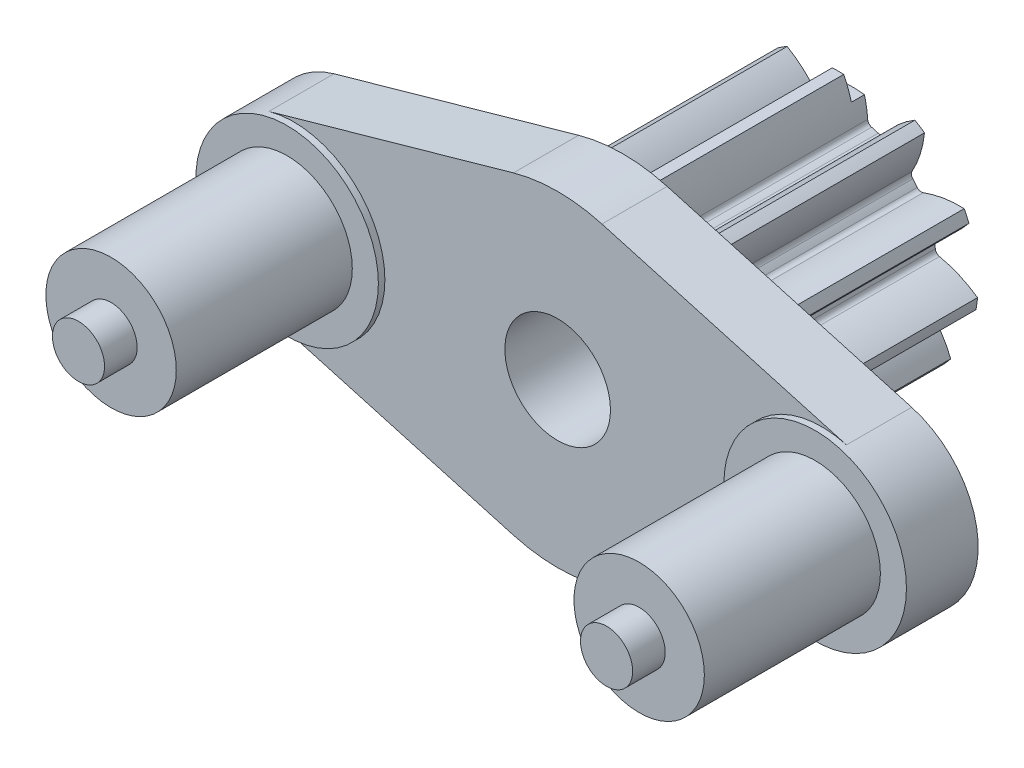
ISO-10303-21;
HEADER;
FILE_DESCRIPTION(('STEP AP214'),'2;1');
FILE_NAME('part.step','',(''),(''),'','','');
FILE_SCHEMA(('AUTOMOTIVE_DESIGN { 1 0 10303 214 1 1 1 1 }'));
ENDSEC;
DATA;
#1=APPLICATION_CONTEXT('core data for automotive mechanical design processes');
#2=APPLICATION_PROTOCOL_DEFINITION('international standard','automotive_design',2000,#1);
#3=PRODUCT_CONTEXT('',#1,'mechanical');
#4=PRODUCT('Part','Part','',(#3));
#5=PRODUCT_RELATED_PRODUCT_CATEGORY('part','',(#4));
#6=PRODUCT_DEFINITION_FORMATION('','',#4);
#7=PRODUCT_DEFINITION_CONTEXT('part definition',#1,'design');
#8=PRODUCT_DEFINITION('design','',#6,#7);
#9=PRODUCT_DEFINITION_SHAPE('','',#8);
#10=(LENGTH_UNIT() NAMED_UNIT(*) SI_UNIT(.MILLI.,.METRE.));
#11=(NAMED_UNIT(*) PLANE_ANGLE_UNIT() SI_UNIT($,.RADIAN.));
#12=(NAMED_UNIT(*) SI_UNIT($,.STERADIAN.) SOLID_ANGLE_UNIT());
#13=UNCERTAINTY_MEASURE_WITH_UNIT(LENGTH_MEASURE(1.E-05),#10,'distance_accuracy_value','');
#14=(GEOMETRIC_REPRESENTATION_CONTEXT(3) GLOBAL_UNCERTAINTY_ASSIGNED_CONTEXT((#13)) GLOBAL_UNIT_ASSIGNED_CONTEXT((#10,
#11,#12)) REPRESENTATION_CONTEXT('',''));
#15=CARTESIAN_POINT('',(0.,0.,0.));
#16=DIRECTION('',(0.,0.,1.));
#17=DIRECTION('',(1.,0.,0.));
#18=AXIS2_PLACEMENT_3D('',#15,#16,#17);
#19=CARTESIAN_POINT('',(0.,0.,17.5));
#20=DIRECTION('',(0.,0.,-1.));
#21=DIRECTION('',(-1.,0.,0.));
#22=AXIS2_PLACEMENT_3D('',#19,#20,#21);
#23=CYLINDRICAL_SURFACE('',#22,9.75);
#24=CARTESIAN_POINT('',(0.,0.,1.));
#25=DIRECTION('',(0.,0.,-1.));
#26=DIRECTION('',(-1.,0.,0.));
#27=AXIS2_PLACEMENT_3D('',#24,#25,#26);
#28=CIRCLE('',#27,9.75);
#29=CARTESIAN_POINT('',(-0.437118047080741,9.74019649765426,1.));
#30=VERTEX_POINT('',#29);
#31=CARTESIAN_POINT('',(0.43835439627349,9.74014093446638,0.999999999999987));
#32=VERTEX_POINT('',#31);
#33=EDGE_CURVE('E49',#30,#32,#28,.T.);
#34=ORIENTED_EDGE('',*,*,#33,.F.);
#35=DIRECTION('',(0.,0.,-1.));
#36=VECTOR('',#35,1.);
#37=CARTESIAN_POINT('',(-0.437118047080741,9.74019649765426,17.5));
#38=LINE('',#37,#36);
#39=CARTESIAN_POINT('',(-0.437118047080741,9.74019649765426,17.5));
#40=VERTEX_POINT('',#39);
#41=EDGE_CURVE('E978',#40,#30,#38,.T.);
#42=ORIENTED_EDGE('',*,*,#41,.F.);
#43=CARTESIAN_POINT('',(0.,0.,17.5));
#44=DIRECTION('',(0.,0.,1.));
#45=DIRECTION('',(1.,0.,0.));
#46=AXIS2_PLACEMENT_3D('',#43,#44,#45);
#47=CIRCLE('',#46,9.75);
#48=CARTESIAN_POINT('',(0.438354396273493,9.74014093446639,17.5));
#49=VERTEX_POINT('',#48);
#50=EDGE_CURVE('E985',#49,#40,#47,.T.);
#51=ORIENTED_EDGE('',*,*,#50,.F.);
#52=DIRECTION('',(0.,0.,-1.));
#53=VECTOR('',#52,1.);
#54=CARTESIAN_POINT('',(0.43835439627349,9.74014093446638,17.5));
#55=LINE('',#54,#53);
#56=EDGE_CURVE('E529',#49,#32,#55,.T.);
#57=ORIENTED_EDGE('',*,*,#56,.T.);
#58=EDGE_LOOP('',(#34,#42,#51,#57));
#59=FACE_BOUND('',#58,.T.);
#60=ADVANCED_FACE('F34',(#59),#23,.T.);
#61=CARTESIAN_POINT('',(-20.25,0.,36.5));
#62=DIRECTION('',(0.,0.,1.));
#63=DIRECTION('',(1.,0.,0.));
#64=AXIS2_PLACEMENT_3D('',#61,#62,#63);
#65=PLANE('',#64);
#66=CARTESIAN_POINT('',(-20.25,0.,36.5));
#67=DIRECTION('',(0.,0.,1.));
#68=DIRECTION('',(1.,0.,0.));
#69=AXIS2_PLACEMENT_3D('',#66,#67,#68);
#70=CIRCLE('',#69,5.);
#71=CARTESIAN_POINT('',(-15.25,0.,36.5));
#72=VERTEX_POINT('',#71);
#73=EDGE_CURVE('E1224',#72,#72,#70,.T.);
#74=ORIENTED_EDGE('',*,*,#73,.T.);
#75=EDGE_LOOP('',(#74));
#76=FACE_BOUND('',#75,.T.);
#77=CARTESIAN_POINT('',(-20.25,0.,36.5));
#78=DIRECTION('',(0.,0.,1.));
#79=DIRECTION('',(1.,0.,0.));
#80=AXIS2_PLACEMENT_3D('',#77,#78,#79);
#81=CIRCLE('',#80,2.);
#82=CARTESIAN_POINT('',(-18.25,0.,36.5));
#83=VERTEX_POINT('',#82);
#84=EDGE_CURVE('E1209',#83,#83,#81,.T.);
#85=ORIENTED_EDGE('',*,*,#84,.F.);
#86=EDGE_LOOP('',(#85));
#87=FACE_BOUND('',#86,.T.);
#88=ADVANCED_FACE('F1254',(#76,#87),#65,.T.);
#89=CARTESIAN_POINT('',(20.25,0.,36.5));
#90=DIRECTION('',(0.,0.,1.));
#91=DIRECTION('',(1.,0.,0.));
#92=AXIS2_PLACEMENT_3D('',#89,#90,#91);
#93=PLANE('',#92);
#94=CARTESIAN_POINT('',(20.25,0.,36.5));
#95=DIRECTION('',(0.,0.,1.));
#96=DIRECTION('',(1.,0.,0.));
#97=AXIS2_PLACEMENT_3D('',#94,#95,#96);
#98=CIRCLE('',#97,5.);
#99=CARTESIAN_POINT('',(25.25,0.,36.5));
#100=VERTEX_POINT('',#99);
#101=EDGE_CURVE('E1230',#100,#100,#98,.T.);
#102=ORIENTED_EDGE('',*,*,#101,.T.);
#103=EDGE_LOOP('',(#102));
#104=FACE_BOUND('',#103,.T.);
#105=CARTESIAN_POINT('',(20.25,0.,36.5));
#106=DIRECTION('',(0.,0.,1.));
#107=DIRECTION('',(1.,0.,0.));
#108=AXIS2_PLACEMENT_3D('',#105,#106,#107);
#109=CIRCLE('',#108,2.);
#110=CARTESIAN_POINT('',(22.25,0.,36.5));
#111=VERTEX_POINT('',#110);
#112=EDGE_CURVE('E1215',#111,#111,#109,.T.);
#113=ORIENTED_EDGE('',*,*,#112,.F.);
#114=EDGE_LOOP('',(#113));
#115=FACE_BOUND('',#114,.T.);
#116=ADVANCED_FACE('F1258',(#104,#115),#93,.T.);
#117=CARTESIAN_POINT('',(-20.25,0.,23.));
#118=DIRECTION('',(0.,0.,1.));
#119=DIRECTION('',(1.,0.,0.));
#120=AXIS2_PLACEMENT_3D('',#117,#118,#119);
#121=PLANE('',#120);
#122=CARTESIAN_POINT('',(-20.25,0.,23.));
#123=DIRECTION('',(0.,0.,1.));
#124=DIRECTION('',(1.,0.,0.));
#125=AXIS2_PLACEMENT_3D('',#122,#123,#124);
#126=CIRCLE('',#125,7.);
#127=CARTESIAN_POINT('',(-13.25,0.,23.));
#128=VERTEX_POINT('',#127);
#129=EDGE_CURVE('E1001',#128,#128,#126,.T.);
#130=ORIENTED_EDGE('',*,*,#129,.T.);
#131=EDGE_LOOP('',(#130));
#132=FACE_BOUND('',#131,.T.);
#133=CARTESIAN_POINT('',(-20.25,0.,23.));
#134=DIRECTION('',(0.,0.,1.));
#135=DIRECTION('',(1.,0.,0.));
#136=AXIS2_PLACEMENT_3D('',#133,#134,#135);
#137=CIRCLE('',#136,5.);
#138=CARTESIAN_POINT('',(-15.25,0.,23.));
#139=VERTEX_POINT('',#138);
#140=EDGE_CURVE('E1221',#139,#139,#137,.T.);
#141=ORIENTED_EDGE('',*,*,#140,.F.);
#142=EDGE_LOOP('',(#141));
#143=FACE_BOUND('',#142,.T.);
#144=ADVANCED_FACE('F1235',(#132,#143),#121,.T.);
#145=CARTESIAN_POINT('',(20.25,0.,23.));
#146=DIRECTION('',(0.,0.,1.));
#147=DIRECTION('',(1.,0.,0.));
#148=AXIS2_PLACEMENT_3D('',#145,#146,#147);
#149=PLANE('',#148);
#150=CARTESIAN_POINT('',(20.25,0.,23.));
#151=DIRECTION('',(0.,0.,1.));
#152=DIRECTION('',(1.,0.,0.));
#153=AXIS2_PLACEMENT_3D('',#150,#151,#152);
#154=CIRCLE('',#153,7.);
#155=CARTESIAN_POINT('',(27.25,0.,23.));
#156=VERTEX_POINT('',#155);
#157=EDGE_CURVE('E1000',#156,#156,#154,.T.);
#158=ORIENTED_EDGE('',*,*,#157,.T.);
#159=EDGE_LOOP('',(#158));
#160=FACE_BOUND('',#159,.T.);
#161=CARTESIAN_POINT('',(20.25,0.,23.));
#162=DIRECTION('',(0.,0.,1.));
#163=DIRECTION('',(1.,0.,0.));
#164=AXIS2_PLACEMENT_3D('',#161,#162,#163);
#165=CIRCLE('',#164,5.);
#166=CARTESIAN_POINT('',(25.25,0.,23.));
#167=VERTEX_POINT('',#166);
#168=EDGE_CURVE('E1227',#167,#167,#165,.T.);
#169=ORIENTED_EDGE('',*,*,#168,.F.);
#170=EDGE_LOOP('',(#169));
#171=FACE_BOUND('',#170,.T.);
#172=ADVANCED_FACE('F1333',(#160,#171),#149,.T.);
#173=CARTESIAN_POINT('',(0.,0.,22.5));
#174=DIRECTION('',(0.,0.,1.));
#175=DIRECTION('',(1.,0.,0.));
#176=AXIS2_PLACEMENT_3D('',#173,#174,#175);
#177=PLANE('',#176);
#178=CARTESIAN_POINT('',(0.,0.,22.5));
#179=DIRECTION('',(0.,0.,1.));
#180=DIRECTION('',(1.,0.,0.));
#181=AXIS2_PLACEMENT_3D('',#178,#179,#180);
#182=CIRCLE('',#181,4.05);
#183=CARTESIAN_POINT('',(4.05,0.,22.5));
#184=VERTEX_POINT('',#183);
#185=EDGE_CURVE('E1183',#184,#184,#182,.T.);
#186=ORIENTED_EDGE('',*,*,#185,.F.);
#187=EDGE_LOOP('',(#186));
#188=FACE_BOUND('',#187,.T.);
#189=DIRECTION('',(-0.962408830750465,-0.271604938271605,0.));
#190=VECTOR('',#189,1.);
#191=CARTESIAN_POINT('',(-22.1512345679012,6.73686181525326,22.5));
#192=LINE('',#191,#190);
#193=CARTESIAN_POINT('',(-3.39506172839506,12.0301103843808,22.5));
#194=VERTEX_POINT('',#193);
#195=CARTESIAN_POINT('',(-22.1512345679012,6.73686181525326,22.5));
#196=VERTEX_POINT('',#195);
#197=EDGE_CURVE('E1026',#194,#196,#192,.T.);
#198=ORIENTED_EDGE('',*,*,#197,.T.);
#199=CARTESIAN_POINT('',(-20.25,0.,22.5));
#200=DIRECTION('',(0.,0.,1.));
#201=DIRECTION('',(1.,0.,0.));
#202=AXIS2_PLACEMENT_3D('',#199,#200,#201);
#203=CIRCLE('',#202,7.);
#204=CARTESIAN_POINT('',(-22.1512345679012,-6.73686181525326,22.5));
#205=VERTEX_POINT('',#204);
#206=EDGE_CURVE('E989',#196,#205,#203,.F.);
#207=ORIENTED_EDGE('',*,*,#206,.T.);
#208=DIRECTION('',(0.962408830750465,-0.271604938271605,0.));
#209=VECTOR('',#208,1.);
#210=CARTESIAN_POINT('',(-22.1512345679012,-6.73686181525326,22.5));
#211=LINE('',#210,#209);
#212=CARTESIAN_POINT('',(-3.39506172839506,-12.0301103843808,22.5));
#213=VERTEX_POINT('',#212);
#214=EDGE_CURVE('E1029',#205,#213,#211,.T.);
#215=ORIENTED_EDGE('',*,*,#214,.T.);
#216=CARTESIAN_POINT('',(0.,0.,22.5));
#217=DIRECTION('',(0.,0.,1.));
#218=DIRECTION('',(1.,0.,0.));
#219=AXIS2_PLACEMENT_3D('',#216,#217,#218);
#220=CIRCLE('',#219,12.5);
#221=CARTESIAN_POINT('',(3.39506172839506,-12.0301103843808,22.5));
#222=VERTEX_POINT('',#221);
#223=EDGE_CURVE('E1020',#213,#222,#220,.T.);
#224=ORIENTED_EDGE('',*,*,#223,.T.);
#225=DIRECTION('',(0.962408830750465,0.271604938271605,0.));
#226=VECTOR('',#225,1.);
#227=CARTESIAN_POINT('',(22.1512345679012,-6.73686181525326,22.5));
#228=LINE('',#227,#226);
#229=CARTESIAN_POINT('',(22.1512345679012,-6.73686181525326,22.5));
#230=VERTEX_POINT('',#229);
#231=EDGE_CURVE('E1023',#222,#230,#228,.T.);
#232=ORIENTED_EDGE('',*,*,#231,.T.);
#233=CARTESIAN_POINT('',(20.25,0.,22.5));
#234=DIRECTION('',(0.,0.,1.));
#235=DIRECTION('',(1.,0.,0.));
#236=AXIS2_PLACEMENT_3D('',#233,#234,#235);
#237=CIRCLE('',#236,7.);
#238=CARTESIAN_POINT('',(22.1512345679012,6.73686181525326,22.5));
#239=VERTEX_POINT('',#238);
#240=EDGE_CURVE('E996',#239,#230,#237,.T.);
#241=ORIENTED_EDGE('',*,*,#240,.F.);
#242=DIRECTION('',(-0.962408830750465,0.271604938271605,0.));
#243=VECTOR('',#242,1.);
#244=CARTESIAN_POINT('',(22.1512345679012,6.73686181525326,22.5));
#245=LINE('',#244,#243);
#246=CARTESIAN_POINT('',(3.39506172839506,12.0301103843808,22.5));
#247=VERTEX_POINT('',#246);
#248=EDGE_CURVE('E993',#239,#247,#245,.T.);
#249=ORIENTED_EDGE('',*,*,#248,.T.);
#250=CARTESIAN_POINT('',(0.,0.,22.5));
#251=DIRECTION('',(0.,0.,1.));
#252=DIRECTION('',(1.,0.,0.));
#253=AXIS2_PLACEMENT_3D('',#250,#251,#252);
#254=CIRCLE('',#253,12.5);
#255=EDGE_CURVE('E1024',#247,#194,#254,.T.);
#256=ORIENTED_EDGE('',*,*,#255,.T.);
#257=EDGE_LOOP('',(#198,#207,#215,#224,#232,#241,#249,#256));
#258=FACE_BOUND('',#257,.T.);
#259=ADVANCED_FACE('F1262',(#188,#258),#177,.T.);
#260=DIRECTION('',(0.,0.,-1.));
#261=VECTOR('',#260,1.);
#262=CARTESIAN_POINT('',(4.8982206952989,8.43029857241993,17.5));
#263=LINE('',#262,#261);
#264=CARTESIAN_POINT('',(4.8982206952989,8.43029857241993,17.5));
#265=VERTEX_POINT('',#264);
#266=CARTESIAN_POINT('',(4.8982206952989,8.43029857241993,0.));
#267=VERTEX_POINT('',#266);
#268=EDGE_CURVE('E530',#265,#267,#263,.T.);
#269=ORIENTED_EDGE('',*,*,#268,.F.);
#270=CARTESIAN_POINT('',(5.6346849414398,7.95693569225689,17.5));
#271=VERTEX_POINT('',#270);
#272=EDGE_CURVE('E1088',#271,#265,#47,.T.);
#273=ORIENTED_EDGE('',*,*,#272,.F.);
#274=DIRECTION('',(0.,0.,-1.));
#275=VECTOR('',#274,1.);
#276=CARTESIAN_POINT('',(5.6346849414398,7.95693569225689,17.5));
#277=LINE('',#276,#275);
#278=CARTESIAN_POINT('',(5.6346849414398,7.95693569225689,0.));
#279=VERTEX_POINT('',#278);
#280=EDGE_CURVE('E582',#271,#279,#277,.T.);
#281=ORIENTED_EDGE('',*,*,#280,.T.);
#282=CARTESIAN_POINT('',(0.,0.,0.));
#283=DIRECTION('',(0.,0.,1.));
#284=DIRECTION('',(1.,0.,0.));
#285=AXIS2_PLACEMENT_3D('',#282,#283,#284);
#286=CIRCLE('',#285,9.75);
#287=EDGE_CURVE('E981',#279,#267,#286,.T.);
#288=ORIENTED_EDGE('',*,*,#287,.T.);
#289=EDGE_LOOP('',(#269,#273,#281,#288));
#290=FACE_BOUND('',#289,.T.);
#291=ADVANCED_FACE('F1087',(#290),#23,.T.);
#292=CARTESIAN_POINT('',(0.,0.,0.));
#293=DIRECTION('',(0.,0.,1.));
#294=DIRECTION('',(1.,0.,0.));
#295=AXIS2_PLACEMENT_3D('',#292,#293,#294);
#296=PLANE('',#295);
#297=CARTESIAN_POINT('',(0.,0.,0.));
#298=DIRECTION('',(0.,0.,1.));
#299=DIRECTION('',(1.,0.,0.));
#300=AXIS2_PLACEMENT_3D('',#297,#298,#299);
#301=CIRCLE('',#300,4.05);
#302=CARTESIAN_POINT('',(4.05,0.,0.));
#303=VERTEX_POINT('',#302);
#304=EDGE_CURVE('E1186',#303,#303,#301,.T.);
#305=ORIENTED_EDGE('',*,*,#304,.T.);
#306=EDGE_LOOP('',(#305));
#307=FACE_BOUND('',#306,.T.);
#308=CARTESIAN_POINT('',(6.70747784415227,6.14092580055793,0.));
#309=DIRECTION('',(0.,0.,-1.));
#310=DIRECTION('',(1.,0.,0.));
#311=AXIS2_PLACEMENT_3D('',#308,#309,#310);
#312=CIRCLE('',#311,7.99999999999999);
#313=CARTESIAN_POINT('',(-1.27517638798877,6.66745349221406,0.));
#314=VERTEX_POINT('',#313);
#315=CARTESIAN_POINT('',(-1.02674790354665,8.18585907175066,0.));
#316=VERTEX_POINT('',#315);
#317=EDGE_CURVE('E522',#314,#316,#312,.T.);
#318=ORIENTED_EDGE('',*,*,#317,.T.);
#319=CARTESIAN_POINT('',(0.,0.,0.));
#320=DIRECTION('',(0.,0.,1.));
#321=DIRECTION('',(-1.,0.,0.));
#322=AXIS2_PLACEMENT_3D('',#319,#320,#321);
#323=CIRCLE('',#322,8.25);
#324=CARTESIAN_POINT('',(1.02778695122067,8.18572867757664,0.));
#325=VERTEX_POINT('',#324);
#326=EDGE_CURVE('E509',#325,#316,#323,.T.);
#327=ORIENTED_EDGE('',*,*,#326,.F.);
#328=CARTESIAN_POINT('',(-6.70669830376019,6.14177715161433,0.));
#329=DIRECTION('',(0.,0.,-1.));
#330=DIRECTION('',(-0.841253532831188,0.540640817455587,0.));
#331=AXIS2_PLACEMENT_3D('',#328,#329,#330);
#332=CIRCLE('',#331,8.);
#333=CARTESIAN_POINT('',(1.27602269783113,6.66729157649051,0.));
#334=VERTEX_POINT('',#333);
#335=EDGE_CURVE('E519',#325,#334,#332,.T.);
#336=ORIENTED_EDGE('',*,*,#335,.T.);
#337=CARTESIAN_POINT('',(1.67515874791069,6.69356729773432,0.));
#338=DIRECTION('',(0.,0.,1.));
#339=DIRECTION('',(0.841253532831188,-0.540640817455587,0.));
#340=AXIS2_PLACEMENT_3D('',#337,#338,#339);
#341=CIRCLE('',#340,0.399999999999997);
#342=CARTESIAN_POINT('',(1.5780480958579,6.30553441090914,0.));
#343=VERTEX_POINT('',#342);
#344=EDGE_CURVE('E533',#334,#343,#341,.T.);
#345=ORIENTED_EDGE('',*,*,#344,.T.);
#346=CARTESIAN_POINT('',(0.,0.,0.));
#347=DIRECTION('',(0.,0.,-1.));
#348=DIRECTION('',(0.841253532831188,-0.540640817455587,0.));
#349=AXIS2_PLACEMENT_3D('',#346,#347,#348);
#350=CIRCLE('',#349,6.5);
#351=CARTESIAN_POINT('',(2.08227234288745,6.15744605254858,0.));
#352=VERTEX_POINT('',#351);
#353=EDGE_CURVE('E1051',#343,#352,#350,.T.);
#354=ORIENTED_EDGE('',*,*,#353,.T.);
#355=CARTESIAN_POINT('',(2.21041217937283,6.53636580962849,0.));
#356=DIRECTION('',(0.,0.,1.));
#357=DIRECTION('',(-0.841253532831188,0.540640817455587,0.));
#358=AXIS2_PLACEMENT_3D('',#355,#356,#357);
#359=CIRCLE('',#358,0.399999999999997);
#360=CARTESIAN_POINT('',(2.53195086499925,6.29843121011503,0.));
#361=VERTEX_POINT('',#360);
#362=EDGE_CURVE('E1054',#352,#361,#359,.T.);
#363=ORIENTED_EDGE('',*,*,#362,.T.);
#364=CARTESIAN_POINT('',(8.96272457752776,1.53973921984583,0.));
#365=DIRECTION('',(0.,0.,-1.));
#366=DIRECTION('',(0.841253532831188,-0.540640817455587,0.));
#367=AXIS2_PLACEMENT_3D('',#364,#365,#366);
#368=CIRCLE('',#367,7.99999999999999);
#369=EDGE_CURVE('E57',#361,#267,#368,.T.);
#370=ORIENTED_EDGE('',*,*,#369,.T.);
#371=ORIENTED_EDGE('',*,*,#287,.F.);
#372=CARTESIAN_POINT('',(-2.32153822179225,8.79270658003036,0.));
#373=DIRECTION('',(0.,0.,-1.));
#374=DIRECTION('',(-0.415415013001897,0.909631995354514,0.));
#375=AXIS2_PLACEMENT_3D('',#372,#373,#374);
#376=CIRCLE('',#375,8.);
#377=CARTESIAN_POINT('',(4.67806857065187,4.91901263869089,0.));
#378=VERTEX_POINT('',#377);
#379=EDGE_CURVE('E545',#279,#378,#376,.T.);
#380=ORIENTED_EDGE('',*,*,#379,.T.);
#381=CARTESIAN_POINT('',(5.02804891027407,4.72532794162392,0.));
#382=DIRECTION('',(0.,0.,1.));
#383=DIRECTION('',(0.415415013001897,-0.909631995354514,0.));
#384=AXIS2_PLACEMENT_3D('',#381,#382,#383);
#385=CIRCLE('',#384,0.399999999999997);
#386=CARTESIAN_POINT('',(4.7365678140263,4.45139588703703,0.));
#387=VERTEX_POINT('',#386);
#388=EDGE_CURVE('E549',#378,#387,#385,.T.);
#389=ORIENTED_EDGE('',*,*,#388,.T.);
#390=CARTESIAN_POINT('',(0.,0.,0.));
#391=DIRECTION('',(0.,0.,-1.));
#392=DIRECTION('',(0.415415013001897,-0.909631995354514,0.));
#393=AXIS2_PLACEMENT_3D('',#390,#391,#392);
#394=CIRCLE('',#393,6.5);
#395=CARTESIAN_POINT('',(5.08068563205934,4.05421182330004,0.));
#396=VERTEX_POINT('',#395);
#397=EDGE_CURVE('E552',#387,#396,#394,.T.);
#398=ORIENTED_EDGE('',*,*,#397,.T.);
#399=CARTESIAN_POINT('',(5.39334320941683,4.30370178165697,0.));
#400=DIRECTION('',(0.,0.,1.));
#401=DIRECTION('',(-0.415415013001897,0.909631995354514,0.));
#402=AXIS2_PLACEMENT_3D('',#399,#400,#401);
#403=CIRCLE('',#402,0.399999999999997);
#404=CARTESIAN_POINT('',(5.53520160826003,3.92970152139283,0.));
#405=VERTEX_POINT('',#404);
#406=EDGE_CURVE('E555',#396,#405,#403,.T.);
#407=ORIENTED_EDGE('',*,*,#406,.T.);
#408=CARTESIAN_POINT('',(8.37236958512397,-3.55030368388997,0.));
#409=DIRECTION('',(0.,0.,-1.));
#410=DIRECTION('',(0.415415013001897,-0.909631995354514,0.));
#411=AXIS2_PLACEMENT_3D('',#408,#409,#410);
#412=CIRCLE('',#411,7.99999999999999);
#413=CARTESIAN_POINT('',(8.67840897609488,4.44384041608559,0.));
#414=VERTEX_POINT('',#413);
#415=EDGE_CURVE('E542',#405,#414,#412,.T.);
#416=ORIENTED_EDGE('',*,*,#415,.T.);
#417=CARTESIAN_POINT('',(9.04204283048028,3.64745958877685,0.));
#418=VERTEX_POINT('',#417);
#419=EDGE_CURVE('E1091',#418,#414,#286,.T.);
#420=ORIENTED_EDGE('',*,*,#419,.F.);
#421=CARTESIAN_POINT('',(2.80069384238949,8.65201379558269,0.));
#422=DIRECTION('',(0.,0.,-1.));
#423=DIRECTION('',(0.142314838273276,0.989821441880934,0.));
#424=AXIS2_PLACEMENT_3D('',#421,#422,#423);
#425=CIRCLE('',#424,8.);
#426=CARTESIAN_POINT('',(6.59486072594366,1.60898194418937,0.));
#427=VERTEX_POINT('',#426);
#428=EDGE_CURVE('E590',#418,#427,#425,.T.);
#429=ORIENTED_EDGE('',*,*,#428,.T.);
#430=CARTESIAN_POINT('',(6.78456907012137,1.25683035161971,0.));
#431=DIRECTION('',(0.,0.,1.));
#432=DIRECTION('',(-0.142314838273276,-0.989821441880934,0.));
#433=AXIS2_PLACEMENT_3D('',#430,#431,#432);
#434=CIRCLE('',#433,0.399999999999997);
#435=CARTESIAN_POINT('',(6.39126071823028,1.18397062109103,0.));
#436=VERTEX_POINT('',#435);
#437=EDGE_CURVE('E593',#427,#436,#434,.T.);
#438=ORIENTED_EDGE('',*,*,#437,.T.);
#439=CARTESIAN_POINT('',(0.,0.,0.));
#440=DIRECTION('',(0.,0.,-1.));
#441=DIRECTION('',(-0.142314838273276,-0.989821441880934,0.));
#442=AXIS2_PLACEMENT_3D('',#439,#440,#441);
#443=CIRCLE('',#442,6.5);
#444=CARTESIAN_POINT('',(6.46601713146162,0.663793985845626,0.));
#445=VERTEX_POINT('',#444);
#446=EDGE_CURVE('E596',#436,#445,#443,.T.);
#447=ORIENTED_EDGE('',*,*,#446,.T.);
#448=CARTESIAN_POINT('',(6.86392587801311,0.704642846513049,0.));
#449=DIRECTION('',(0.,0.,1.));
#450=DIRECTION('',(0.142314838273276,0.989821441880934,0.));
#451=AXIS2_PLACEMENT_3D('',#448,#449,#450);
#452=CIRCLE('',#451,0.399999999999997);
#453=CARTESIAN_POINT('',(6.78106495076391,0.313319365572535,0.));
#454=VERTEX_POINT('',#453);
#455=EDGE_CURVE('E599',#445,#454,#452,.T.);
#456=ORIENTED_EDGE('',*,*,#455,.T.);
#457=CARTESIAN_POINT('',(5.12384640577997,-7.5131502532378,0.));
#458=DIRECTION('',(0.,0.,-1.));
#459=DIRECTION('',(-0.142314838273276,-0.989821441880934,0.));
#460=AXIS2_PLACEMENT_3D('',#457,#458,#459);
#461=CIRCLE('',#460,7.99999999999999);
#462=CARTESIAN_POINT('',(9.70326372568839,-0.953505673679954,0.));
#463=VERTEX_POINT('',#462);
#464=EDGE_CURVE('E587',#454,#463,#461,.T.);
#465=ORIENTED_EDGE('',*,*,#464,.T.);
#466=CARTESIAN_POINT('',(9.57861600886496,-1.8200591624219,0.));
#467=VERTEX_POINT('',#466);
#468=EDGE_CURVE('E1093',#467,#463,#286,.T.);
#469=ORIENTED_EDGE('',*,*,#468,.F.);
#470=CARTESIAN_POINT('',(7.03372540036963,5.76436776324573,0.));
#471=DIRECTION('',(0.,0.,-1.));
#472=DIRECTION('',(0.654860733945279,0.755749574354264,0.));
#473=AXIS2_PLACEMENT_3D('',#470,#471,#472);
#474=CIRCLE('',#473,8.);
#475=CARTESIAN_POINT('',(6.41783119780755,-2.21188914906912,0.));
#476=VERTEX_POINT('',#475);
#477=EDGE_CURVE('E634',#467,#476,#474,.T.);
#478=ORIENTED_EDGE('',*,*,#477,.T.);
#479=CARTESIAN_POINT('',(6.38703648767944,-2.61070199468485,0.));
#480=DIRECTION('',(0.,0.,1.));
#481=DIRECTION('',(-0.654860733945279,-0.755749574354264,0.));
#482=AXIS2_PLACEMENT_3D('',#479,#480,#481);
#483=CIRCLE('',#482,0.399999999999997);
#484=CARTESIAN_POINT('',(6.01677350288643,-2.45935695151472,0.));
#485=VERTEX_POINT('',#484);
#486=EDGE_CURVE('E639',#476,#485,#483,.T.);
#487=ORIENTED_EDGE('',*,*,#486,.T.);
#488=CARTESIAN_POINT('',(0.,0.,0.));
#489=DIRECTION('',(0.,0.,-1.));
#490=DIRECTION('',(-0.654860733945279,-0.755749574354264,0.));
#491=AXIS2_PLACEMENT_3D('',#488,#489,#490);
#492=CIRCLE('',#491,6.5);
#493=CARTESIAN_POINT('',(5.79843387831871,-2.93737375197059,0.));
#494=VERTEX_POINT('',#493);
#495=EDGE_CURVE('E642',#485,#494,#492,.T.);
#496=ORIENTED_EDGE('',*,*,#495,.T.);
#497=CARTESIAN_POINT('',(6.15526057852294,-3.11813521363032,0.));
#498=DIRECTION('',(0.,0.,1.));
#499=DIRECTION('',(0.654860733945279,0.755749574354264,0.));
#500=AXIS2_PLACEMENT_3D('',#497,#498,#499);
#501=CIRCLE('',#500,0.399999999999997);
#502=CARTESIAN_POINT('',(5.87398808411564,-3.40253947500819,0.));
#503=VERTEX_POINT('',#502);
#504=EDGE_CURVE('E645',#494,#503,#501,.T.);
#505=ORIENTED_EDGE('',*,*,#504,.T.);
#506=CARTESIAN_POINT('',(0.248538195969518,-9.09062470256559,0.));
#507=DIRECTION('',(0.,0.,-1.));
#508=DIRECTION('',(-0.654860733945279,-0.755749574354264,0.));
#509=AXIS2_PLACEMENT_3D('',#506,#507,#508);
#510=CIRCLE('',#509,7.99999999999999);
#511=CARTESIAN_POINT('',(7.64740080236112,-6.04812044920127,0.));
#512=VERTEX_POINT('',#511);
#513=EDGE_CURVE('E631',#503,#512,#510,.T.);
#514=ORIENTED_EDGE('',*,*,#513,.T.);
#515=CARTESIAN_POINT('',(7.07404628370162,-6.70972198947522,0.));
#516=VERTEX_POINT('',#515);
#517=EDGE_CURVE('E1098',#516,#512,#286,.T.);
#518=ORIENTED_EDGE('',*,*,#517,.F.);
#519=CARTESIAN_POINT('',(9.03359884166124,1.0465756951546,0.));
#520=DIRECTION('',(0.,0.,-1.));
#521=DIRECTION('',(0.959492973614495,0.281732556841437,0.));
#522=AXIS2_PLACEMENT_3D('',#519,#520,#521);
#523=CIRCLE('',#522,8.);
#524=CARTESIAN_POINT('',(4.20318561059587,-5.33050106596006,0.));
#525=VERTEX_POINT('',#524);
#526=EDGE_CURVE('E678',#516,#525,#523,.T.);
#527=ORIENTED_EDGE('',*,*,#526,.T.);
#528=CARTESIAN_POINT('',(3.96166494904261,-5.64935490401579,0.));
#529=DIRECTION('',(0.,0.,1.));
#530=DIRECTION('',(-0.959492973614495,-0.281732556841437,0.));
#531=AXIS2_PLACEMENT_3D('',#528,#529,#530);
#532=CIRCLE('',#531,0.399999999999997);
#533=CARTESIAN_POINT('',(3.73200321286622,-5.32185606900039,0.));
#534=VERTEX_POINT('',#533);
#535=EDGE_CURVE('E681',#525,#534,#532,.T.);
#536=ORIENTED_EDGE('',*,*,#535,.T.);
#537=CARTESIAN_POINT('',(0.,0.,0.));
#538=DIRECTION('',(0.,0.,-1.));
#539=DIRECTION('',(-0.959492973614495,-0.281732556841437,0.));
#540=AXIS2_PLACEMENT_3D('',#537,#538,#539);
#541=CIRCLE('',#540,6.5);
#542=CARTESIAN_POINT('',(3.28988883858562,-5.60594607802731,0.));
#543=VERTEX_POINT('',#542);
#544=EDGE_CURVE('E684',#534,#543,#541,.T.);
#545=ORIENTED_EDGE('',*,*,#544,.T.);
#546=CARTESIAN_POINT('',(3.49234353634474,-5.95092737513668,0.));
#547=DIRECTION('',(0.,0.,1.));
#548=DIRECTION('',(0.959492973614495,0.281732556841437,0.));
#549=AXIS2_PLACEMENT_3D('',#546,#547,#548);
#550=CIRCLE('',#549,0.399999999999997);
#551=CARTESIAN_POINT('',(3.10196150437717,-6.03811607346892,0.));
#552=VERTEX_POINT('',#551);
#553=EDGE_CURVE('E687',#543,#552,#550,.T.);
#554=ORIENTED_EDGE('',*,*,#553,.T.);
#555=CARTESIAN_POINT('',(-4.70567913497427,-7.7818900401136,0.));
#556=DIRECTION('',(0.,0.,-1.));
#557=DIRECTION('',(-0.959492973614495,-0.281732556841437,0.));
#558=AXIS2_PLACEMENT_3D('',#555,#556,#557);
#559=CIRCLE('',#558,7.99999999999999);
#560=CARTESIAN_POINT('',(3.1635421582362,-9.22249971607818,0.));
#561=VERTEX_POINT('',#560);
#562=EDGE_CURVE('E654',#552,#561,#559,.T.);
#563=ORIENTED_EDGE('',*,*,#562,.T.);
#564=CARTESIAN_POINT('',(2.32351684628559,-9.46909549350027,0.));
#565=VERTEX_POINT('',#564);
#566=EDGE_CURVE('E1103',#565,#561,#286,.T.);
#567=ORIENTED_EDGE('',*,*,#566,.F.);
#568=CARTESIAN_POINT('',(8.16536847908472,-4.00349676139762,0.));
#569=DIRECTION('',(0.,0.,-1.));
#570=DIRECTION('',(0.959492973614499,-0.281732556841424,0.));
#571=AXIS2_PLACEMENT_3D('',#568,#569,#570);
#572=CIRCLE('',#571,8.);
#573=CARTESIAN_POINT('',(0.654058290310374,-6.75671655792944,0.));
#574=VERTEX_POINT('',#573);
#575=EDGE_CURVE('E722',#565,#574,#572,.T.);
#576=ORIENTED_EDGE('',*,*,#575,.T.);
#577=CARTESIAN_POINT('',(0.278492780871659,-6.89437754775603,0.));
#578=DIRECTION('',(0.,0.,1.));
#579=DIRECTION('',(-0.959492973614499,0.281732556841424,0.));
#580=AXIS2_PLACEMENT_3D('',#577,#578,#579);
#581=CIRCLE('',#580,0.399999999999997);
#582=CARTESIAN_POINT('',(0.262348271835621,-6.49470348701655,0.));
#583=VERTEX_POINT('',#582);
#584=EDGE_CURVE('E725',#574,#583,#581,.T.);
#585=ORIENTED_EDGE('',*,*,#584,.T.);
#586=CARTESIAN_POINT('',(0.,0.,0.));
#587=DIRECTION('',(0.,0.,-1.));
#588=DIRECTION('',(-0.959492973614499,0.281732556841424,0.));
#589=AXIS2_PLACEMENT_3D('',#586,#587,#588);
#590=CIRCLE('',#589,6.5);
#591=CARTESIAN_POINT('',(-0.263172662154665,-6.49467013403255,0.));
#592=VERTEX_POINT('',#591);
#593=EDGE_CURVE('E728',#583,#592,#590,.T.);
#594=ORIENTED_EDGE('',*,*,#593,.T.);
#595=CARTESIAN_POINT('',(-0.279367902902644,-6.89434214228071,0.));
#596=DIRECTION('',(0.,0.,1.));
#597=DIRECTION('',(0.959492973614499,-0.281732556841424,0.));
#598=AXIS2_PLACEMENT_3D('',#595,#596,#597);
#599=CIRCLE('',#598,0.399999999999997);
#600=CARTESIAN_POINT('',(-0.654915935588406,-6.75663348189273,0.));
#601=VERTEX_POINT('',#600);
#602=EDGE_CURVE('E731',#592,#601,#599,.T.);
#603=ORIENTED_EDGE('',*,*,#602,.T.);
#604=CARTESIAN_POINT('',(-8.16587658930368,-4.0024602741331,0.));
#605=DIRECTION('',(0.,0.,-1.));
#606=DIRECTION('',(-0.959492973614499,0.281732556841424,0.));
#607=AXIS2_PLACEMENT_3D('',#604,#605,#606);
#608=CIRCLE('',#607,7.99999999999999);
#609=CARTESIAN_POINT('',(-2.32471876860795,-9.4688004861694,0.));
#610=VERTEX_POINT('',#609);
#611=EDGE_CURVE('E719',#601,#610,#608,.T.);
#612=ORIENTED_EDGE('',*,*,#611,.T.);
#613=CARTESIAN_POINT('',(-3.1647127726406,-9.2220980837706,0.));
#614=VERTEX_POINT('',#613);
#615=EDGE_CURVE('E1108',#614,#610,#286,.T.);
#616=ORIENTED_EDGE('',*,*,#615,.F.);
#617=CARTESIAN_POINT('',(4.70469131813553,-7.78248728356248,0.));
#618=DIRECTION('',(0.,0.,-1.));
#619=DIRECTION('',(0.654860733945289,-0.755749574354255,0.));
#620=AXIS2_PLACEMENT_3D('',#617,#618,#619);
#621=CIRCLE('',#620,8.);
#622=CARTESIAN_POINT('',(-3.10272791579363,-6.03772228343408,0.));
#623=VERTEX_POINT('',#622);
#624=EDGE_CURVE('E766',#614,#623,#621,.T.);
#625=ORIENTED_EDGE('',*,*,#624,.T.);
#626=CARTESIAN_POINT('',(-3.49309887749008,-5.95048403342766,0.));
#627=DIRECTION('',(0.,0.,1.));
#628=DIRECTION('',(-0.654860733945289,0.755749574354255,0.));
#629=AXIS2_PLACEMENT_3D('',#626,#627,#628);
#630=CIRCLE('',#629,0.399999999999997);
#631=CARTESIAN_POINT('',(-3.29060039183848,-5.60552843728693,0.));
#632=VERTEX_POINT('',#631);
#633=EDGE_CURVE('E771',#623,#632,#630,.T.);
#634=ORIENTED_EDGE('',*,*,#633,.T.);
#635=CARTESIAN_POINT('',(0.,0.,0.));
#636=DIRECTION('',(0.,0.,-1.));
#637=DIRECTION('',(-0.654860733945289,0.755749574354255,0.));
#638=AXIS2_PLACEMENT_3D('',#635,#636,#637);
#639=CIRCLE('',#638,6.5);
#640=CARTESIAN_POINT('',(-3.73267870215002,-5.32138231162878,0.));
#641=VERTEX_POINT('',#640);
#642=EDGE_CURVE('E774',#632,#641,#639,.T.);
#643=ORIENTED_EDGE('',*,*,#642,.T.);
#644=CARTESIAN_POINT('',(-3.96238200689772,-5.64885199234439,0.));
#645=DIRECTION('',(0.,0.,1.));
#646=DIRECTION('',(0.654860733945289,-0.755749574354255,0.));
#647=AXIS2_PLACEMENT_3D('',#644,#645,#646);
#648=CIRCLE('',#647,0.399999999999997);
#649=CARTESIAN_POINT('',(-4.20386219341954,-5.32996749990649,0.));
#650=VERTEX_POINT('',#649);
#651=EDGE_CURVE('E777',#641,#650,#648,.T.);
#652=ORIENTED_EDGE('',*,*,#651,.T.);
#653=CARTESIAN_POINT('',(-9.03346592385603,1.04772234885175,0.));
#654=DIRECTION('',(0.,0.,-1.));
#655=DIRECTION('',(-0.654860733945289,0.755749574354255,0.));
#656=AXIS2_PLACEMENT_3D('',#653,#654,#655);
#657=CIRCLE('',#656,7.99999999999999);
#658=CARTESIAN_POINT('',(-7.07489791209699,-6.70882400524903,0.));
#659=VERTEX_POINT('',#658);
#660=EDGE_CURVE('E763',#650,#659,#657,.T.);
#661=ORIENTED_EDGE('',*,*,#660,.T.);
#662=CARTESIAN_POINT('',(-7.64816844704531,-6.04714969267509,0.));
#663=VERTEX_POINT('',#662);
#664=EDGE_CURVE('E1113',#663,#659,#286,.T.);
#665=ORIENTED_EDGE('',*,*,#664,.F.);
#666=CARTESIAN_POINT('',(-0.249692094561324,-9.09059308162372,0.));
#667=DIRECTION('',(0.,0.,-1.));
#668=DIRECTION('',(0.142314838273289,-0.989821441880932,0.));
#669=AXIS2_PLACEMENT_3D('',#666,#667,#668);
#670=CIRCLE('',#669,8.);
#671=CARTESIAN_POINT('',(-5.874419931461,-3.40179384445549,0.));
#672=VERTEX_POINT('',#671);
#673=EDGE_CURVE('E810',#663,#672,#670,.T.);
#674=ORIENTED_EDGE('',*,*,#673,.T.);
#675=CARTESIAN_POINT('',(-6.15565632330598,-3.11735388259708,0.));
#676=DIRECTION('',(0.,0.,1.));
#677=DIRECTION('',(-0.142314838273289,0.989821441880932,0.));
#678=AXIS2_PLACEMENT_3D('',#675,#676,#677);
#679=CIRCLE('',#678,0.399999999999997);
#680=CARTESIAN_POINT('',(-5.7988066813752,-2.93663771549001,0.));
#681=VERTEX_POINT('',#680);
#682=EDGE_CURVE('E813',#672,#681,#679,.T.);
#683=ORIENTED_EDGE('',*,*,#682,.T.);
#684=CARTESIAN_POINT('',(0.,0.,0.));
#685=DIRECTION('',(0.,0.,-1.));
#686=DIRECTION('',(-0.142314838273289,0.989821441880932,0.));
#687=AXIS2_PLACEMENT_3D('',#684,#685,#686);
#688=CIRCLE('',#687,6.5);
#689=CARTESIAN_POINT('',(-6.01708562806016,-2.45859320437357,0.));
#690=VERTEX_POINT('',#689);
#691=EDGE_CURVE('E816',#681,#690,#688,.T.);
#692=ORIENTED_EDGE('',*,*,#691,.T.);
#693=CARTESIAN_POINT('',(-6.38736782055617,-2.60989124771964,0.));
#694=DIRECTION('',(0.,0.,1.));
#695=DIRECTION('',(0.142314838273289,-0.989821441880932,0.));
#696=AXIS2_PLACEMENT_3D('',#693,#694,#695);
#697=CIRCLE('',#696,0.399999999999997);
#698=CARTESIAN_POINT('',(-6.41811190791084,-2.21107449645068,0.));
#699=VERTEX_POINT('',#698);
#700=EDGE_CURVE('E819',#690,#699,#697,.T.);
#701=ORIENTED_EDGE('',*,*,#700,.T.);
#702=CARTESIAN_POINT('',(-7.03299365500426,5.76526052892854,0.));
#703=DIRECTION('',(0.,0.,-1.));
#704=DIRECTION('',(-0.142314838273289,0.989821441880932,0.));
#705=AXIS2_PLACEMENT_3D('',#702,#703,#704);
#706=CIRCLE('',#705,7.99999999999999);
#707=CARTESIAN_POINT('',(-9.57884695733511,-1.81884330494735,0.));
#708=VERTEX_POINT('',#707);
#709=EDGE_CURVE('E786',#699,#708,#706,.T.);
#710=ORIENTED_EDGE('',*,*,#709,.T.);
#711=CARTESIAN_POINT('',(-9.70338467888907,-0.952274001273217,0.));
#712=VERTEX_POINT('',#711);
#713=EDGE_CURVE('E1118',#712,#708,#286,.T.);
#714=ORIENTED_EDGE('',*,*,#713,.F.);
#715=CARTESIAN_POINT('',(-5.12480003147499,-7.51249980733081,0.));
#716=DIRECTION('',(0.,0.,-1.));
#717=DIRECTION('',(-0.415415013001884,-0.909631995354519,0.));
#718=AXIS2_PLACEMENT_3D('',#715,#716,#717);
#719=CIRCLE('',#718,8.);
#720=CARTESIAN_POINT('',(-6.78102512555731,0.31418010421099,0.));
#721=VERTEX_POINT('',#720);
#722=EDGE_CURVE('E854',#712,#721,#719,.T.);
#723=ORIENTED_EDGE('',*,*,#722,.T.);
#724=CARTESIAN_POINT('',(-6.86383638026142,0.705514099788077,0.));
#725=DIRECTION('',(0.,0.,1.));
#726=DIRECTION('',(0.415415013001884,0.909631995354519,0.));
#727=AXIS2_PLACEMENT_3D('',#724,#725,#726);
#728=CIRCLE('',#727,0.399999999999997);
#729=CARTESIAN_POINT('',(-6.4659328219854,0.66461473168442,0.));
#730=VERTEX_POINT('',#729);
#731=EDGE_CURVE('E857',#721,#730,#728,.T.);
#732=ORIENTED_EDGE('',*,*,#731,.T.);
#733=CARTESIAN_POINT('',(0.,0.,0.));
#734=DIRECTION('',(0.,0.,-1.));
#735=DIRECTION('',(0.415415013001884,0.909631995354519,0.));
#736=AXIS2_PLACEMENT_3D('',#733,#734,#735);
#737=CIRCLE('',#736,6.5);
#738=CARTESIAN_POINT('',(-6.39111038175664,1.18478187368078,0.));
#739=VERTEX_POINT('',#738);
#740=EDGE_CURVE('E860',#730,#739,#737,.T.);
#741=ORIENTED_EDGE('',*,*,#740,.T.);
#742=CARTESIAN_POINT('',(-6.78440948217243,1.25769152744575,0.));
#743=DIRECTION('',(0.,0.,1.));
#744=DIRECTION('',(-0.415415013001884,-0.909631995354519,0.));
#745=AXIS2_PLACEMENT_3D('',#742,#743,#744);
#746=CIRCLE('',#745,0.399999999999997);
#747=CARTESIAN_POINT('',(-6.59465643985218,1.60981903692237,0.));
#748=VERTEX_POINT('',#747);
#749=EDGE_CURVE('E863',#739,#748,#746,.T.);
#750=ORIENTED_EDGE('',*,*,#749,.T.);
#751=CARTESIAN_POINT('',(-2.79959559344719,8.65236922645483,0.));
#752=DIRECTION('',(0.,0.,-1.));
#753=DIRECTION('',(0.415415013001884,0.909631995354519,0.));
#754=AXIS2_PLACEMENT_3D('',#751,#752,#753);
#755=CIRCLE('',#754,7.99999999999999);
#756=CARTESIAN_POINT('',(-9.04157977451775,3.64860729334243,0.));
#757=VERTEX_POINT('',#756);
#758=EDGE_CURVE('E851',#748,#757,#755,.T.);
#759=ORIENTED_EDGE('',*,*,#758,.T.);
#760=CARTESIAN_POINT('',(-8.67784483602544,4.44494195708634,0.));
#761=VERTEX_POINT('',#760);
#762=EDGE_CURVE('E986',#761,#757,#286,.T.);
#763=ORIENTED_EDGE('',*,*,#762,.F.);
#764=CARTESIAN_POINT('',(-8.37282016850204,-3.54924092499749,0.));
#765=DIRECTION('',(0.,0.,-1.));
#766=DIRECTION('',(-0.841253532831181,-0.540640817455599,0.));
#767=AXIS2_PLACEMENT_3D('',#764,#765,#766);
#768=CIRCLE('',#767,8.);
#769=CARTESIAN_POINT('',(-5.53470275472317,3.93040408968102,0.));
#770=VERTEX_POINT('',#769);
#771=EDGE_CURVE('E898',#761,#770,#768,.T.);
#772=ORIENTED_EDGE('',*,*,#771,.T.);
#773=CARTESIAN_POINT('',(-5.39279688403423,4.30438634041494,0.));
#774=DIRECTION('',(0.,0.,1.));
#775=DIRECTION('',(0.841253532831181,0.540640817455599,0.));
#776=AXIS2_PLACEMENT_3D('',#773,#774,#775);
#777=CIRCLE('',#776,0.399999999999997);
#778=CARTESIAN_POINT('',(-5.08017097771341,4.05485669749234,0.));
#779=VERTEX_POINT('',#778);
#780=EDGE_CURVE('E901',#770,#779,#777,.T.);
#781=ORIENTED_EDGE('',*,*,#780,.T.);
#782=CARTESIAN_POINT('',(0.,0.,0.));
#783=DIRECTION('',(0.,0.,-1.));
#784=DIRECTION('',(0.841253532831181,0.540640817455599,0.));
#785=AXIS2_PLACEMENT_3D('',#782,#783,#784);
#786=CIRCLE('',#785,6.5);
#787=CARTESIAN_POINT('',(-4.73600274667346,4.45199707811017,0.));
#788=VERTEX_POINT('',#787);
#789=EDGE_CURVE('E904',#779,#788,#786,.T.);
#790=ORIENTED_EDGE('',*,*,#789,.T.);
#791=CARTESIAN_POINT('',(-5.02744906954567,4.7259661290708,0.));
#792=DIRECTION('',(0.,0.,1.));
#793=DIRECTION('',(-0.841253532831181,-0.540640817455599,0.));
#794=AXIS2_PLACEMENT_3D('',#791,#792,#793);
#795=CIRCLE('',#794,0.399999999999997);
#796=CARTESIAN_POINT('',(-4.67744414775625,4.91960640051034,0.));
#797=VERTEX_POINT('',#796);
#798=EDGE_CURVE('E907',#788,#797,#795,.T.);
#799=ORIENTED_EDGE('',*,*,#798,.T.);
#800=CARTESIAN_POINT('',(2.32265428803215,8.7924118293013,0.));
#801=DIRECTION('',(0.,0.,-1.));
#802=DIRECTION('',(0.841253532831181,0.540640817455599,0.));
#803=AXIS2_PLACEMENT_3D('',#800,#801,#802);
#804=CIRCLE('',#803,7.99999999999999);
#805=CARTESIAN_POINT('',(-5.6336748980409,7.95765085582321,0.));
#806=VERTEX_POINT('',#805);
#807=EDGE_CURVE('E895',#797,#806,#804,.T.);
#808=ORIENTED_EDGE('',*,*,#807,.T.);
#809=CARTESIAN_POINT('',(-4.89715057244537,8.43092025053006,0.));
#810=VERTEX_POINT('',#809);
#811=EDGE_CURVE('E982',#810,#806,#286,.T.);
#812=ORIENTED_EDGE('',*,*,#811,.F.);
#813=CARTESIAN_POINT('',(-8.96252906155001,1.54087687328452,0.));
#814=DIRECTION('',(0.,0.,-1.));
#815=DIRECTION('',(-1.,0.,0.));
#816=AXIS2_PLACEMENT_3D('',#813,#814,#815);
#817=CIRCLE('',#816,8.);
#818=CARTESIAN_POINT('',(-2.53115136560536,6.29875254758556,0.));
#819=VERTEX_POINT('',#818);
#820=EDGE_CURVE('E940',#810,#819,#817,.T.);
#821=ORIENTED_EDGE('',*,*,#820,.T.);
#822=CARTESIAN_POINT('',(-2.20958248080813,6.53664633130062,0.));
#823=DIRECTION('',(0.,0.,1.));
#824=DIRECTION('',(1.,0.,0.));
#825=AXIS2_PLACEMENT_3D('',#822,#823,#824);
#826=CIRCLE('',#825,0.399999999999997);
#827=CARTESIAN_POINT('',(-2.08149074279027,6.15771031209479,0.));
#828=VERTEX_POINT('',#827);
#829=EDGE_CURVE('E943',#819,#828,#826,.T.);
#830=ORIENTED_EDGE('',*,*,#829,.T.);
#831=CARTESIAN_POINT('',(0.,0.,0.));
#832=DIRECTION('',(0.,0.,-1.));
#833=DIRECTION('',(1.,0.,0.));
#834=AXIS2_PLACEMENT_3D('',#831,#832,#833);
#835=CIRCLE('',#834,6.5);
#836=CARTESIAN_POINT('',(-1.5772477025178,6.30573466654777,0.));
#837=VERTEX_POINT('',#836);
#838=EDGE_CURVE('E946',#828,#837,#835,.T.);
#839=ORIENTED_EDGE('',*,*,#838,.T.);
#840=CARTESIAN_POINT('',(-1.67430909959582,6.69377987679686,0.));
#841=DIRECTION('',(0.,0.,1.));
#842=DIRECTION('',(-1.,0.,0.));
#843=AXIS2_PLACEMENT_3D('',#840,#841,#842);
#844=CIRCLE('',#843,0.399999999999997);
#845=EDGE_CURVE('E949',#837,#314,#844,.T.);
#846=ORIENTED_EDGE('',*,*,#845,.T.);
#847=EDGE_LOOP('',(#318,#327,#336,#345,#354,#363,#370,#371,#380,#389,#398,#407,#416,#420,#429,
#438,#447,#456,#465,#469,#478,#487,#496,#505,#514,#518,#527,#536,#545,#554,#563,#567,#576,#585,
#594,#603,#612,#616,#625,#634,#643,#652,#661,#665,#674,#683,#692,#701,#710,#714,#723,#732,#741,
#750,#759,#763,#772,#781,#790,#799,#808,#812,#821,#830,#839,#846));
#848=FACE_BOUND('',#847,.T.);
#849=ADVANCED_FACE('F517',(#307,#848),#296,.F.);
#850=DIRECTION('',(0.,0.,-1.));
#851=VECTOR('',#850,1.);
#852=CARTESIAN_POINT('',(8.67840897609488,4.44384041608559,17.5));
#853=LINE('',#852,#851);
#854=CARTESIAN_POINT('',(8.67840897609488,4.44384041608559,17.5));
#855=VERTEX_POINT('',#854);
#856=EDGE_CURVE('E585',#855,#414,#853,.T.);
#857=ORIENTED_EDGE('',*,*,#856,.F.);
#858=CARTESIAN_POINT('',(9.04204283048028,3.64745958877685,17.5));
#859=VERTEX_POINT('',#858);
#860=EDGE_CURVE('E1165',#859,#855,#47,.T.);
#861=ORIENTED_EDGE('',*,*,#860,.F.);
#862=DIRECTION('',(0.,0.,-1.));
#863=VECTOR('',#862,1.);
#864=CARTESIAN_POINT('',(9.04204283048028,3.64745958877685,17.5));
#865=LINE('',#864,#863);
#866=EDGE_CURVE('E626',#859,#418,#865,.T.);
#867=ORIENTED_EDGE('',*,*,#866,.T.);
#868=ORIENTED_EDGE('',*,*,#419,.T.);
#869=EDGE_LOOP('',(#857,#861,#867,#868));
#870=FACE_BOUND('',#869,.T.);
#871=ADVANCED_FACE('F1263',(#870),#23,.T.);
#872=DIRECTION('',(0.,0.,-1.));
#873=VECTOR('',#872,1.);
#874=CARTESIAN_POINT('',(9.70326372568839,-0.953505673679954,17.5));
#875=LINE('',#874,#873);
#876=CARTESIAN_POINT('',(9.70326372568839,-0.953505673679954,17.5));
#877=VERTEX_POINT('',#876);
#878=EDGE_CURVE('E629',#877,#463,#875,.T.);
#879=ORIENTED_EDGE('',*,*,#878,.F.);
#880=CARTESIAN_POINT('',(9.57861600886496,-1.8200591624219,17.5));
#881=VERTEX_POINT('',#880);
#882=EDGE_CURVE('E1163',#881,#877,#47,.T.);
#883=ORIENTED_EDGE('',*,*,#882,.F.);
#884=DIRECTION('',(0.,0.,-1.));
#885=VECTOR('',#884,1.);
#886=CARTESIAN_POINT('',(9.57861600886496,-1.8200591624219,17.5));
#887=LINE('',#886,#885);
#888=EDGE_CURVE('E636',#881,#467,#887,.T.);
#889=ORIENTED_EDGE('',*,*,#888,.T.);
#890=ORIENTED_EDGE('',*,*,#468,.T.);
#891=EDGE_LOOP('',(#879,#883,#889,#890));
#892=FACE_BOUND('',#891,.T.);
#893=ADVANCED_FACE('F1321',(#892),#23,.T.);
#894=DIRECTION('',(0.,0.,-1.));
#895=VECTOR('',#894,1.);
#896=CARTESIAN_POINT('',(7.64740080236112,-6.04812044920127,17.5));
#897=LINE('',#896,#895);
#898=CARTESIAN_POINT('',(7.64740080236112,-6.04812044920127,17.5));
#899=VERTEX_POINT('',#898);
#900=EDGE_CURVE('E632',#899,#512,#897,.T.);
#901=ORIENTED_EDGE('',*,*,#900,.F.);
#902=CARTESIAN_POINT('',(7.07404628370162,-6.70972198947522,17.5));
#903=VERTEX_POINT('',#902);
#904=EDGE_CURVE('E1161',#903,#899,#47,.T.);
#905=ORIENTED_EDGE('',*,*,#904,.F.);
#906=DIRECTION('',(0.,0.,-1.));
#907=VECTOR('',#906,1.);
#908=CARTESIAN_POINT('',(7.07404628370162,-6.70972198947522,17.5));
#909=LINE('',#908,#907);
#910=EDGE_CURVE('E714',#903,#516,#909,.T.);
#911=ORIENTED_EDGE('',*,*,#910,.T.);
#912=ORIENTED_EDGE('',*,*,#517,.T.);
#913=EDGE_LOOP('',(#901,#905,#911,#912));
#914=FACE_BOUND('',#913,.T.);
#915=ADVANCED_FACE('F1613',(#914),#23,.T.);
#916=DIRECTION('',(0.,0.,-1.));
#917=VECTOR('',#916,1.);
#918=CARTESIAN_POINT('',(3.1635421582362,-9.22249971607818,17.5));
#919=LINE('',#918,#917);
#920=CARTESIAN_POINT('',(3.1635421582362,-9.22249971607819,17.5));
#921=VERTEX_POINT('',#920);
#922=EDGE_CURVE('E717',#921,#561,#919,.T.);
#923=ORIENTED_EDGE('',*,*,#922,.F.);
#924=CARTESIAN_POINT('',(2.32351684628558,-9.46909549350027,17.5));
#925=VERTEX_POINT('',#924);
#926=EDGE_CURVE('E1159',#925,#921,#47,.T.);
#927=ORIENTED_EDGE('',*,*,#926,.F.);
#928=DIRECTION('',(0.,0.,-1.));
#929=VECTOR('',#928,1.);
#930=CARTESIAN_POINT('',(2.32351684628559,-9.46909549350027,17.5));
#931=LINE('',#930,#929);
#932=EDGE_CURVE('E758',#925,#565,#931,.T.);
#933=ORIENTED_EDGE('',*,*,#932,.T.);
#934=ORIENTED_EDGE('',*,*,#566,.T.);
#935=EDGE_LOOP('',(#923,#927,#933,#934));
#936=FACE_BOUND('',#935,.T.);
#937=ADVANCED_FACE('F1621',(#936),#23,.T.);
#938=DIRECTION('',(0.,0.,-1.));
#939=VECTOR('',#938,1.);
#940=CARTESIAN_POINT('',(-2.32471876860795,-9.4688004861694,17.5));
#941=LINE('',#940,#939);
#942=CARTESIAN_POINT('',(-2.32471876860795,-9.4688004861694,17.5));
#943=VERTEX_POINT('',#942);
#944=EDGE_CURVE('E761',#943,#610,#941,.T.);
#945=ORIENTED_EDGE('',*,*,#944,.F.);
#946=CARTESIAN_POINT('',(-3.1647127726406,-9.2220980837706,17.5));
#947=VERTEX_POINT('',#946);
#948=EDGE_CURVE('E1157',#947,#943,#47,.T.);
#949=ORIENTED_EDGE('',*,*,#948,.F.);
#950=DIRECTION('',(0.,0.,-1.));
#951=VECTOR('',#950,1.);
#952=CARTESIAN_POINT('',(-3.1647127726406,-9.2220980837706,17.5));
#953=LINE('',#952,#951);
#954=EDGE_CURVE('E768',#947,#614,#953,.T.);
#955=ORIENTED_EDGE('',*,*,#954,.T.);
#956=ORIENTED_EDGE('',*,*,#615,.T.);
#957=EDGE_LOOP('',(#945,#949,#955,#956));
#958=FACE_BOUND('',#957,.T.);
#959=ADVANCED_FACE('F1629',(#958),#23,.T.);
#960=DIRECTION('',(0.,0.,-1.));
#961=VECTOR('',#960,1.);
#962=CARTESIAN_POINT('',(-7.07489791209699,-6.70882400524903,17.5));
#963=LINE('',#962,#961);
#964=CARTESIAN_POINT('',(-7.07489791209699,-6.70882400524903,17.5));
#965=VERTEX_POINT('',#964);
#966=EDGE_CURVE('E764',#965,#659,#963,.T.);
#967=ORIENTED_EDGE('',*,*,#966,.F.);
#968=CARTESIAN_POINT('',(-7.64816844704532,-6.04714969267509,17.5));
#969=VERTEX_POINT('',#968);
#970=EDGE_CURVE('E1156',#969,#965,#47,.T.);
#971=ORIENTED_EDGE('',*,*,#970,.F.);
#972=DIRECTION('',(0.,0.,-1.));
#973=VECTOR('',#972,1.);
#974=CARTESIAN_POINT('',(-7.64816844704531,-6.04714969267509,17.5));
#975=LINE('',#974,#973);
#976=EDGE_CURVE('E846',#969,#663,#975,.T.);
#977=ORIENTED_EDGE('',*,*,#976,.T.);
#978=ORIENTED_EDGE('',*,*,#664,.T.);
#979=EDGE_LOOP('',(#967,#971,#977,#978));
#980=FACE_BOUND('',#979,.T.);
#981=ADVANCED_FACE('F1637',(#980),#23,.T.);
#982=DIRECTION('',(0.,0.,-1.));
#983=VECTOR('',#982,1.);
#984=CARTESIAN_POINT('',(-9.57884695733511,-1.81884330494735,17.5));
#985=LINE('',#984,#983);
#986=CARTESIAN_POINT('',(-9.57884695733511,-1.81884330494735,17.5));
#987=VERTEX_POINT('',#986);
#988=EDGE_CURVE('E849',#987,#708,#985,.T.);
#989=ORIENTED_EDGE('',*,*,#988,.F.);
#990=CARTESIAN_POINT('',(-9.70338467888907,-0.952274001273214,17.5));
#991=VERTEX_POINT('',#990);
#992=EDGE_CURVE('E1154',#991,#987,#47,.T.);
#993=ORIENTED_EDGE('',*,*,#992,.F.);
#994=DIRECTION('',(0.,0.,-1.));
#995=VECTOR('',#994,1.);
#996=CARTESIAN_POINT('',(-9.70338467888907,-0.952274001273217,17.5));
#997=LINE('',#996,#995);
#998=EDGE_CURVE('E890',#991,#712,#997,.T.);
#999=ORIENTED_EDGE('',*,*,#998,.T.);
#1000=ORIENTED_EDGE('',*,*,#713,.T.);
#1001=EDGE_LOOP('',(#989,#993,#999,#1000));
#1002=FACE_BOUND('',#1001,.T.);
#1003=ADVANCED_FACE('F1155',(#1002),#23,.T.);
#1004=DIRECTION('',(0.,0.,-1.));
#1005=VECTOR('',#1004,1.);
#1006=CARTESIAN_POINT('',(-9.04157977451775,3.64860729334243,17.5));
#1007=LINE('',#1006,#1005);
#1008=CARTESIAN_POINT('',(-9.04157977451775,3.64860729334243,17.5));
#1009=VERTEX_POINT('',#1008);
#1010=EDGE_CURVE('E893',#1009,#757,#1007,.T.);
#1011=ORIENTED_EDGE('',*,*,#1010,.F.);
#1012=CARTESIAN_POINT('',(-8.67784483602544,4.44494195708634,17.5));
#1013=VERTEX_POINT('',#1012);
#1014=EDGE_CURVE('E990',#1013,#1009,#47,.T.);
#1015=ORIENTED_EDGE('',*,*,#1014,.F.);
#1016=DIRECTION('',(0.,0.,-1.));
#1017=VECTOR('',#1016,1.);
#1018=CARTESIAN_POINT('',(-8.67784483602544,4.44494195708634,17.5));
#1019=LINE('',#1018,#1017);
#1020=EDGE_CURVE('E934',#1013,#761,#1019,.T.);
#1021=ORIENTED_EDGE('',*,*,#1020,.T.);
#1022=ORIENTED_EDGE('',*,*,#762,.T.);
#1023=EDGE_LOOP('',(#1011,#1015,#1021,#1022));
#1024=FACE_BOUND('',#1023,.T.);
#1025=ADVANCED_FACE('F1130',(#1024),#23,.T.);
#1026=DIRECTION('',(0.,0.,-1.));
#1027=VECTOR('',#1026,1.);
#1028=CARTESIAN_POINT('',(-5.6336748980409,7.95765085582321,17.5));
#1029=LINE('',#1028,#1027);
#1030=CARTESIAN_POINT('',(-5.6336748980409,7.95765085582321,17.5));
#1031=VERTEX_POINT('',#1030);
#1032=EDGE_CURVE('E937',#1031,#806,#1029,.T.);
#1033=ORIENTED_EDGE('',*,*,#1032,.F.);
#1034=CARTESIAN_POINT('',(-4.89715057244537,8.43092025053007,17.5));
#1035=VERTEX_POINT('',#1034);
#1036=EDGE_CURVE('E987',#1035,#1031,#47,.T.);
#1037=ORIENTED_EDGE('',*,*,#1036,.F.);
#1038=DIRECTION('',(0.,0.,-1.));
#1039=VECTOR('',#1038,1.);
#1040=CARTESIAN_POINT('',(-4.89715057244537,8.43092025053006,17.5));
#1041=LINE('',#1040,#1039);
#1042=EDGE_CURVE('E975',#1035,#810,#1041,.T.);
#1043=ORIENTED_EDGE('',*,*,#1042,.T.);
#1044=ORIENTED_EDGE('',*,*,#811,.T.);
#1045=EDGE_LOOP('',(#1033,#1037,#1043,#1044));
#1046=FACE_BOUND('',#1045,.T.);
#1047=ADVANCED_FACE('F36',(#1046),#23,.T.);
#1048=CARTESIAN_POINT('',(6.70747784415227,6.14092580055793,17.5));
#1049=DIRECTION('',(0.,0.,-1.));
#1050=DIRECTION('',(-1.,0.,0.));
#1051=AXIS2_PLACEMENT_3D('',#1048,#1049,#1050);
#1052=CYLINDRICAL_SURFACE('',#1051,7.99999999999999);
#1053=DIRECTION('',(0.,0.,-1.));
#1054=VECTOR('',#1053,1.);
#1055=CARTESIAN_POINT('',(-1.02674790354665,8.18585907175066,0.500000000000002));
#1056=LINE('',#1055,#1054);
#1057=CARTESIAN_POINT('',(-1.02674790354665,8.18585907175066,1.));
#1058=VERTEX_POINT('',#1057);
#1059=EDGE_CURVE('E1178',#316,#1058,#1056,.F.);
#1060=ORIENTED_EDGE('',*,*,#1059,.F.);
#1061=ORIENTED_EDGE('',*,*,#317,.F.);
#1062=DIRECTION('',(0.,0.,-1.));
#1063=VECTOR('',#1062,1.);
#1064=CARTESIAN_POINT('',(-1.27517638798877,6.66745349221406,17.5));
#1065=LINE('',#1064,#1063);
#1066=CARTESIAN_POINT('',(-1.27517638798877,6.66745349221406,17.5));
#1067=VERTEX_POINT('',#1066);
#1068=EDGE_CURVE('E966',#1067,#314,#1065,.T.);
#1069=ORIENTED_EDGE('',*,*,#1068,.F.);
#1070=CARTESIAN_POINT('',(6.70747784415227,6.14092580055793,17.5));
#1071=DIRECTION('',(0.,0.,-1.));
#1072=DIRECTION('',(1.,0.,0.));
#1073=AXIS2_PLACEMENT_3D('',#1070,#1071,#1072);
#1074=CIRCLE('',#1073,7.99999999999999);
#1075=EDGE_CURVE('E951',#1067,#40,#1074,.T.);
#1076=ORIENTED_EDGE('',*,*,#1075,.T.);
#1077=ORIENTED_EDGE('',*,*,#41,.T.);
#1078=CARTESIAN_POINT('',(6.70747784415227,6.14092580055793,1.00000000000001));
#1079=DIRECTION('',(0.,0.,-1.));
#1080=DIRECTION('',(-1.,0.,0.));
#1081=AXIS2_PLACEMENT_3D('',#1078,#1079,#1080);
#1082=CIRCLE('',#1081,7.99999999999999);
#1083=EDGE_CURVE('E1176',#30,#1058,#1082,.F.);
#1084=ORIENTED_EDGE('',*,*,#1083,.T.);
#1085=EDGE_LOOP('',(#1060,#1061,#1069,#1076,#1077,#1084));
#1086=FACE_BOUND('',#1085,.T.);
#1087=ADVANCED_FACE('F1174',(#1086),#1052,.T.);
#1088=CARTESIAN_POINT('',(-8.96252906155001,1.54087687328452,17.5));
#1089=DIRECTION('',(0.,0.,-1.));
#1090=DIRECTION('',(-1.,0.,0.));
#1091=AXIS2_PLACEMENT_3D('',#1088,#1089,#1090);
#1092=CYLINDRICAL_SURFACE('',#1091,8.);
#1093=ORIENTED_EDGE('',*,*,#820,.F.);
#1094=ORIENTED_EDGE('',*,*,#1042,.F.);
#1095=CARTESIAN_POINT('',(-8.96252906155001,1.54087687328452,17.5));
#1096=DIRECTION('',(0.,0.,-1.));
#1097=DIRECTION('',(-1.,0.,0.));
#1098=AXIS2_PLACEMENT_3D('',#1095,#1096,#1097);
#1099=CIRCLE('',#1098,8.);
#1100=CARTESIAN_POINT('',(-2.53115136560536,6.29875254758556,17.5));
#1101=VERTEX_POINT('',#1100);
#1102=EDGE_CURVE('E954',#1035,#1101,#1099,.T.);
#1103=ORIENTED_EDGE('',*,*,#1102,.T.);
#1104=DIRECTION('',(0.,0.,-1.));
#1105=VECTOR('',#1104,1.);
#1106=CARTESIAN_POINT('',(-2.53115136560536,6.29875254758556,17.5));
#1107=LINE('',#1106,#1105);
#1108=EDGE_CURVE('E973',#1101,#819,#1107,.T.);
#1109=ORIENTED_EDGE('',*,*,#1108,.T.);
#1110=EDGE_LOOP('',(#1093,#1094,#1103,#1109));
#1111=FACE_BOUND('',#1110,.T.);
#1112=ADVANCED_FACE('F1270',(#1111),#1092,.T.);
#1113=CARTESIAN_POINT('',(-2.20958248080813,6.53664633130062,17.5));
#1114=DIRECTION('',(0.,0.,-1.));
#1115=DIRECTION('',(-1.,0.,0.));
#1116=AXIS2_PLACEMENT_3D('',#1113,#1114,#1115);
#1117=CYLINDRICAL_SURFACE('',#1116,0.399999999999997);
#1118=ORIENTED_EDGE('',*,*,#829,.F.);
#1119=ORIENTED_EDGE('',*,*,#1108,.F.);
#1120=CARTESIAN_POINT('',(-2.20958248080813,6.53664633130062,17.5));
#1121=DIRECTION('',(0.,0.,1.));
#1122=DIRECTION('',(1.,0.,0.));
#1123=AXIS2_PLACEMENT_3D('',#1120,#1121,#1122);
#1124=CIRCLE('',#1123,0.399999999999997);
#1125=CARTESIAN_POINT('',(-2.08149074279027,6.15771031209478,17.5));
#1126=VERTEX_POINT('',#1125);
#1127=EDGE_CURVE('E957',#1101,#1126,#1124,.T.);
#1128=ORIENTED_EDGE('',*,*,#1127,.T.);
#1129=DIRECTION('',(0.,0.,-1.));
#1130=VECTOR('',#1129,1.);
#1131=CARTESIAN_POINT('',(-2.08149074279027,6.15771031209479,17.5));
#1132=LINE('',#1131,#1130);
#1133=EDGE_CURVE('E971',#1126,#828,#1132,.T.);
#1134=ORIENTED_EDGE('',*,*,#1133,.T.);
#1135=EDGE_LOOP('',(#1118,#1119,#1128,#1134));
#1136=FACE_BOUND('',#1135,.T.);
#1137=ADVANCED_FACE('F1309',(#1136),#1117,.F.);
#1138=CARTESIAN_POINT('',(0.,0.,17.5));
#1139=DIRECTION('',(0.,0.,-1.));
#1140=DIRECTION('',(-1.,0.,0.));
#1141=AXIS2_PLACEMENT_3D('',#1138,#1139,#1140);
#1142=CYLINDRICAL_SURFACE('',#1141,6.5);
#1143=ORIENTED_EDGE('',*,*,#838,.F.);
#1144=ORIENTED_EDGE('',*,*,#1133,.F.);
#1145=CARTESIAN_POINT('',(0.,0.,17.5));
#1146=DIRECTION('',(0.,0.,-1.));
#1147=DIRECTION('',(1.,0.,0.));
#1148=AXIS2_PLACEMENT_3D('',#1145,#1146,#1147);
#1149=CIRCLE('',#1148,6.5);
#1150=CARTESIAN_POINT('',(-1.5772477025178,6.30573466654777,17.5));
#1151=VERTEX_POINT('',#1150);
#1152=EDGE_CURVE('E960',#1126,#1151,#1149,.T.);
#1153=ORIENTED_EDGE('',*,*,#1152,.T.);
#1154=DIRECTION('',(0.,0.,-1.));
#1155=VECTOR('',#1154,1.);
#1156=CARTESIAN_POINT('',(-1.5772477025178,6.30573466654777,17.5));
#1157=LINE('',#1156,#1155);
#1158=EDGE_CURVE('E969',#1151,#837,#1157,.T.);
#1159=ORIENTED_EDGE('',*,*,#1158,.T.);
#1160=EDGE_LOOP('',(#1143,#1144,#1153,#1159));
#1161=FACE_BOUND('',#1160,.T.);
#1162=ADVANCED_FACE('F1305',(#1161),#1142,.T.);
#1163=CARTESIAN_POINT('',(-1.67430909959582,6.69377987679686,17.5));
#1164=DIRECTION('',(0.,0.,-1.));
#1165=DIRECTION('',(-1.,0.,0.));
#1166=AXIS2_PLACEMENT_3D('',#1163,#1164,#1165);
#1167=CYLINDRICAL_SURFACE('',#1166,0.399999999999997);
#1168=ORIENTED_EDGE('',*,*,#845,.F.);
#1169=ORIENTED_EDGE('',*,*,#1158,.F.);
#1170=CARTESIAN_POINT('',(-1.67430909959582,6.69377987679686,17.5));
#1171=DIRECTION('',(0.,0.,1.));
#1172=DIRECTION('',(-1.,0.,0.));
#1173=AXIS2_PLACEMENT_3D('',#1170,#1171,#1172);
#1174=CIRCLE('',#1173,0.399999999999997);
#1175=EDGE_CURVE('E963',#1151,#1067,#1174,.T.);
#1176=ORIENTED_EDGE('',*,*,#1175,.T.);
#1177=ORIENTED_EDGE('',*,*,#1068,.T.);
#1178=EDGE_LOOP('',(#1168,#1169,#1176,#1177));
#1179=FACE_BOUND('',#1178,.T.);
#1180=ADVANCED_FACE('F1299',(#1179),#1167,.F.);
#1181=CARTESIAN_POINT('',(2.32265428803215,8.7924118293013,17.5));
#1182=DIRECTION('',(0.,0.,-1.));
#1183=DIRECTION('',(-1.,0.,0.));
#1184=AXIS2_PLACEMENT_3D('',#1181,#1182,#1183);
#1185=CYLINDRICAL_SURFACE('',#1184,7.99999999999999);
#1186=ORIENTED_EDGE('',*,*,#807,.F.);
#1187=DIRECTION('',(0.,0.,-1.));
#1188=VECTOR('',#1187,1.);
#1189=CARTESIAN_POINT('',(-4.67744414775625,4.91960640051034,17.5));
#1190=LINE('',#1189,#1188);
#1191=CARTESIAN_POINT('',(-4.67744414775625,4.91960640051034,17.5));
#1192=VERTEX_POINT('',#1191);
#1193=EDGE_CURVE('E925',#1192,#797,#1190,.T.);
#1194=ORIENTED_EDGE('',*,*,#1193,.F.);
#1195=CARTESIAN_POINT('',(2.32265428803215,8.7924118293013,17.5));
#1196=DIRECTION('',(0.,0.,-1.));
#1197=DIRECTION('',(0.841253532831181,0.540640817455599,0.));
#1198=AXIS2_PLACEMENT_3D('',#1195,#1196,#1197);
#1199=CIRCLE('',#1198,7.99999999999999);
#1200=EDGE_CURVE('E910',#1192,#1031,#1199,.T.);
#1201=ORIENTED_EDGE('',*,*,#1200,.T.);
#1202=ORIENTED_EDGE('',*,*,#1032,.T.);
#1203=EDGE_LOOP('',(#1186,#1194,#1201,#1202));
#1204=FACE_BOUND('',#1203,.T.);
#1205=ADVANCED_FACE('F1276',(#1204),#1185,.T.);
#1206=CARTESIAN_POINT('',(-8.37282016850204,-3.54924092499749,17.5));
#1207=DIRECTION('',(0.,0.,-1.));
#1208=DIRECTION('',(-1.,0.,0.));
#1209=AXIS2_PLACEMENT_3D('',#1206,#1207,#1208);
#1210=CYLINDRICAL_SURFACE('',#1209,8.);
#1211=ORIENTED_EDGE('',*,*,#771,.F.);
#1212=ORIENTED_EDGE('',*,*,#1020,.F.);
#1213=CARTESIAN_POINT('',(-8.37282016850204,-3.54924092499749,17.5));
#1214=DIRECTION('',(0.,0.,-1.));
#1215=DIRECTION('',(-0.841253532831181,-0.540640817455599,0.));
#1216=AXIS2_PLACEMENT_3D('',#1213,#1214,#1215);
#1217=CIRCLE('',#1216,8.);
#1218=CARTESIAN_POINT('',(-5.53470275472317,3.93040408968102,17.5));
#1219=VERTEX_POINT('',#1218);
#1220=EDGE_CURVE('E913',#1013,#1219,#1217,.T.);
#1221=ORIENTED_EDGE('',*,*,#1220,.T.);
#1222=DIRECTION('',(0.,0.,-1.));
#1223=VECTOR('',#1222,1.);
#1224=CARTESIAN_POINT('',(-5.53470275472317,3.93040408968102,17.5));
#1225=LINE('',#1224,#1223);
#1226=EDGE_CURVE('E932',#1219,#770,#1225,.T.);
#1227=ORIENTED_EDGE('',*,*,#1226,.T.);
#1228=EDGE_LOOP('',(#1211,#1212,#1221,#1227));
#1229=FACE_BOUND('',#1228,.T.);
#1230=ADVANCED_FACE('F1291',(#1229),#1210,.T.);
#1231=CARTESIAN_POINT('',(-5.39279688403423,4.30438634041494,17.5));
#1232=DIRECTION('',(0.,0.,-1.));
#1233=DIRECTION('',(-1.,0.,0.));
#1234=AXIS2_PLACEMENT_3D('',#1231,#1232,#1233);
#1235=CYLINDRICAL_SURFACE('',#1234,0.399999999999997);
#1236=ORIENTED_EDGE('',*,*,#780,.F.);
#1237=ORIENTED_EDGE('',*,*,#1226,.F.);
#1238=CARTESIAN_POINT('',(-5.39279688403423,4.30438634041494,17.5));
#1239=DIRECTION('',(0.,0.,1.));
#1240=DIRECTION('',(0.841253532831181,0.540640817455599,0.));
#1241=AXIS2_PLACEMENT_3D('',#1238,#1239,#1240);
#1242=CIRCLE('',#1241,0.399999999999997);
#1243=CARTESIAN_POINT('',(-5.0801709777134,4.05485669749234,17.5));
#1244=VERTEX_POINT('',#1243);
#1245=EDGE_CURVE('E916',#1219,#1244,#1242,.T.);
#1246=ORIENTED_EDGE('',*,*,#1245,.T.);
#1247=DIRECTION('',(0.,0.,-1.));
#1248=VECTOR('',#1247,1.);
#1249=CARTESIAN_POINT('',(-5.08017097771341,4.05485669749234,17.5));
#1250=LINE('',#1249,#1248);
#1251=EDGE_CURVE('E930',#1244,#779,#1250,.T.);
#1252=ORIENTED_EDGE('',*,*,#1251,.T.);
#1253=EDGE_LOOP('',(#1236,#1237,#1246,#1252));
#1254=FACE_BOUND('',#1253,.T.);
#1255=ADVANCED_FACE('F1288',(#1254),#1235,.F.);
#1256=CARTESIAN_POINT('',(0.,0.,17.5));
#1257=DIRECTION('',(0.,0.,-1.));
#1258=DIRECTION('',(-1.,0.,0.));
#1259=AXIS2_PLACEMENT_3D('',#1256,#1257,#1258);
#1260=CYLINDRICAL_SURFACE('',#1259,6.5);
#1261=ORIENTED_EDGE('',*,*,#789,.F.);
#1262=ORIENTED_EDGE('',*,*,#1251,.F.);
#1263=CARTESIAN_POINT('',(0.,0.,17.5));
#1264=DIRECTION('',(0.,0.,-1.));
#1265=DIRECTION('',(0.841253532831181,0.540640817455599,0.));
#1266=AXIS2_PLACEMENT_3D('',#1263,#1264,#1265);
#1267=CIRCLE('',#1266,6.5);
#1268=CARTESIAN_POINT('',(-4.73600274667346,4.45199707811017,17.5));
#1269=VERTEX_POINT('',#1268);
#1270=EDGE_CURVE('E919',#1244,#1269,#1267,.T.);
#1271=ORIENTED_EDGE('',*,*,#1270,.T.);
#1272=DIRECTION('',(0.,0.,-1.));
#1273=VECTOR('',#1272,1.);
#1274=CARTESIAN_POINT('',(-4.73600274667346,4.45199707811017,17.5));
#1275=LINE('',#1274,#1273);
#1276=EDGE_CURVE('E928',#1269,#788,#1275,.T.);
#1277=ORIENTED_EDGE('',*,*,#1276,.T.);
#1278=EDGE_LOOP('',(#1261,#1262,#1271,#1277));
#1279=FACE_BOUND('',#1278,.T.);
#1280=ADVANCED_FACE('F1285',(#1279),#1260,.T.);
#1281=CARTESIAN_POINT('',(-5.02744906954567,4.7259661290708,17.5));
#1282=DIRECTION('',(0.,0.,-1.));
#1283=DIRECTION('',(-1.,0.,0.));
#1284=AXIS2_PLACEMENT_3D('',#1281,#1282,#1283);
#1285=CYLINDRICAL_SURFACE('',#1284,0.399999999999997);
#1286=ORIENTED_EDGE('',*,*,#798,.F.);
#1287=ORIENTED_EDGE('',*,*,#1276,.F.);
#1288=CARTESIAN_POINT('',(-5.02744906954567,4.7259661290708,17.5));
#1289=DIRECTION('',(0.,0.,1.));
#1290=DIRECTION('',(-0.841253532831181,-0.540640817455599,0.));
#1291=AXIS2_PLACEMENT_3D('',#1288,#1289,#1290);
#1292=CIRCLE('',#1291,0.399999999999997);
#1293=EDGE_CURVE('E922',#1269,#1192,#1292,.T.);
#1294=ORIENTED_EDGE('',*,*,#1293,.T.);
#1295=ORIENTED_EDGE('',*,*,#1193,.T.);
#1296=EDGE_LOOP('',(#1286,#1287,#1294,#1295));
#1297=FACE_BOUND('',#1296,.T.);
#1298=ADVANCED_FACE('F1282',(#1297),#1285,.F.);
#1299=CARTESIAN_POINT('',(-2.79959559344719,8.65236922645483,17.5));
#1300=DIRECTION('',(0.,0.,-1.));
#1301=DIRECTION('',(-1.,0.,0.));
#1302=AXIS2_PLACEMENT_3D('',#1299,#1300,#1301);
#1303=CYLINDRICAL_SURFACE('',#1302,7.99999999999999);
#1304=ORIENTED_EDGE('',*,*,#758,.F.);
#1305=DIRECTION('',(0.,0.,-1.));
#1306=VECTOR('',#1305,1.);
#1307=CARTESIAN_POINT('',(-6.59465643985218,1.60981903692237,17.5));
#1308=LINE('',#1307,#1306);
#1309=CARTESIAN_POINT('',(-6.59465643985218,1.60981903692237,17.5));
#1310=VERTEX_POINT('',#1309);
#1311=EDGE_CURVE('E881',#1310,#748,#1308,.T.);
#1312=ORIENTED_EDGE('',*,*,#1311,.F.);
#1313=CARTESIAN_POINT('',(-2.79959559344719,8.65236922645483,17.5));
#1314=DIRECTION('',(0.,0.,-1.));
#1315=DIRECTION('',(0.415415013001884,0.909631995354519,0.));
#1316=AXIS2_PLACEMENT_3D('',#1313,#1314,#1315);
#1317=CIRCLE('',#1316,7.99999999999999);
#1318=EDGE_CURVE('E866',#1310,#1009,#1317,.T.);
#1319=ORIENTED_EDGE('',*,*,#1318,.T.);
#1320=ORIENTED_EDGE('',*,*,#1010,.T.);
#1321=EDGE_LOOP('',(#1304,#1312,#1319,#1320));
#1322=FACE_BOUND('',#1321,.T.);
#1323=ADVANCED_FACE('F1136',(#1322),#1303,.T.);
#1324=CARTESIAN_POINT('',(-5.12480003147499,-7.51249980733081,17.5));
#1325=DIRECTION('',(0.,0.,-1.));
#1326=DIRECTION('',(-1.,0.,0.));
#1327=AXIS2_PLACEMENT_3D('',#1324,#1325,#1326);
#1328=CYLINDRICAL_SURFACE('',#1327,8.);
#1329=ORIENTED_EDGE('',*,*,#722,.F.);
#1330=ORIENTED_EDGE('',*,*,#998,.F.);
#1331=CARTESIAN_POINT('',(-5.12480003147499,-7.51249980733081,17.5));
#1332=DIRECTION('',(0.,0.,-1.));
#1333=DIRECTION('',(-0.415415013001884,-0.909631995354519,0.));
#1334=AXIS2_PLACEMENT_3D('',#1331,#1332,#1333);
#1335=CIRCLE('',#1334,8.);
#1336=CARTESIAN_POINT('',(-6.78102512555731,0.314180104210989,17.5));
#1337=VERTEX_POINT('',#1336);
#1338=EDGE_CURVE('E869',#991,#1337,#1335,.T.);
#1339=ORIENTED_EDGE('',*,*,#1338,.T.);
#1340=DIRECTION('',(0.,0.,-1.));
#1341=VECTOR('',#1340,1.);
#1342=CARTESIAN_POINT('',(-6.78102512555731,0.31418010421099,17.5));
#1343=LINE('',#1342,#1341);
#1344=EDGE_CURVE('E888',#1337,#721,#1343,.T.);
#1345=ORIENTED_EDGE('',*,*,#1344,.T.);
#1346=EDGE_LOOP('',(#1329,#1330,#1339,#1345));
#1347=FACE_BOUND('',#1346,.T.);
#1348=ADVANCED_FACE('F1152',(#1347),#1328,.T.);
#1349=CARTESIAN_POINT('',(-6.86383638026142,0.705514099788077,17.5));
#1350=DIRECTION('',(0.,0.,-1.));
#1351=DIRECTION('',(-1.,0.,0.));
#1352=AXIS2_PLACEMENT_3D('',#1349,#1350,#1351);
#1353=CYLINDRICAL_SURFACE('',#1352,0.399999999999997);
#1354=ORIENTED_EDGE('',*,*,#731,.F.);
#1355=ORIENTED_EDGE('',*,*,#1344,.F.);
#1356=CARTESIAN_POINT('',(-6.86383638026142,0.705514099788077,17.5));
#1357=DIRECTION('',(0.,0.,1.));
#1358=DIRECTION('',(0.415415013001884,0.909631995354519,0.));
#1359=AXIS2_PLACEMENT_3D('',#1356,#1357,#1358);
#1360=CIRCLE('',#1359,0.399999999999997);
#1361=CARTESIAN_POINT('',(-6.4659328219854,0.66461473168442,17.5));
#1362=VERTEX_POINT('',#1361);
#1363=EDGE_CURVE('E872',#1337,#1362,#1360,.T.);
#1364=ORIENTED_EDGE('',*,*,#1363,.T.);
#1365=DIRECTION('',(0.,0.,-1.));
#1366=VECTOR('',#1365,1.);
#1367=CARTESIAN_POINT('',(-6.4659328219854,0.66461473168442,17.5));
#1368=LINE('',#1367,#1366);
#1369=EDGE_CURVE('E886',#1362,#730,#1368,.T.);
#1370=ORIENTED_EDGE('',*,*,#1369,.T.);
#1371=EDGE_LOOP('',(#1354,#1355,#1364,#1370));
#1372=FACE_BOUND('',#1371,.T.);
#1373=ADVANCED_FACE('F1148',(#1372),#1353,.F.);
#1374=CARTESIAN_POINT('',(0.,0.,17.5));
#1375=DIRECTION('',(0.,0.,-1.));
#1376=DIRECTION('',(-1.,0.,0.));
#1377=AXIS2_PLACEMENT_3D('',#1374,#1375,#1376);
#1378=CYLINDRICAL_SURFACE('',#1377,6.5);
#1379=ORIENTED_EDGE('',*,*,#740,.F.);
#1380=ORIENTED_EDGE('',*,*,#1369,.F.);
#1381=CARTESIAN_POINT('',(0.,0.,17.5));
#1382=DIRECTION('',(0.,0.,-1.));
#1383=DIRECTION('',(0.415415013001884,0.909631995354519,0.));
#1384=AXIS2_PLACEMENT_3D('',#1381,#1382,#1383);
#1385=CIRCLE('',#1384,6.5);
#1386=CARTESIAN_POINT('',(-6.39111038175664,1.18478187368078,17.5));
#1387=VERTEX_POINT('',#1386);
#1388=EDGE_CURVE('E875',#1362,#1387,#1385,.T.);
#1389=ORIENTED_EDGE('',*,*,#1388,.T.);
#1390=DIRECTION('',(0.,0.,-1.));
#1391=VECTOR('',#1390,1.);
#1392=CARTESIAN_POINT('',(-6.39111038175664,1.18478187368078,17.5));
#1393=LINE('',#1392,#1391);
#1394=EDGE_CURVE('E884',#1387,#739,#1393,.T.);
#1395=ORIENTED_EDGE('',*,*,#1394,.T.);
#1396=EDGE_LOOP('',(#1379,#1380,#1389,#1395));
#1397=FACE_BOUND('',#1396,.T.);
#1398=ADVANCED_FACE('F1145',(#1397),#1378,.T.);
#1399=CARTESIAN_POINT('',(-6.78440948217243,1.25769152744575,17.5));
#1400=DIRECTION('',(0.,0.,-1.));
#1401=DIRECTION('',(-1.,0.,0.));
#1402=AXIS2_PLACEMENT_3D('',#1399,#1400,#1401);
#1403=CYLINDRICAL_SURFACE('',#1402,0.399999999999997);
#1404=ORIENTED_EDGE('',*,*,#749,.F.);
#1405=ORIENTED_EDGE('',*,*,#1394,.F.);
#1406=CARTESIAN_POINT('',(-6.78440948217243,1.25769152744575,17.5));
#1407=DIRECTION('',(0.,0.,1.));
#1408=DIRECTION('',(-0.415415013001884,-0.909631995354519,0.));
#1409=AXIS2_PLACEMENT_3D('',#1406,#1407,#1408);
#1410=CIRCLE('',#1409,0.399999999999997);
#1411=EDGE_CURVE('E878',#1387,#1310,#1410,.T.);
#1412=ORIENTED_EDGE('',*,*,#1411,.T.);
#1413=ORIENTED_EDGE('',*,*,#1311,.T.);
#1414=EDGE_LOOP('',(#1404,#1405,#1412,#1413));
#1415=FACE_BOUND('',#1414,.T.);
#1416=ADVANCED_FACE('F1138',(#1415),#1403,.F.);
#1417=CARTESIAN_POINT('',(-7.03299365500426,5.76526052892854,17.5));
#1418=DIRECTION('',(0.,0.,-1.));
#1419=DIRECTION('',(-1.,0.,0.));
#1420=AXIS2_PLACEMENT_3D('',#1417,#1418,#1419);
#1421=CYLINDRICAL_SURFACE('',#1420,7.99999999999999);
#1422=ORIENTED_EDGE('',*,*,#709,.F.);
#1423=DIRECTION('',(0.,0.,-1.));
#1424=VECTOR('',#1423,1.);
#1425=CARTESIAN_POINT('',(-6.41811190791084,-2.21107449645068,17.5));
#1426=LINE('',#1425,#1424);
#1427=CARTESIAN_POINT('',(-6.41811190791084,-2.21107449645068,17.5));
#1428=VERTEX_POINT('',#1427);
#1429=EDGE_CURVE('E837',#1428,#699,#1426,.T.);
#1430=ORIENTED_EDGE('',*,*,#1429,.F.);
#1431=CARTESIAN_POINT('',(-7.03299365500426,5.76526052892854,17.5));
#1432=DIRECTION('',(0.,0.,-1.));
#1433=DIRECTION('',(-0.142314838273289,0.989821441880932,0.));
#1434=AXIS2_PLACEMENT_3D('',#1431,#1432,#1433);
#1435=CIRCLE('',#1434,7.99999999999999);
#1436=EDGE_CURVE('E822',#1428,#987,#1435,.T.);
#1437=ORIENTED_EDGE('',*,*,#1436,.T.);
#1438=ORIENTED_EDGE('',*,*,#988,.T.);
#1439=EDGE_LOOP('',(#1422,#1430,#1437,#1438));
#1440=FACE_BOUND('',#1439,.T.);
#1441=ADVANCED_FACE('F1762',(#1440),#1421,.T.);
#1442=CARTESIAN_POINT('',(-0.249692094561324,-9.09059308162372,17.5));
#1443=DIRECTION('',(0.,0.,-1.));
#1444=DIRECTION('',(-1.,0.,0.));
#1445=AXIS2_PLACEMENT_3D('',#1442,#1443,#1444);
#1446=CYLINDRICAL_SURFACE('',#1445,8.);
#1447=ORIENTED_EDGE('',*,*,#673,.F.);
#1448=ORIENTED_EDGE('',*,*,#976,.F.);
#1449=CARTESIAN_POINT('',(-0.249692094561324,-9.09059308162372,17.5));
#1450=DIRECTION('',(0.,0.,-1.));
#1451=DIRECTION('',(0.142314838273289,-0.989821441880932,0.));
#1452=AXIS2_PLACEMENT_3D('',#1449,#1450,#1451);
#1453=CIRCLE('',#1452,8.);
#1454=CARTESIAN_POINT('',(-5.874419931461,-3.40179384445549,17.5));
#1455=VERTEX_POINT('',#1454);
#1456=EDGE_CURVE('E825',#969,#1455,#1453,.T.);
#1457=ORIENTED_EDGE('',*,*,#1456,.T.);
#1458=DIRECTION('',(0.,0.,-1.));
#1459=VECTOR('',#1458,1.);
#1460=CARTESIAN_POINT('',(-5.874419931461,-3.40179384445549,17.5));
#1461=LINE('',#1460,#1459);
#1462=EDGE_CURVE('E844',#1455,#672,#1461,.T.);
#1463=ORIENTED_EDGE('',*,*,#1462,.T.);
#1464=EDGE_LOOP('',(#1447,#1448,#1457,#1463));
#1465=FACE_BOUND('',#1464,.T.);
#1466=ADVANCED_FACE('F1771',(#1465),#1446,.T.);
#1467=CARTESIAN_POINT('',(-6.15565632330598,-3.11735388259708,17.5));
#1468=DIRECTION('',(0.,0.,-1.));
#1469=DIRECTION('',(-1.,0.,0.));
#1470=AXIS2_PLACEMENT_3D('',#1467,#1468,#1469);
#1471=CYLINDRICAL_SURFACE('',#1470,0.399999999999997);
#1472=ORIENTED_EDGE('',*,*,#682,.F.);
#1473=ORIENTED_EDGE('',*,*,#1462,.F.);
#1474=CARTESIAN_POINT('',(-6.15565632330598,-3.11735388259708,17.5));
#1475=DIRECTION('',(0.,0.,1.));
#1476=DIRECTION('',(-0.142314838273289,0.989821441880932,0.));
#1477=AXIS2_PLACEMENT_3D('',#1474,#1475,#1476);
#1478=CIRCLE('',#1477,0.399999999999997);
#1479=CARTESIAN_POINT('',(-5.7988066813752,-2.93663771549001,17.5));
#1480=VERTEX_POINT('',#1479);
#1481=EDGE_CURVE('E828',#1455,#1480,#1478,.T.);
#1482=ORIENTED_EDGE('',*,*,#1481,.T.);
#1483=DIRECTION('',(0.,0.,-1.));
#1484=VECTOR('',#1483,1.);
#1485=CARTESIAN_POINT('',(-5.7988066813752,-2.93663771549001,17.5));
#1486=LINE('',#1485,#1484);
#1487=EDGE_CURVE('E842',#1480,#681,#1486,.T.);
#1488=ORIENTED_EDGE('',*,*,#1487,.T.);
#1489=EDGE_LOOP('',(#1472,#1473,#1482,#1488));
#1490=FACE_BOUND('',#1489,.T.);
#1491=ADVANCED_FACE('F1781',(#1490),#1471,.F.);
#1492=CARTESIAN_POINT('',(0.,0.,17.5));
#1493=DIRECTION('',(0.,0.,-1.));
#1494=DIRECTION('',(-1.,0.,0.));
#1495=AXIS2_PLACEMENT_3D('',#1492,#1493,#1494);
#1496=CYLINDRICAL_SURFACE('',#1495,6.5);
#1497=ORIENTED_EDGE('',*,*,#691,.F.);
#1498=ORIENTED_EDGE('',*,*,#1487,.F.);
#1499=CARTESIAN_POINT('',(0.,0.,17.5));
#1500=DIRECTION('',(0.,0.,-1.));
#1501=DIRECTION('',(-0.142314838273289,0.989821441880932,0.));
#1502=AXIS2_PLACEMENT_3D('',#1499,#1500,#1501);
#1503=CIRCLE('',#1502,6.5);
#1504=CARTESIAN_POINT('',(-6.01708562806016,-2.45859320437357,17.5));
#1505=VERTEX_POINT('',#1504);
#1506=EDGE_CURVE('E831',#1480,#1505,#1503,.T.);
#1507=ORIENTED_EDGE('',*,*,#1506,.T.);
#1508=DIRECTION('',(0.,0.,-1.));
#1509=VECTOR('',#1508,1.);
#1510=CARTESIAN_POINT('',(-6.01708562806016,-2.45859320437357,17.5));
#1511=LINE('',#1510,#1509);
#1512=EDGE_CURVE('E840',#1505,#690,#1511,.T.);
#1513=ORIENTED_EDGE('',*,*,#1512,.T.);
#1514=EDGE_LOOP('',(#1497,#1498,#1507,#1513));
#1515=FACE_BOUND('',#1514,.T.);
#1516=ADVANCED_FACE('F1791',(#1515),#1496,.T.);
#1517=CARTESIAN_POINT('',(-6.38736782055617,-2.60989124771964,17.5));
#1518=DIRECTION('',(0.,0.,-1.));
#1519=DIRECTION('',(-1.,0.,0.));
#1520=AXIS2_PLACEMENT_3D('',#1517,#1518,#1519);
#1521=CYLINDRICAL_SURFACE('',#1520,0.399999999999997);
#1522=ORIENTED_EDGE('',*,*,#700,.F.);
#1523=ORIENTED_EDGE('',*,*,#1512,.F.);
#1524=CARTESIAN_POINT('',(-6.38736782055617,-2.60989124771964,17.5));
#1525=DIRECTION('',(0.,0.,1.));
#1526=DIRECTION('',(0.142314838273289,-0.989821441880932,0.));
#1527=AXIS2_PLACEMENT_3D('',#1524,#1525,#1526);
#1528=CIRCLE('',#1527,0.399999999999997);
#1529=EDGE_CURVE('E834',#1505,#1428,#1528,.T.);
#1530=ORIENTED_EDGE('',*,*,#1529,.T.);
#1531=ORIENTED_EDGE('',*,*,#1429,.T.);
#1532=EDGE_LOOP('',(#1522,#1523,#1530,#1531));
#1533=FACE_BOUND('',#1532,.T.);
#1534=ADVANCED_FACE('F1801',(#1533),#1521,.F.);
#1535=CARTESIAN_POINT('',(-9.03346592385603,1.04772234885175,17.5));
#1536=DIRECTION('',(0.,0.,-1.));
#1537=DIRECTION('',(-1.,0.,0.));
#1538=AXIS2_PLACEMENT_3D('',#1535,#1536,#1537);
#1539=CYLINDRICAL_SURFACE('',#1538,7.99999999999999);
#1540=ORIENTED_EDGE('',*,*,#660,.F.);
#1541=DIRECTION('',(0.,0.,-1.));
#1542=VECTOR('',#1541,1.);
#1543=CARTESIAN_POINT('',(-4.20386219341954,-5.32996749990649,17.5));
#1544=LINE('',#1543,#1542);
#1545=CARTESIAN_POINT('',(-4.20386219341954,-5.32996749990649,17.5));
#1546=VERTEX_POINT('',#1545);
#1547=EDGE_CURVE('E767',#1546,#650,#1544,.T.);
#1548=ORIENTED_EDGE('',*,*,#1547,.F.);
#1549=CARTESIAN_POINT('',(-9.03346592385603,1.04772234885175,17.5));
#1550=DIRECTION('',(0.,0.,-1.));
#1551=DIRECTION('',(-0.654860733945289,0.755749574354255,0.));
#1552=AXIS2_PLACEMENT_3D('',#1549,#1550,#1551);
#1553=CIRCLE('',#1552,7.99999999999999);
#1554=EDGE_CURVE('E780',#1546,#965,#1553,.T.);
#1555=ORIENTED_EDGE('',*,*,#1554,.T.);
#1556=ORIENTED_EDGE('',*,*,#966,.T.);
#1557=EDGE_LOOP('',(#1540,#1548,#1555,#1556));
#1558=FACE_BOUND('',#1557,.T.);
#1559=ADVANCED_FACE('F1811',(#1558),#1539,.T.);
#1560=CARTESIAN_POINT('',(4.70469131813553,-7.78248728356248,17.5));
#1561=DIRECTION('',(0.,0.,-1.));
#1562=DIRECTION('',(-1.,0.,0.));
#1563=AXIS2_PLACEMENT_3D('',#1560,#1561,#1562);
#1564=CYLINDRICAL_SURFACE('',#1563,8.);
#1565=ORIENTED_EDGE('',*,*,#624,.F.);
#1566=ORIENTED_EDGE('',*,*,#954,.F.);
#1567=CARTESIAN_POINT('',(4.70469131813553,-7.78248728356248,17.5));
#1568=DIRECTION('',(0.,0.,-1.));
#1569=DIRECTION('',(0.654860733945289,-0.755749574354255,0.));
#1570=AXIS2_PLACEMENT_3D('',#1567,#1568,#1569);
#1571=CIRCLE('',#1570,8.);
#1572=CARTESIAN_POINT('',(-3.10272791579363,-6.03772228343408,17.5));
#1573=VERTEX_POINT('',#1572);
#1574=EDGE_CURVE('E793',#947,#1573,#1571,.T.);
#1575=ORIENTED_EDGE('',*,*,#1574,.T.);
#1576=DIRECTION('',(0.,0.,-1.));
#1577=VECTOR('',#1576,1.);
#1578=CARTESIAN_POINT('',(-3.10272791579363,-6.03772228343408,17.5));
#1579=LINE('',#1578,#1577);
#1580=EDGE_CURVE('E772',#1573,#623,#1579,.T.);
#1581=ORIENTED_EDGE('',*,*,#1580,.T.);
#1582=EDGE_LOOP('',(#1565,#1566,#1575,#1581));
#1583=FACE_BOUND('',#1582,.T.);
#1584=ADVANCED_FACE('F1822',(#1583),#1564,.T.);
#1585=CARTESIAN_POINT('',(-3.49309887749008,-5.95048403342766,17.5));
#1586=DIRECTION('',(0.,0.,-1.));
#1587=DIRECTION('',(-1.,0.,0.));
#1588=AXIS2_PLACEMENT_3D('',#1585,#1586,#1587);
#1589=CYLINDRICAL_SURFACE('',#1588,0.399999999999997);
#1590=ORIENTED_EDGE('',*,*,#633,.F.);
#1591=ORIENTED_EDGE('',*,*,#1580,.F.);
#1592=CARTESIAN_POINT('',(-3.49309887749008,-5.95048403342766,17.5));
#1593=DIRECTION('',(0.,0.,1.));
#1594=DIRECTION('',(-0.654860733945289,0.755749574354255,0.));
#1595=AXIS2_PLACEMENT_3D('',#1592,#1593,#1594);
#1596=CIRCLE('',#1595,0.399999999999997);
#1597=CARTESIAN_POINT('',(-3.29060039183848,-5.60552843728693,17.5));
#1598=VERTEX_POINT('',#1597);
#1599=EDGE_CURVE('E790',#1573,#1598,#1596,.T.);
#1600=ORIENTED_EDGE('',*,*,#1599,.T.);
#1601=DIRECTION('',(0.,0.,-1.));
#1602=VECTOR('',#1601,1.);
#1603=CARTESIAN_POINT('',(-3.29060039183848,-5.60552843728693,17.5));
#1604=LINE('',#1603,#1602);
#1605=EDGE_CURVE('E775',#1598,#632,#1604,.T.);
#1606=ORIENTED_EDGE('',*,*,#1605,.T.);
#1607=EDGE_LOOP('',(#1590,#1591,#1600,#1606));
#1608=FACE_BOUND('',#1607,.T.);
#1609=ADVANCED_FACE('F1833',(#1608),#1589,.F.);
#1610=CARTESIAN_POINT('',(0.,0.,17.5));
#1611=DIRECTION('',(0.,0.,-1.));
#1612=DIRECTION('',(-1.,0.,0.));
#1613=AXIS2_PLACEMENT_3D('',#1610,#1611,#1612);
#1614=CYLINDRICAL_SURFACE('',#1613,6.5);
#1615=ORIENTED_EDGE('',*,*,#642,.F.);
#1616=ORIENTED_EDGE('',*,*,#1605,.F.);
#1617=CARTESIAN_POINT('',(0.,0.,17.5));
#1618=DIRECTION('',(0.,0.,-1.));
#1619=DIRECTION('',(-0.654860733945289,0.755749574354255,0.));
#1620=AXIS2_PLACEMENT_3D('',#1617,#1618,#1619);
#1621=CIRCLE('',#1620,6.5);
#1622=CARTESIAN_POINT('',(-3.73267870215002,-5.32138231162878,17.5));
#1623=VERTEX_POINT('',#1622);
#1624=EDGE_CURVE('E787',#1598,#1623,#1621,.T.);
#1625=ORIENTED_EDGE('',*,*,#1624,.T.);
#1626=DIRECTION('',(0.,0.,-1.));
#1627=VECTOR('',#1626,1.);
#1628=CARTESIAN_POINT('',(-3.73267870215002,-5.32138231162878,17.5));
#1629=LINE('',#1628,#1627);
#1630=EDGE_CURVE('E778',#1623,#641,#1629,.T.);
#1631=ORIENTED_EDGE('',*,*,#1630,.T.);
#1632=EDGE_LOOP('',(#1615,#1616,#1625,#1631));
#1633=FACE_BOUND('',#1632,.T.);
#1634=ADVANCED_FACE('F1843',(#1633),#1614,.T.);
#1635=CARTESIAN_POINT('',(-3.96238200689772,-5.64885199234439,17.5));
#1636=DIRECTION('',(0.,0.,-1.));
#1637=DIRECTION('',(-1.,0.,0.));
#1638=AXIS2_PLACEMENT_3D('',#1635,#1636,#1637);
#1639=CYLINDRICAL_SURFACE('',#1638,0.399999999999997);
#1640=ORIENTED_EDGE('',*,*,#651,.F.);
#1641=ORIENTED_EDGE('',*,*,#1630,.F.);
#1642=CARTESIAN_POINT('',(-3.96238200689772,-5.64885199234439,17.5));
#1643=DIRECTION('',(0.,0.,1.));
#1644=DIRECTION('',(0.654860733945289,-0.755749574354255,0.));
#1645=AXIS2_PLACEMENT_3D('',#1642,#1643,#1644);
#1646=CIRCLE('',#1645,0.399999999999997);
#1647=EDGE_CURVE('E783',#1623,#1546,#1646,.T.);
#1648=ORIENTED_EDGE('',*,*,#1647,.T.);
#1649=ORIENTED_EDGE('',*,*,#1547,.T.);
#1650=EDGE_LOOP('',(#1640,#1641,#1648,#1649));
#1651=FACE_BOUND('',#1650,.T.);
#1652=ADVANCED_FACE('F1853',(#1651),#1639,.F.);
#1653=CARTESIAN_POINT('',(-8.16587658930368,-4.0024602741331,17.5));
#1654=DIRECTION('',(0.,0.,-1.));
#1655=DIRECTION('',(-1.,0.,0.));
#1656=AXIS2_PLACEMENT_3D('',#1653,#1654,#1655);
#1657=CYLINDRICAL_SURFACE('',#1656,7.99999999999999);
#1658=ORIENTED_EDGE('',*,*,#611,.F.);
#1659=DIRECTION('',(0.,0.,-1.));
#1660=VECTOR('',#1659,1.);
#1661=CARTESIAN_POINT('',(-0.654915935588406,-6.75663348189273,17.5));
#1662=LINE('',#1661,#1660);
#1663=CARTESIAN_POINT('',(-0.654915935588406,-6.75663348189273,17.5));
#1664=VERTEX_POINT('',#1663);
#1665=EDGE_CURVE('E749',#1664,#601,#1662,.T.);
#1666=ORIENTED_EDGE('',*,*,#1665,.F.);
#1667=CARTESIAN_POINT('',(-8.16587658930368,-4.0024602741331,17.5));
#1668=DIRECTION('',(0.,0.,-1.));
#1669=DIRECTION('',(-0.959492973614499,0.281732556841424,0.));
#1670=AXIS2_PLACEMENT_3D('',#1667,#1668,#1669);
#1671=CIRCLE('',#1670,7.99999999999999);
#1672=EDGE_CURVE('E734',#1664,#943,#1671,.T.);
#1673=ORIENTED_EDGE('',*,*,#1672,.T.);
#1674=ORIENTED_EDGE('',*,*,#944,.T.);
#1675=EDGE_LOOP('',(#1658,#1666,#1673,#1674));
#1676=FACE_BOUND('',#1675,.T.);
#1677=ADVANCED_FACE('F1862',(#1676),#1657,.T.);
#1678=CARTESIAN_POINT('',(8.16536847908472,-4.00349676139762,17.5));
#1679=DIRECTION('',(0.,0.,-1.));
#1680=DIRECTION('',(-1.,0.,0.));
#1681=AXIS2_PLACEMENT_3D('',#1678,#1679,#1680);
#1682=CYLINDRICAL_SURFACE('',#1681,8.);
#1683=ORIENTED_EDGE('',*,*,#575,.F.);
#1684=ORIENTED_EDGE('',*,*,#932,.F.);
#1685=CARTESIAN_POINT('',(8.16536847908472,-4.00349676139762,17.5));
#1686=DIRECTION('',(0.,0.,-1.));
#1687=DIRECTION('',(0.959492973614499,-0.281732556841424,0.));
#1688=AXIS2_PLACEMENT_3D('',#1685,#1686,#1687);
#1689=CIRCLE('',#1688,8.);
#1690=CARTESIAN_POINT('',(0.654058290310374,-6.75671655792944,17.5));
#1691=VERTEX_POINT('',#1690);
#1692=EDGE_CURVE('E737',#925,#1691,#1689,.T.);
#1693=ORIENTED_EDGE('',*,*,#1692,.T.);
#1694=DIRECTION('',(0.,0.,-1.));
#1695=VECTOR('',#1694,1.);
#1696=CARTESIAN_POINT('',(0.654058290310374,-6.75671655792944,17.5));
#1697=LINE('',#1696,#1695);
#1698=EDGE_CURVE('E756',#1691,#574,#1697,.T.);
#1699=ORIENTED_EDGE('',*,*,#1698,.T.);
#1700=EDGE_LOOP('',(#1683,#1684,#1693,#1699));
#1701=FACE_BOUND('',#1700,.T.);
#1702=ADVANCED_FACE('F1871',(#1701),#1682,.T.);
#1703=CARTESIAN_POINT('',(0.278492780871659,-6.89437754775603,17.5));
#1704=DIRECTION('',(0.,0.,-1.));
#1705=DIRECTION('',(-1.,0.,0.));
#1706=AXIS2_PLACEMENT_3D('',#1703,#1704,#1705);
#1707=CYLINDRICAL_SURFACE('',#1706,0.399999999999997);
#1708=ORIENTED_EDGE('',*,*,#584,.F.);
#1709=ORIENTED_EDGE('',*,*,#1698,.F.);
#1710=CARTESIAN_POINT('',(0.278492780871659,-6.89437754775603,17.5));
#1711=DIRECTION('',(0.,0.,1.));
#1712=DIRECTION('',(-0.959492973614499,0.281732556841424,0.));
#1713=AXIS2_PLACEMENT_3D('',#1710,#1711,#1712);
#1714=CIRCLE('',#1713,0.399999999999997);
#1715=CARTESIAN_POINT('',(0.262348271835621,-6.49470348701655,17.5));
#1716=VERTEX_POINT('',#1715);
#1717=EDGE_CURVE('E740',#1691,#1716,#1714,.T.);
#1718=ORIENTED_EDGE('',*,*,#1717,.T.);
#1719=DIRECTION('',(0.,0.,-1.));
#1720=VECTOR('',#1719,1.);
#1721=CARTESIAN_POINT('',(0.262348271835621,-6.49470348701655,17.5));
#1722=LINE('',#1721,#1720);
#1723=EDGE_CURVE('E754',#1716,#583,#1722,.T.);
#1724=ORIENTED_EDGE('',*,*,#1723,.T.);
#1725=EDGE_LOOP('',(#1708,#1709,#1718,#1724));
#1726=FACE_BOUND('',#1725,.T.);
#1727=ADVANCED_FACE('F1881',(#1726),#1707,.F.);
#1728=CARTESIAN_POINT('',(0.,0.,17.5));
#1729=DIRECTION('',(0.,0.,-1.));
#1730=DIRECTION('',(-1.,0.,0.));
#1731=AXIS2_PLACEMENT_3D('',#1728,#1729,#1730);
#1732=CYLINDRICAL_SURFACE('',#1731,6.5);
#1733=ORIENTED_EDGE('',*,*,#593,.F.);
#1734=ORIENTED_EDGE('',*,*,#1723,.F.);
#1735=CARTESIAN_POINT('',(0.,0.,17.5));
#1736=DIRECTION('',(0.,0.,-1.));
#1737=DIRECTION('',(-0.959492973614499,0.281732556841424,0.));
#1738=AXIS2_PLACEMENT_3D('',#1735,#1736,#1737);
#1739=CIRCLE('',#1738,6.5);
#1740=CARTESIAN_POINT('',(-0.263172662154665,-6.49467013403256,17.5));
#1741=VERTEX_POINT('',#1740);
#1742=EDGE_CURVE('E743',#1716,#1741,#1739,.T.);
#1743=ORIENTED_EDGE('',*,*,#1742,.T.);
#1744=DIRECTION('',(0.,0.,-1.));
#1745=VECTOR('',#1744,1.);
#1746=CARTESIAN_POINT('',(-0.263172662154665,-6.49467013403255,17.5));
#1747=LINE('',#1746,#1745);
#1748=EDGE_CURVE('E752',#1741,#592,#1747,.T.);
#1749=ORIENTED_EDGE('',*,*,#1748,.T.);
#1750=EDGE_LOOP('',(#1733,#1734,#1743,#1749));
#1751=FACE_BOUND('',#1750,.T.);
#1752=ADVANCED_FACE('F1891',(#1751),#1732,.T.);
#1753=CARTESIAN_POINT('',(-0.279367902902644,-6.89434214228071,17.5));
#1754=DIRECTION('',(0.,0.,-1.));
#1755=DIRECTION('',(-1.,0.,0.));
#1756=AXIS2_PLACEMENT_3D('',#1753,#1754,#1755);
#1757=CYLINDRICAL_SURFACE('',#1756,0.399999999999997);
#1758=ORIENTED_EDGE('',*,*,#602,.F.);
#1759=ORIENTED_EDGE('',*,*,#1748,.F.);
#1760=CARTESIAN_POINT('',(-0.279367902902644,-6.89434214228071,17.5));
#1761=DIRECTION('',(0.,0.,1.));
#1762=DIRECTION('',(0.959492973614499,-0.281732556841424,0.));
#1763=AXIS2_PLACEMENT_3D('',#1760,#1761,#1762);
#1764=CIRCLE('',#1763,0.399999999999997);
#1765=EDGE_CURVE('E746',#1741,#1664,#1764,.T.);
#1766=ORIENTED_EDGE('',*,*,#1765,.T.);
#1767=ORIENTED_EDGE('',*,*,#1665,.T.);
#1768=EDGE_LOOP('',(#1758,#1759,#1766,#1767));
#1769=FACE_BOUND('',#1768,.T.);
#1770=ADVANCED_FACE('F1901',(#1769),#1757,.F.);
#1771=CARTESIAN_POINT('',(-4.70567913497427,-7.7818900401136,17.5));
#1772=DIRECTION('',(0.,0.,-1.));
#1773=DIRECTION('',(-1.,0.,0.));
#1774=AXIS2_PLACEMENT_3D('',#1771,#1772,#1773);
#1775=CYLINDRICAL_SURFACE('',#1774,7.99999999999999);
#1776=ORIENTED_EDGE('',*,*,#562,.F.);
#1777=DIRECTION('',(0.,0.,-1.));
#1778=VECTOR('',#1777,1.);
#1779=CARTESIAN_POINT('',(3.10196150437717,-6.03811607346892,17.5));
#1780=LINE('',#1779,#1778);
#1781=CARTESIAN_POINT('',(3.10196150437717,-6.03811607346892,17.5));
#1782=VERTEX_POINT('',#1781);
#1783=EDGE_CURVE('E705',#1782,#552,#1780,.T.);
#1784=ORIENTED_EDGE('',*,*,#1783,.F.);
#1785=CARTESIAN_POINT('',(-4.70567913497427,-7.7818900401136,17.5));
#1786=DIRECTION('',(0.,0.,-1.));
#1787=DIRECTION('',(-0.959492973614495,-0.281732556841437,0.));
#1788=AXIS2_PLACEMENT_3D('',#1785,#1786,#1787);
#1789=CIRCLE('',#1788,7.99999999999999);
#1790=EDGE_CURVE('E690',#1782,#921,#1789,.T.);
#1791=ORIENTED_EDGE('',*,*,#1790,.T.);
#1792=ORIENTED_EDGE('',*,*,#922,.T.);
#1793=EDGE_LOOP('',(#1776,#1784,#1791,#1792));
#1794=FACE_BOUND('',#1793,.T.);
#1795=ADVANCED_FACE('F1911',(#1794),#1775,.T.);
#1796=CARTESIAN_POINT('',(9.03359884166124,1.0465756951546,17.5));
#1797=DIRECTION('',(0.,0.,-1.));
#1798=DIRECTION('',(-1.,0.,0.));
#1799=AXIS2_PLACEMENT_3D('',#1796,#1797,#1798);
#1800=CYLINDRICAL_SURFACE('',#1799,8.);
#1801=ORIENTED_EDGE('',*,*,#526,.F.);
#1802=ORIENTED_EDGE('',*,*,#910,.F.);
#1803=CARTESIAN_POINT('',(9.03359884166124,1.0465756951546,17.5));
#1804=DIRECTION('',(0.,0.,-1.));
#1805=DIRECTION('',(0.959492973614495,0.281732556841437,0.));
#1806=AXIS2_PLACEMENT_3D('',#1803,#1804,#1805);
#1807=CIRCLE('',#1806,8.);
#1808=CARTESIAN_POINT('',(4.20318561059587,-5.33050106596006,17.5));
#1809=VERTEX_POINT('',#1808);
#1810=EDGE_CURVE('E693',#903,#1809,#1807,.T.);
#1811=ORIENTED_EDGE('',*,*,#1810,.T.);
#1812=DIRECTION('',(0.,0.,-1.));
#1813=VECTOR('',#1812,1.);
#1814=CARTESIAN_POINT('',(4.20318561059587,-5.33050106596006,17.5));
#1815=LINE('',#1814,#1813);
#1816=EDGE_CURVE('E712',#1809,#525,#1815,.T.);
#1817=ORIENTED_EDGE('',*,*,#1816,.T.);
#1818=EDGE_LOOP('',(#1801,#1802,#1811,#1817));
#1819=FACE_BOUND('',#1818,.T.);
#1820=ADVANCED_FACE('F1921',(#1819),#1800,.T.);
#1821=CARTESIAN_POINT('',(3.96166494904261,-5.64935490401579,17.5));
#1822=DIRECTION('',(0.,0.,-1.));
#1823=DIRECTION('',(-1.,0.,0.));
#1824=AXIS2_PLACEMENT_3D('',#1821,#1822,#1823);
#1825=CYLINDRICAL_SURFACE('',#1824,0.399999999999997);
#1826=ORIENTED_EDGE('',*,*,#535,.F.);
#1827=ORIENTED_EDGE('',*,*,#1816,.F.);
#1828=CARTESIAN_POINT('',(3.96166494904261,-5.64935490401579,17.5));
#1829=DIRECTION('',(0.,0.,1.));
#1830=DIRECTION('',(-0.959492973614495,-0.281732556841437,0.));
#1831=AXIS2_PLACEMENT_3D('',#1828,#1829,#1830);
#1832=CIRCLE('',#1831,0.399999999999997);
#1833=CARTESIAN_POINT('',(3.73200321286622,-5.32185606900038,17.5));
#1834=VERTEX_POINT('',#1833);
#1835=EDGE_CURVE('E696',#1809,#1834,#1832,.T.);
#1836=ORIENTED_EDGE('',*,*,#1835,.T.);
#1837=DIRECTION('',(0.,0.,-1.));
#1838=VECTOR('',#1837,1.);
#1839=CARTESIAN_POINT('',(3.73200321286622,-5.32185606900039,17.5));
#1840=LINE('',#1839,#1838);
#1841=EDGE_CURVE('E710',#1834,#534,#1840,.T.);
#1842=ORIENTED_EDGE('',*,*,#1841,.T.);
#1843=EDGE_LOOP('',(#1826,#1827,#1836,#1842));
#1844=FACE_BOUND('',#1843,.T.);
#1845=ADVANCED_FACE('F1931',(#1844),#1825,.F.);
#1846=CARTESIAN_POINT('',(0.,0.,17.5));
#1847=DIRECTION('',(0.,0.,-1.));
#1848=DIRECTION('',(-1.,0.,0.));
#1849=AXIS2_PLACEMENT_3D('',#1846,#1847,#1848);
#1850=CYLINDRICAL_SURFACE('',#1849,6.5);
#1851=ORIENTED_EDGE('',*,*,#544,.F.);
#1852=ORIENTED_EDGE('',*,*,#1841,.F.);
#1853=CARTESIAN_POINT('',(0.,0.,17.5));
#1854=DIRECTION('',(0.,0.,-1.));
#1855=DIRECTION('',(-0.959492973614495,-0.281732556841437,0.));
#1856=AXIS2_PLACEMENT_3D('',#1853,#1854,#1855);
#1857=CIRCLE('',#1856,6.5);
#1858=CARTESIAN_POINT('',(3.28988883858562,-5.60594607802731,17.5));
#1859=VERTEX_POINT('',#1858);
#1860=EDGE_CURVE('E699',#1834,#1859,#1857,.T.);
#1861=ORIENTED_EDGE('',*,*,#1860,.T.);
#1862=DIRECTION('',(0.,0.,-1.));
#1863=VECTOR('',#1862,1.);
#1864=CARTESIAN_POINT('',(3.28988883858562,-5.60594607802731,17.5));
#1865=LINE('',#1864,#1863);
#1866=EDGE_CURVE('E708',#1859,#543,#1865,.T.);
#1867=ORIENTED_EDGE('',*,*,#1866,.T.);
#1868=EDGE_LOOP('',(#1851,#1852,#1861,#1867));
#1869=FACE_BOUND('',#1868,.T.);
#1870=ADVANCED_FACE('F1941',(#1869),#1850,.T.);
#1871=CARTESIAN_POINT('',(3.49234353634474,-5.95092737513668,17.5));
#1872=DIRECTION('',(0.,0.,-1.));
#1873=DIRECTION('',(-1.,0.,0.));
#1874=AXIS2_PLACEMENT_3D('',#1871,#1872,#1873);
#1875=CYLINDRICAL_SURFACE('',#1874,0.399999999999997);
#1876=ORIENTED_EDGE('',*,*,#553,.F.);
#1877=ORIENTED_EDGE('',*,*,#1866,.F.);
#1878=CARTESIAN_POINT('',(3.49234353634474,-5.95092737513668,17.5));
#1879=DIRECTION('',(0.,0.,1.));
#1880=DIRECTION('',(0.959492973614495,0.281732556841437,0.));
#1881=AXIS2_PLACEMENT_3D('',#1878,#1879,#1880);
#1882=CIRCLE('',#1881,0.399999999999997);
#1883=EDGE_CURVE('E702',#1859,#1782,#1882,.T.);
#1884=ORIENTED_EDGE('',*,*,#1883,.T.);
#1885=ORIENTED_EDGE('',*,*,#1783,.T.);
#1886=EDGE_LOOP('',(#1876,#1877,#1884,#1885));
#1887=FACE_BOUND('',#1886,.T.);
#1888=ADVANCED_FACE('F1951',(#1887),#1875,.F.);
#1889=CARTESIAN_POINT('',(0.248538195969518,-9.09062470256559,17.5));
#1890=DIRECTION('',(0.,0.,-1.));
#1891=DIRECTION('',(-1.,0.,0.));
#1892=AXIS2_PLACEMENT_3D('',#1889,#1890,#1891);
#1893=CYLINDRICAL_SURFACE('',#1892,7.99999999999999);
#1894=ORIENTED_EDGE('',*,*,#513,.F.);
#1895=DIRECTION('',(0.,0.,-1.));
#1896=VECTOR('',#1895,1.);
#1897=CARTESIAN_POINT('',(5.87398808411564,-3.40253947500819,17.5));
#1898=LINE('',#1897,#1896);
#1899=CARTESIAN_POINT('',(5.87398808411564,-3.40253947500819,17.5));
#1900=VERTEX_POINT('',#1899);
#1901=EDGE_CURVE('E635',#1900,#503,#1898,.T.);
#1902=ORIENTED_EDGE('',*,*,#1901,.F.);
#1903=CARTESIAN_POINT('',(0.248538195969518,-9.09062470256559,17.5));
#1904=DIRECTION('',(0.,0.,-1.));
#1905=DIRECTION('',(-0.654860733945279,-0.755749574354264,0.));
#1906=AXIS2_PLACEMENT_3D('',#1903,#1904,#1905);
#1907=CIRCLE('',#1906,7.99999999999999);
#1908=EDGE_CURVE('E648',#1900,#899,#1907,.T.);
#1909=ORIENTED_EDGE('',*,*,#1908,.T.);
#1910=ORIENTED_EDGE('',*,*,#900,.T.);
#1911=EDGE_LOOP('',(#1894,#1902,#1909,#1910));
#1912=FACE_BOUND('',#1911,.T.);
#1913=ADVANCED_FACE('F1961',(#1912),#1893,.T.);
#1914=CARTESIAN_POINT('',(7.03372540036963,5.76436776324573,17.5));
#1915=DIRECTION('',(0.,0.,-1.));
#1916=DIRECTION('',(-1.,0.,0.));
#1917=AXIS2_PLACEMENT_3D('',#1914,#1915,#1916);
#1918=CYLINDRICAL_SURFACE('',#1917,8.);
#1919=ORIENTED_EDGE('',*,*,#477,.F.);
#1920=ORIENTED_EDGE('',*,*,#888,.F.);
#1921=CARTESIAN_POINT('',(7.03372540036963,5.76436776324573,17.5));
#1922=DIRECTION('',(0.,0.,-1.));
#1923=DIRECTION('',(0.654860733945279,0.755749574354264,0.));
#1924=AXIS2_PLACEMENT_3D('',#1921,#1922,#1923);
#1925=CIRCLE('',#1924,8.);
#1926=CARTESIAN_POINT('',(6.41783119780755,-2.21188914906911,17.5));
#1927=VERTEX_POINT('',#1926);
#1928=EDGE_CURVE('E661',#881,#1927,#1925,.T.);
#1929=ORIENTED_EDGE('',*,*,#1928,.T.);
#1930=DIRECTION('',(0.,0.,-1.));
#1931=VECTOR('',#1930,1.);
#1932=CARTESIAN_POINT('',(6.41783119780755,-2.21188914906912,17.5));
#1933=LINE('',#1932,#1931);
#1934=EDGE_CURVE('E640',#1927,#476,#1933,.T.);
#1935=ORIENTED_EDGE('',*,*,#1934,.T.);
#1936=EDGE_LOOP('',(#1919,#1920,#1929,#1935));
#1937=FACE_BOUND('',#1936,.T.);
#1938=ADVANCED_FACE('F1972',(#1937),#1918,.T.);
#1939=CARTESIAN_POINT('',(6.38703648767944,-2.61070199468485,17.5));
#1940=DIRECTION('',(0.,0.,-1.));
#1941=DIRECTION('',(-1.,0.,0.));
#1942=AXIS2_PLACEMENT_3D('',#1939,#1940,#1941);
#1943=CYLINDRICAL_SURFACE('',#1942,0.399999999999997);
#1944=ORIENTED_EDGE('',*,*,#486,.F.);
#1945=ORIENTED_EDGE('',*,*,#1934,.F.);
#1946=CARTESIAN_POINT('',(6.38703648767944,-2.61070199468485,17.5));
#1947=DIRECTION('',(0.,0.,1.));
#1948=DIRECTION('',(-0.654860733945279,-0.755749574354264,0.));
#1949=AXIS2_PLACEMENT_3D('',#1946,#1947,#1948);
#1950=CIRCLE('',#1949,0.399999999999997);
#1951=CARTESIAN_POINT('',(6.01677350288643,-2.45935695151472,17.5));
#1952=VERTEX_POINT('',#1951);
#1953=EDGE_CURVE('E658',#1927,#1952,#1950,.T.);
#1954=ORIENTED_EDGE('',*,*,#1953,.T.);
#1955=DIRECTION('',(0.,0.,-1.));
#1956=VECTOR('',#1955,1.);
#1957=CARTESIAN_POINT('',(6.01677350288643,-2.45935695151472,17.5));
#1958=LINE('',#1957,#1956);
#1959=EDGE_CURVE('E643',#1952,#485,#1958,.T.);
#1960=ORIENTED_EDGE('',*,*,#1959,.T.);
#1961=EDGE_LOOP('',(#1944,#1945,#1954,#1960));
#1962=FACE_BOUND('',#1961,.T.);
#1963=ADVANCED_FACE('F1983',(#1962),#1943,.F.);
#1964=CARTESIAN_POINT('',(0.,0.,17.5));
#1965=DIRECTION('',(0.,0.,-1.));
#1966=DIRECTION('',(-1.,0.,0.));
#1967=AXIS2_PLACEMENT_3D('',#1964,#1965,#1966);
#1968=CYLINDRICAL_SURFACE('',#1967,6.5);
#1969=ORIENTED_EDGE('',*,*,#495,.F.);
#1970=ORIENTED_EDGE('',*,*,#1959,.F.);
#1971=CARTESIAN_POINT('',(0.,0.,17.5));
#1972=DIRECTION('',(0.,0.,-1.));
#1973=DIRECTION('',(-0.654860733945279,-0.755749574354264,0.));
#1974=AXIS2_PLACEMENT_3D('',#1971,#1972,#1973);
#1975=CIRCLE('',#1974,6.5);
#1976=CARTESIAN_POINT('',(5.79843387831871,-2.93737375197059,17.5));
#1977=VERTEX_POINT('',#1976);
#1978=EDGE_CURVE('E655',#1952,#1977,#1975,.T.);
#1979=ORIENTED_EDGE('',*,*,#1978,.T.);
#1980=DIRECTION('',(0.,0.,-1.));
#1981=VECTOR('',#1980,1.);
#1982=CARTESIAN_POINT('',(5.79843387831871,-2.93737375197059,17.5));
#1983=LINE('',#1982,#1981);
#1984=EDGE_CURVE('E646',#1977,#494,#1983,.T.);
#1985=ORIENTED_EDGE('',*,*,#1984,.T.);
#1986=EDGE_LOOP('',(#1969,#1970,#1979,#1985));
#1987=FACE_BOUND('',#1986,.T.);
#1988=ADVANCED_FACE('F1993',(#1987),#1968,.T.);
#1989=CARTESIAN_POINT('',(6.15526057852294,-3.11813521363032,17.5));
#1990=DIRECTION('',(0.,0.,-1.));
#1991=DIRECTION('',(-1.,0.,0.));
#1992=AXIS2_PLACEMENT_3D('',#1989,#1990,#1991);
#1993=CYLINDRICAL_SURFACE('',#1992,0.399999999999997);
#1994=ORIENTED_EDGE('',*,*,#504,.F.);
#1995=ORIENTED_EDGE('',*,*,#1984,.F.);
#1996=CARTESIAN_POINT('',(6.15526057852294,-3.11813521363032,17.5));
#1997=DIRECTION('',(0.,0.,1.));
#1998=DIRECTION('',(0.654860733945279,0.755749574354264,0.));
#1999=AXIS2_PLACEMENT_3D('',#1996,#1997,#1998);
#2000=CIRCLE('',#1999,0.399999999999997);
#2001=EDGE_CURVE('E651',#1977,#1900,#2000,.T.);
#2002=ORIENTED_EDGE('',*,*,#2001,.T.);
#2003=ORIENTED_EDGE('',*,*,#1901,.T.);
#2004=EDGE_LOOP('',(#1994,#1995,#2002,#2003));
#2005=FACE_BOUND('',#2004,.T.);
#2006=ADVANCED_FACE('F2003',(#2005),#1993,.F.);
#2007=CARTESIAN_POINT('',(5.12384640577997,-7.5131502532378,17.5));
#2008=DIRECTION('',(0.,0.,-1.));
#2009=DIRECTION('',(-1.,0.,0.));
#2010=AXIS2_PLACEMENT_3D('',#2007,#2008,#2009);
#2011=CYLINDRICAL_SURFACE('',#2010,7.99999999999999);
#2012=ORIENTED_EDGE('',*,*,#464,.F.);
#2013=DIRECTION('',(0.,0.,-1.));
#2014=VECTOR('',#2013,1.);
#2015=CARTESIAN_POINT('',(6.78106495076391,0.313319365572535,17.5));
#2016=LINE('',#2015,#2014);
#2017=CARTESIAN_POINT('',(6.78106495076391,0.313319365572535,17.5));
#2018=VERTEX_POINT('',#2017);
#2019=EDGE_CURVE('E617',#2018,#454,#2016,.T.);
#2020=ORIENTED_EDGE('',*,*,#2019,.F.);
#2021=CARTESIAN_POINT('',(5.12384640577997,-7.5131502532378,17.5));
#2022=DIRECTION('',(0.,0.,-1.));
#2023=DIRECTION('',(-0.142314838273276,-0.989821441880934,0.));
#2024=AXIS2_PLACEMENT_3D('',#2021,#2022,#2023);
#2025=CIRCLE('',#2024,7.99999999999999);
#2026=EDGE_CURVE('E602',#2018,#877,#2025,.T.);
#2027=ORIENTED_EDGE('',*,*,#2026,.T.);
#2028=ORIENTED_EDGE('',*,*,#878,.T.);
#2029=EDGE_LOOP('',(#2012,#2020,#2027,#2028));
#2030=FACE_BOUND('',#2029,.T.);
#2031=ADVANCED_FACE('F2012',(#2030),#2011,.T.);
#2032=CARTESIAN_POINT('',(2.80069384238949,8.65201379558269,17.5));
#2033=DIRECTION('',(0.,0.,-1.));
#2034=DIRECTION('',(-1.,0.,0.));
#2035=AXIS2_PLACEMENT_3D('',#2032,#2033,#2034);
#2036=CYLINDRICAL_SURFACE('',#2035,8.);
#2037=ORIENTED_EDGE('',*,*,#428,.F.);
#2038=ORIENTED_EDGE('',*,*,#866,.F.);
#2039=CARTESIAN_POINT('',(2.80069384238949,8.65201379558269,17.5));
#2040=DIRECTION('',(0.,0.,-1.));
#2041=DIRECTION('',(0.142314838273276,0.989821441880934,0.));
#2042=AXIS2_PLACEMENT_3D('',#2039,#2040,#2041);
#2043=CIRCLE('',#2042,8.);
#2044=CARTESIAN_POINT('',(6.59486072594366,1.60898194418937,17.5));
#2045=VERTEX_POINT('',#2044);
#2046=EDGE_CURVE('E605',#859,#2045,#2043,.T.);
#2047=ORIENTED_EDGE('',*,*,#2046,.T.);
#2048=DIRECTION('',(0.,0.,-1.));
#2049=VECTOR('',#2048,1.);
#2050=CARTESIAN_POINT('',(6.59486072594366,1.60898194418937,17.5));
#2051=LINE('',#2050,#2049);
#2052=EDGE_CURVE('E624',#2045,#427,#2051,.T.);
#2053=ORIENTED_EDGE('',*,*,#2052,.T.);
#2054=EDGE_LOOP('',(#2037,#2038,#2047,#2053));
#2055=FACE_BOUND('',#2054,.T.);
#2056=ADVANCED_FACE('F2021',(#2055),#2036,.T.);
#2057=CARTESIAN_POINT('',(6.78456907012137,1.25683035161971,17.5));
#2058=DIRECTION('',(0.,0.,-1.));
#2059=DIRECTION('',(-1.,0.,0.));
#2060=AXIS2_PLACEMENT_3D('',#2057,#2058,#2059);
#2061=CYLINDRICAL_SURFACE('',#2060,0.399999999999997);
#2062=ORIENTED_EDGE('',*,*,#437,.F.);
#2063=ORIENTED_EDGE('',*,*,#2052,.F.);
#2064=CARTESIAN_POINT('',(6.78456907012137,1.25683035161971,17.5));
#2065=DIRECTION('',(0.,0.,1.));
#2066=DIRECTION('',(-0.142314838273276,-0.989821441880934,0.));
#2067=AXIS2_PLACEMENT_3D('',#2064,#2065,#2066);
#2068=CIRCLE('',#2067,0.399999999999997);
#2069=CARTESIAN_POINT('',(6.39126071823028,1.18397062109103,17.5));
#2070=VERTEX_POINT('',#2069);
#2071=EDGE_CURVE('E608',#2045,#2070,#2068,.T.);
#2072=ORIENTED_EDGE('',*,*,#2071,.T.);
#2073=DIRECTION('',(0.,0.,-1.));
#2074=VECTOR('',#2073,1.);
#2075=CARTESIAN_POINT('',(6.39126071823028,1.18397062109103,17.5));
#2076=LINE('',#2075,#2074);
#2077=EDGE_CURVE('E622',#2070,#436,#2076,.T.);
#2078=ORIENTED_EDGE('',*,*,#2077,.T.);
#2079=EDGE_LOOP('',(#2062,#2063,#2072,#2078));
#2080=FACE_BOUND('',#2079,.T.);
#2081=ADVANCED_FACE('F2031',(#2080),#2061,.F.);
#2082=CARTESIAN_POINT('',(0.,0.,17.5));
#2083=DIRECTION('',(0.,0.,-1.));
#2084=DIRECTION('',(-1.,0.,0.));
#2085=AXIS2_PLACEMENT_3D('',#2082,#2083,#2084);
#2086=CYLINDRICAL_SURFACE('',#2085,6.5);
#2087=ORIENTED_EDGE('',*,*,#446,.F.);
#2088=ORIENTED_EDGE('',*,*,#2077,.F.);
#2089=CARTESIAN_POINT('',(0.,0.,17.5));
#2090=DIRECTION('',(0.,0.,-1.));
#2091=DIRECTION('',(-0.142314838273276,-0.989821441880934,0.));
#2092=AXIS2_PLACEMENT_3D('',#2089,#2090,#2091);
#2093=CIRCLE('',#2092,6.5);
#2094=CARTESIAN_POINT('',(6.46601713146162,0.663793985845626,17.5));
#2095=VERTEX_POINT('',#2094);
#2096=EDGE_CURVE('E611',#2070,#2095,#2093,.T.);
#2097=ORIENTED_EDGE('',*,*,#2096,.T.);
#2098=DIRECTION('',(0.,0.,-1.));
#2099=VECTOR('',#2098,1.);
#2100=CARTESIAN_POINT('',(6.46601713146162,0.663793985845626,17.5));
#2101=LINE('',#2100,#2099);
#2102=EDGE_CURVE('E620',#2095,#445,#2101,.T.);
#2103=ORIENTED_EDGE('',*,*,#2102,.T.);
#2104=EDGE_LOOP('',(#2087,#2088,#2097,#2103));
#2105=FACE_BOUND('',#2104,.T.);
#2106=ADVANCED_FACE('F2041',(#2105),#2086,.T.);
#2107=CARTESIAN_POINT('',(6.86392587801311,0.704642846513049,17.5));
#2108=DIRECTION('',(0.,0.,-1.));
#2109=DIRECTION('',(-1.,0.,0.));
#2110=AXIS2_PLACEMENT_3D('',#2107,#2108,#2109);
#2111=CYLINDRICAL_SURFACE('',#2110,0.399999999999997);
#2112=ORIENTED_EDGE('',*,*,#455,.F.);
#2113=ORIENTED_EDGE('',*,*,#2102,.F.);
#2114=CARTESIAN_POINT('',(6.86392587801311,0.704642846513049,17.5));
#2115=DIRECTION('',(0.,0.,1.));
#2116=DIRECTION('',(0.142314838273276,0.989821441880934,0.));
#2117=AXIS2_PLACEMENT_3D('',#2114,#2115,#2116);
#2118=CIRCLE('',#2117,0.399999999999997);
#2119=EDGE_CURVE('E614',#2095,#2018,#2118,.T.);
#2120=ORIENTED_EDGE('',*,*,#2119,.T.);
#2121=ORIENTED_EDGE('',*,*,#2019,.T.);
#2122=EDGE_LOOP('',(#2112,#2113,#2120,#2121));
#2123=FACE_BOUND('',#2122,.T.);
#2124=ADVANCED_FACE('F2051',(#2123),#2111,.F.);
#2125=CARTESIAN_POINT('',(8.37236958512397,-3.55030368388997,17.5));
#2126=DIRECTION('',(0.,0.,-1.));
#2127=DIRECTION('',(-1.,0.,0.));
#2128=AXIS2_PLACEMENT_3D('',#2125,#2126,#2127);
#2129=CYLINDRICAL_SURFACE('',#2128,7.99999999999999);
#2130=ORIENTED_EDGE('',*,*,#415,.F.);
#2131=DIRECTION('',(0.,0.,-1.));
#2132=VECTOR('',#2131,1.);
#2133=CARTESIAN_POINT('',(5.53520160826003,3.92970152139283,17.5));
#2134=LINE('',#2133,#2132);
#2135=CARTESIAN_POINT('',(5.53520160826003,3.92970152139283,17.5));
#2136=VERTEX_POINT('',#2135);
#2137=EDGE_CURVE('E573',#2136,#405,#2134,.T.);
#2138=ORIENTED_EDGE('',*,*,#2137,.F.);
#2139=CARTESIAN_POINT('',(8.37236958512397,-3.55030368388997,17.5));
#2140=DIRECTION('',(0.,0.,-1.));
#2141=DIRECTION('',(0.415415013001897,-0.909631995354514,0.));
#2142=AXIS2_PLACEMENT_3D('',#2139,#2140,#2141);
#2143=CIRCLE('',#2142,7.99999999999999);
#2144=EDGE_CURVE('E558',#2136,#855,#2143,.T.);
#2145=ORIENTED_EDGE('',*,*,#2144,.T.);
#2146=ORIENTED_EDGE('',*,*,#856,.T.);
#2147=EDGE_LOOP('',(#2130,#2138,#2145,#2146));
#2148=FACE_BOUND('',#2147,.T.);
#2149=ADVANCED_FACE('F2061',(#2148),#2129,.T.);
#2150=CARTESIAN_POINT('',(-2.32153822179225,8.79270658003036,17.5));
#2151=DIRECTION('',(0.,0.,-1.));
#2152=DIRECTION('',(-1.,0.,0.));
#2153=AXIS2_PLACEMENT_3D('',#2150,#2151,#2152);
#2154=CYLINDRICAL_SURFACE('',#2153,8.);
#2155=ORIENTED_EDGE('',*,*,#379,.F.);
#2156=ORIENTED_EDGE('',*,*,#280,.F.);
#2157=CARTESIAN_POINT('',(-2.32153822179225,8.79270658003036,17.5));
#2158=DIRECTION('',(0.,0.,-1.));
#2159=DIRECTION('',(-0.415415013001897,0.909631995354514,0.));
#2160=AXIS2_PLACEMENT_3D('',#2157,#2158,#2159);
#2161=CIRCLE('',#2160,8.);
#2162=CARTESIAN_POINT('',(4.67806857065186,4.91901263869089,17.5));
#2163=VERTEX_POINT('',#2162);
#2164=EDGE_CURVE('E561',#271,#2163,#2161,.T.);
#2165=ORIENTED_EDGE('',*,*,#2164,.T.);
#2166=DIRECTION('',(0.,0.,-1.));
#2167=VECTOR('',#2166,1.);
#2168=CARTESIAN_POINT('',(4.67806857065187,4.91901263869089,17.5));
#2169=LINE('',#2168,#2167);
#2170=EDGE_CURVE('E580',#2163,#378,#2169,.T.);
#2171=ORIENTED_EDGE('',*,*,#2170,.T.);
#2172=EDGE_LOOP('',(#2155,#2156,#2165,#2171));
#2173=FACE_BOUND('',#2172,.T.);
#2174=ADVANCED_FACE('F2071',(#2173),#2154,.T.);
#2175=CARTESIAN_POINT('',(5.02804891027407,4.72532794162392,17.5));
#2176=DIRECTION('',(0.,0.,-1.));
#2177=DIRECTION('',(-1.,0.,0.));
#2178=AXIS2_PLACEMENT_3D('',#2175,#2176,#2177);
#2179=CYLINDRICAL_SURFACE('',#2178,0.399999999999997);
#2180=ORIENTED_EDGE('',*,*,#388,.F.);
#2181=ORIENTED_EDGE('',*,*,#2170,.F.);
#2182=CARTESIAN_POINT('',(5.02804891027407,4.72532794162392,17.5));
#2183=DIRECTION('',(0.,0.,1.));
#2184=DIRECTION('',(0.415415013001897,-0.909631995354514,0.));
#2185=AXIS2_PLACEMENT_3D('',#2182,#2183,#2184);
#2186=CIRCLE('',#2185,0.399999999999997);
#2187=CARTESIAN_POINT('',(4.7365678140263,4.45139588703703,17.5));
#2188=VERTEX_POINT('',#2187);
#2189=EDGE_CURVE('E564',#2163,#2188,#2186,.T.);
#2190=ORIENTED_EDGE('',*,*,#2189,.T.);
#2191=DIRECTION('',(0.,0.,-1.));
#2192=VECTOR('',#2191,1.);
#2193=CARTESIAN_POINT('',(4.7365678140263,4.45139588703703,17.5));
#2194=LINE('',#2193,#2192);
#2195=EDGE_CURVE('E578',#2188,#387,#2194,.T.);
#2196=ORIENTED_EDGE('',*,*,#2195,.T.);
#2197=EDGE_LOOP('',(#2180,#2181,#2190,#2196));
#2198=FACE_BOUND('',#2197,.T.);
#2199=ADVANCED_FACE('F2081',(#2198),#2179,.F.);
#2200=CARTESIAN_POINT('',(0.,0.,17.5));
#2201=DIRECTION('',(0.,0.,-1.));
#2202=DIRECTION('',(-1.,0.,0.));
#2203=AXIS2_PLACEMENT_3D('',#2200,#2201,#2202);
#2204=CYLINDRICAL_SURFACE('',#2203,6.5);
#2205=ORIENTED_EDGE('',*,*,#397,.F.);
#2206=ORIENTED_EDGE('',*,*,#2195,.F.);
#2207=CARTESIAN_POINT('',(0.,0.,17.5));
#2208=DIRECTION('',(0.,0.,-1.));
#2209=DIRECTION('',(0.415415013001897,-0.909631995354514,0.));
#2210=AXIS2_PLACEMENT_3D('',#2207,#2208,#2209);
#2211=CIRCLE('',#2210,6.5);
#2212=CARTESIAN_POINT('',(5.08068563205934,4.05421182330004,17.5));
#2213=VERTEX_POINT('',#2212);
#2214=EDGE_CURVE('E567',#2188,#2213,#2211,.T.);
#2215=ORIENTED_EDGE('',*,*,#2214,.T.);
#2216=DIRECTION('',(0.,0.,-1.));
#2217=VECTOR('',#2216,1.);
#2218=CARTESIAN_POINT('',(5.08068563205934,4.05421182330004,17.5));
#2219=LINE('',#2218,#2217);
#2220=EDGE_CURVE('E576',#2213,#396,#2219,.T.);
#2221=ORIENTED_EDGE('',*,*,#2220,.T.);
#2222=EDGE_LOOP('',(#2205,#2206,#2215,#2221));
#2223=FACE_BOUND('',#2222,.T.);
#2224=ADVANCED_FACE('F2091',(#2223),#2204,.T.);
#2225=CARTESIAN_POINT('',(5.39334320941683,4.30370178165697,17.5));
#2226=DIRECTION('',(0.,0.,-1.));
#2227=DIRECTION('',(-1.,0.,0.));
#2228=AXIS2_PLACEMENT_3D('',#2225,#2226,#2227);
#2229=CYLINDRICAL_SURFACE('',#2228,0.399999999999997);
#2230=ORIENTED_EDGE('',*,*,#406,.F.);
#2231=ORIENTED_EDGE('',*,*,#2220,.F.);
#2232=CARTESIAN_POINT('',(5.39334320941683,4.30370178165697,17.5));
#2233=DIRECTION('',(0.,0.,1.));
#2234=DIRECTION('',(-0.415415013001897,0.909631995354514,0.));
#2235=AXIS2_PLACEMENT_3D('',#2232,#2233,#2234);
#2236=CIRCLE('',#2235,0.399999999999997);
#2237=EDGE_CURVE('E570',#2213,#2136,#2236,.T.);
#2238=ORIENTED_EDGE('',*,*,#2237,.T.);
#2239=ORIENTED_EDGE('',*,*,#2137,.T.);
#2240=EDGE_LOOP('',(#2230,#2231,#2238,#2239));
#2241=FACE_BOUND('',#2240,.T.);
#2242=ADVANCED_FACE('F2101',(#2241),#2229,.F.);
#2243=CARTESIAN_POINT('',(8.96272457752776,1.53973921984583,17.5));
#2244=DIRECTION('',(0.,0.,-1.));
#2245=DIRECTION('',(-1.,0.,0.));
#2246=AXIS2_PLACEMENT_3D('',#2243,#2244,#2245);
#2247=CYLINDRICAL_SURFACE('',#2246,7.99999999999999);
#2248=ORIENTED_EDGE('',*,*,#369,.F.);
#2249=DIRECTION('',(0.,0.,-1.));
#2250=VECTOR('',#2249,1.);
#2251=CARTESIAN_POINT('',(2.53195086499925,6.29843121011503,17.5));
#2252=LINE('',#2251,#2250);
#2253=CARTESIAN_POINT('',(2.53195086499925,6.29843121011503,17.5));
#2254=VERTEX_POINT('',#2253);
#2255=EDGE_CURVE('E535',#2254,#361,#2252,.T.);
#2256=ORIENTED_EDGE('',*,*,#2255,.F.);
#2257=CARTESIAN_POINT('',(8.96272457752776,1.53973921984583,17.5));
#2258=DIRECTION('',(0.,0.,-1.));
#2259=DIRECTION('',(0.841253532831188,-0.540640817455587,0.));
#2260=AXIS2_PLACEMENT_3D('',#2257,#2258,#2259);
#2261=CIRCLE('',#2260,7.99999999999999);
#2262=EDGE_CURVE('E1057',#2254,#265,#2261,.T.);
#2263=ORIENTED_EDGE('',*,*,#2262,.T.);
#2264=ORIENTED_EDGE('',*,*,#268,.T.);
#2265=EDGE_LOOP('',(#2248,#2256,#2263,#2264));
#2266=FACE_BOUND('',#2265,.T.);
#2267=ADVANCED_FACE('F1081',(#2266),#2247,.T.);
#2268=CARTESIAN_POINT('',(-6.70669830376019,6.14177715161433,17.5));
#2269=DIRECTION('',(0.,0.,-1.));
#2270=DIRECTION('',(-1.,0.,0.));
#2271=AXIS2_PLACEMENT_3D('',#2268,#2269,#2270);
#2272=CYLINDRICAL_SURFACE('',#2271,8.);
#2273=DIRECTION('',(0.,0.,-1.));
#2274=VECTOR('',#2273,1.);
#2275=CARTESIAN_POINT('',(1.02778695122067,8.18572867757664,0.500000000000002));
#2276=LINE('',#2275,#2274);
#2277=CARTESIAN_POINT('',(1.02778695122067,8.18572867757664,1.));
#2278=VERTEX_POINT('',#2277);
#2279=EDGE_CURVE('E11',#2278,#325,#2276,.T.);
#2280=ORIENTED_EDGE('',*,*,#2279,.F.);
#2281=CARTESIAN_POINT('',(-6.70669830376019,6.14177715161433,0.999999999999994));
#2282=DIRECTION('',(0.,0.,-1.));
#2283=DIRECTION('',(-1.,0.,0.));
#2284=AXIS2_PLACEMENT_3D('',#2281,#2282,#2283);
#2285=CIRCLE('',#2284,8.);
#2286=EDGE_CURVE('E42',#2278,#32,#2285,.F.);
#2287=ORIENTED_EDGE('',*,*,#2286,.T.);
#2288=ORIENTED_EDGE('',*,*,#56,.F.);
#2289=CARTESIAN_POINT('',(-6.70669830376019,6.14177715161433,17.5));
#2290=DIRECTION('',(0.,0.,-1.));
#2291=DIRECTION('',(-0.841253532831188,0.540640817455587,0.));
#2292=AXIS2_PLACEMENT_3D('',#2289,#2290,#2291);
#2293=CIRCLE('',#2292,8.);
#2294=CARTESIAN_POINT('',(1.27602269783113,6.66729157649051,17.5));
#2295=VERTEX_POINT('',#2294);
#2296=EDGE_CURVE('E1067',#49,#2295,#2293,.T.);
#2297=ORIENTED_EDGE('',*,*,#2296,.T.);
#2298=DIRECTION('',(0.,0.,-1.));
#2299=VECTOR('',#2298,1.);
#2300=CARTESIAN_POINT('',(1.27602269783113,6.66729157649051,17.5));
#2301=LINE('',#2300,#2299);
#2302=EDGE_CURVE('E527',#2295,#334,#2301,.T.);
#2303=ORIENTED_EDGE('',*,*,#2302,.T.);
#2304=ORIENTED_EDGE('',*,*,#335,.F.);
#2305=EDGE_LOOP('',(#2280,#2287,#2288,#2297,#2303,#2304));
#2306=FACE_BOUND('',#2305,.T.);
#2307=ADVANCED_FACE('F524',(#2306),#2272,.T.);
#2308=CARTESIAN_POINT('',(1.67515874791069,6.69356729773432,17.5));
#2309=DIRECTION('',(0.,0.,-1.));
#2310=DIRECTION('',(-1.,0.,0.));
#2311=AXIS2_PLACEMENT_3D('',#2308,#2309,#2310);
#2312=CYLINDRICAL_SURFACE('',#2311,0.399999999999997);
#2313=ORIENTED_EDGE('',*,*,#344,.F.);
#2314=ORIENTED_EDGE('',*,*,#2302,.F.);
#2315=CARTESIAN_POINT('',(1.67515874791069,6.69356729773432,17.5));
#2316=DIRECTION('',(0.,0.,1.));
#2317=DIRECTION('',(0.841253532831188,-0.540640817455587,0.));
#2318=AXIS2_PLACEMENT_3D('',#2315,#2316,#2317);
#2319=CIRCLE('',#2318,0.399999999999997);
#2320=CARTESIAN_POINT('',(1.5780480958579,6.30553441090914,17.5));
#2321=VERTEX_POINT('',#2320);
#2322=EDGE_CURVE('E1064',#2295,#2321,#2319,.T.);
#2323=ORIENTED_EDGE('',*,*,#2322,.T.);
#2324=DIRECTION('',(0.,0.,-1.));
#2325=VECTOR('',#2324,1.);
#2326=CARTESIAN_POINT('',(1.5780480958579,6.30553441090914,17.5));
#2327=LINE('',#2326,#2325);
#2328=EDGE_CURVE('E1052',#2321,#343,#2327,.T.);
#2329=ORIENTED_EDGE('',*,*,#2328,.T.);
#2330=EDGE_LOOP('',(#2313,#2314,#2323,#2329));
#2331=FACE_BOUND('',#2330,.T.);
#2332=ADVANCED_FACE('F2130',(#2331),#2312,.F.);
#2333=CARTESIAN_POINT('',(0.,0.,17.5));
#2334=DIRECTION('',(0.,0.,-1.));
#2335=DIRECTION('',(-1.,0.,0.));
#2336=AXIS2_PLACEMENT_3D('',#2333,#2334,#2335);
#2337=CYLINDRICAL_SURFACE('',#2336,6.5);
#2338=ORIENTED_EDGE('',*,*,#353,.F.);
#2339=ORIENTED_EDGE('',*,*,#2328,.F.);
#2340=CARTESIAN_POINT('',(0.,0.,17.5));
#2341=DIRECTION('',(0.,0.,-1.));
#2342=DIRECTION('',(0.841253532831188,-0.540640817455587,0.));
#2343=AXIS2_PLACEMENT_3D('',#2340,#2341,#2342);
#2344=CIRCLE('',#2343,6.5);
#2345=CARTESIAN_POINT('',(2.08227234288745,6.15744605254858,17.5));
#2346=VERTEX_POINT('',#2345);
#2347=EDGE_CURVE('E1061',#2321,#2346,#2344,.T.);
#2348=ORIENTED_EDGE('',*,*,#2347,.T.);
#2349=DIRECTION('',(0.,0.,-1.));
#2350=VECTOR('',#2349,1.);
#2351=CARTESIAN_POINT('',(2.08227234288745,6.15744605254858,17.5));
#2352=LINE('',#2351,#2350);
#2353=EDGE_CURVE('E1055',#2346,#352,#2352,.T.);
#2354=ORIENTED_EDGE('',*,*,#2353,.T.);
#2355=EDGE_LOOP('',(#2338,#2339,#2348,#2354));
#2356=FACE_BOUND('',#2355,.T.);
#2357=ADVANCED_FACE('F1077',(#2356),#2337,.T.);
#2358=CARTESIAN_POINT('',(2.21041217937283,6.53636580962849,17.5));
#2359=DIRECTION('',(0.,0.,-1.));
#2360=DIRECTION('',(-1.,0.,0.));
#2361=AXIS2_PLACEMENT_3D('',#2358,#2359,#2360);
#2362=CYLINDRICAL_SURFACE('',#2361,0.399999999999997);
#2363=ORIENTED_EDGE('',*,*,#362,.F.);
#2364=ORIENTED_EDGE('',*,*,#2353,.F.);
#2365=CARTESIAN_POINT('',(2.21041217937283,6.53636580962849,17.5));
#2366=DIRECTION('',(0.,0.,1.));
#2367=DIRECTION('',(-0.841253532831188,0.540640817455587,0.));
#2368=AXIS2_PLACEMENT_3D('',#2365,#2366,#2367);
#2369=CIRCLE('',#2368,0.399999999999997);
#2370=EDGE_CURVE('E546',#2346,#2254,#2369,.T.);
#2371=ORIENTED_EDGE('',*,*,#2370,.T.);
#2372=ORIENTED_EDGE('',*,*,#2255,.T.);
#2373=EDGE_LOOP('',(#2363,#2364,#2371,#2372));
#2374=FACE_BOUND('',#2373,.T.);
#2375=ADVANCED_FACE('F1080',(#2374),#2362,.F.);
#2376=CARTESIAN_POINT('',(0.,0.,22.5));
#2377=DIRECTION('',(0.,0.,-1.));
#2378=DIRECTION('',(-1.,0.,0.));
#2379=AXIS2_PLACEMENT_3D('',#2376,#2377,#2378);
#2380=CYLINDRICAL_SURFACE('',#2379,12.5);
#2381=CARTESIAN_POINT('',(0.,0.,17.5));
#2382=DIRECTION('',(0.,0.,1.));
#2383=DIRECTION('',(1.,0.,0.));
#2384=AXIS2_PLACEMENT_3D('',#2381,#2382,#2383);
#2385=CIRCLE('',#2384,12.5);
#2386=CARTESIAN_POINT('',(-3.39506172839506,-12.0301103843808,17.5));
#2387=VERTEX_POINT('',#2386);
#2388=CARTESIAN_POINT('',(3.39506172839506,-12.0301103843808,17.5));
#2389=VERTEX_POINT('',#2388);
#2390=EDGE_CURVE('E1003',#2387,#2389,#2385,.T.);
#2391=ORIENTED_EDGE('',*,*,#2390,.T.);
#2392=DIRECTION('',(0.,0.,-1.));
#2393=VECTOR('',#2392,1.);
#2394=CARTESIAN_POINT('',(3.39506172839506,-12.0301103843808,22.5));
#2395=LINE('',#2394,#2393);
#2396=EDGE_CURVE('E541',#222,#2389,#2395,.T.);
#2397=ORIENTED_EDGE('',*,*,#2396,.F.);
#2398=ORIENTED_EDGE('',*,*,#223,.F.);
#2399=DIRECTION('',(0.,0.,-1.));
#2400=VECTOR('',#2399,1.);
#2401=CARTESIAN_POINT('',(-3.39506172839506,-12.0301103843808,22.5));
#2402=LINE('',#2401,#2400);
#2403=EDGE_CURVE('E1031',#213,#2387,#2402,.T.);
#2404=ORIENTED_EDGE('',*,*,#2403,.T.);
#2405=EDGE_LOOP('',(#2391,#2397,#2398,#2404));
#2406=FACE_BOUND('',#2405,.T.);
#2407=ADVANCED_FACE('F1349',(#2406),#2380,.T.);
#2408=CARTESIAN_POINT('',(22.1512345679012,-6.73686181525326,22.5));
#2409=DIRECTION('',(-0.271604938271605,0.962408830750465,0.));
#2410=DIRECTION('',(-0.962408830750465,-0.271604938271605,0.));
#2411=AXIS2_PLACEMENT_3D('',#2408,#2409,#2410);
#2412=PLANE('',#2411);
#2413=DIRECTION('',(0.962408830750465,0.271604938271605,0.));
#2414=VECTOR('',#2413,1.);
#2415=CARTESIAN_POINT('',(22.1512345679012,-6.73686181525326,17.5));
#2416=LINE('',#2415,#2414);
#2417=CARTESIAN_POINT('',(22.1512345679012,-6.73686181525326,17.5));
#2418=VERTEX_POINT('',#2417);
#2419=EDGE_CURVE('E1006',#2389,#2418,#2416,.T.);
#2420=ORIENTED_EDGE('',*,*,#2419,.T.);
#2421=DIRECTION('',(0.,0.,-1.));
#2422=VECTOR('',#2421,1.);
#2423=CARTESIAN_POINT('',(22.1512345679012,-6.73686181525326,22.5));
#2424=LINE('',#2423,#2422);
#2425=EDGE_CURVE('E1048',#230,#2418,#2424,.T.);
#2426=ORIENTED_EDGE('',*,*,#2425,.F.);
#2427=ORIENTED_EDGE('',*,*,#231,.F.);
#2428=ORIENTED_EDGE('',*,*,#2396,.T.);
#2429=EDGE_LOOP('',(#2420,#2426,#2427,#2428));
#2430=FACE_BOUND('',#2429,.T.);
#2431=ADVANCED_FACE('F1356',(#2430),#2412,.F.);
#2432=CARTESIAN_POINT('',(20.25,0.,22.5));
#2433=DIRECTION('',(0.,0.,-1.));
#2434=DIRECTION('',(-1.,0.,0.));
#2435=AXIS2_PLACEMENT_3D('',#2432,#2433,#2434);
#2436=CYLINDRICAL_SURFACE('',#2435,7.);
#2437=CARTESIAN_POINT('',(20.25,0.,17.5));
#2438=DIRECTION('',(0.,0.,1.));
#2439=DIRECTION('',(-1.,0.,0.));
#2440=AXIS2_PLACEMENT_3D('',#2437,#2438,#2439);
#2441=CIRCLE('',#2440,7.);
#2442=CARTESIAN_POINT('',(22.1512345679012,6.73686181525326,17.5));
#2443=VERTEX_POINT('',#2442);
#2444=EDGE_CURVE('E1008',#2418,#2443,#2441,.T.);
#2445=ORIENTED_EDGE('',*,*,#2444,.T.);
#2446=DIRECTION('',(0.,0.,-1.));
#2447=VECTOR('',#2446,1.);
#2448=CARTESIAN_POINT('',(22.1512345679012,6.73686181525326,22.5));
#2449=LINE('',#2448,#2447);
#2450=EDGE_CURVE('E1046',#239,#2443,#2449,.T.);
#2451=ORIENTED_EDGE('',*,*,#2450,.F.);
#2452=ORIENTED_EDGE('',*,*,#240,.T.);
#2453=ORIENTED_EDGE('',*,*,#2425,.T.);
#2454=EDGE_LOOP('',(#2445,#2451,#2452,#2453));
#2455=FACE_BOUND('',#2454,.T.);
#2456=ORIENTED_EDGE('',*,*,#157,.F.);
#2457=EDGE_LOOP('',(#2456));
#2458=FACE_BOUND('',#2457,.T.);
#2459=ADVANCED_FACE('F1361',(#2455,#2458),#2436,.T.);
#2460=CARTESIAN_POINT('',(22.1512345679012,6.73686181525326,22.5));
#2461=DIRECTION('',(-0.271604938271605,-0.962408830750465,0.));
#2462=DIRECTION('',(0.962408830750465,-0.271604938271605,0.));
#2463=AXIS2_PLACEMENT_3D('',#2460,#2461,#2462);
#2464=PLANE('',#2463);
#2465=DIRECTION('',(-0.962408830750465,0.271604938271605,0.));
#2466=VECTOR('',#2465,1.);
#2467=CARTESIAN_POINT('',(22.1512345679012,6.73686181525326,17.5));
#2468=LINE('',#2467,#2466);
#2469=CARTESIAN_POINT('',(3.39506172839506,12.0301103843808,17.5));
#2470=VERTEX_POINT('',#2469);
#2471=EDGE_CURVE('E1010',#2443,#2470,#2468,.T.);
#2472=ORIENTED_EDGE('',*,*,#2471,.T.);
#2473=DIRECTION('',(0.,0.,-1.));
#2474=VECTOR('',#2473,1.);
#2475=CARTESIAN_POINT('',(3.39506172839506,12.0301103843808,22.5));
#2476=LINE('',#2475,#2474);
#2477=EDGE_CURVE('E1043',#247,#2470,#2476,.T.);
#2478=ORIENTED_EDGE('',*,*,#2477,.F.);
#2479=ORIENTED_EDGE('',*,*,#248,.F.);
#2480=ORIENTED_EDGE('',*,*,#2450,.T.);
#2481=EDGE_LOOP('',(#2472,#2478,#2479,#2480));
#2482=FACE_BOUND('',#2481,.T.);
#2483=ADVANCED_FACE('F2177',(#2482),#2464,.F.);
#2484=CARTESIAN_POINT('',(0.,0.,22.5));
#2485=DIRECTION('',(0.,0.,-1.));
#2486=DIRECTION('',(-1.,0.,0.));
#2487=AXIS2_PLACEMENT_3D('',#2484,#2485,#2486);
#2488=CYLINDRICAL_SURFACE('',#2487,12.5);
#2489=CARTESIAN_POINT('',(0.,0.,17.5));
#2490=DIRECTION('',(0.,0.,1.));
#2491=DIRECTION('',(1.,0.,0.));
#2492=AXIS2_PLACEMENT_3D('',#2489,#2490,#2491);
#2493=CIRCLE('',#2492,12.5);
#2494=CARTESIAN_POINT('',(-3.39506172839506,12.0301103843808,17.5));
#2495=VERTEX_POINT('',#2494);
#2496=EDGE_CURVE('E1012',#2470,#2495,#2493,.T.);
#2497=ORIENTED_EDGE('',*,*,#2496,.T.);
#2498=DIRECTION('',(0.,0.,-1.));
#2499=VECTOR('',#2498,1.);
#2500=CARTESIAN_POINT('',(-3.39506172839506,12.0301103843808,22.5));
#2501=LINE('',#2500,#2499);
#2502=EDGE_CURVE('E1040',#194,#2495,#2501,.T.);
#2503=ORIENTED_EDGE('',*,*,#2502,.F.);
#2504=ORIENTED_EDGE('',*,*,#255,.F.);
#2505=ORIENTED_EDGE('',*,*,#2477,.T.);
#2506=EDGE_LOOP('',(#2497,#2503,#2504,#2505));
#2507=FACE_BOUND('',#2506,.T.);
#2508=ADVANCED_FACE('F1250',(#2507),#2488,.T.);
#2509=CARTESIAN_POINT('',(-22.1512345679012,6.73686181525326,22.5));
#2510=DIRECTION('',(0.271604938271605,-0.962408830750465,0.));
#2511=DIRECTION('',(0.962408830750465,0.271604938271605,0.));
#2512=AXIS2_PLACEMENT_3D('',#2509,#2510,#2511);
#2513=PLANE('',#2512);
#2514=DIRECTION('',(-0.962408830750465,-0.271604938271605,0.));
#2515=VECTOR('',#2514,1.);
#2516=CARTESIAN_POINT('',(-22.1512345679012,6.73686181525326,17.5));
#2517=LINE('',#2516,#2515);
#2518=CARTESIAN_POINT('',(-22.1512345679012,6.73686181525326,17.5));
#2519=VERTEX_POINT('',#2518);
#2520=EDGE_CURVE('E1014',#2495,#2519,#2517,.T.);
#2521=ORIENTED_EDGE('',*,*,#2520,.T.);
#2522=DIRECTION('',(0.,0.,-1.));
#2523=VECTOR('',#2522,1.);
#2524=CARTESIAN_POINT('',(-22.1512345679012,6.73686181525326,22.5));
#2525=LINE('',#2524,#2523);
#2526=EDGE_CURVE('E1037',#196,#2519,#2525,.T.);
#2527=ORIENTED_EDGE('',*,*,#2526,.F.);
#2528=ORIENTED_EDGE('',*,*,#197,.F.);
#2529=ORIENTED_EDGE('',*,*,#2502,.T.);
#2530=EDGE_LOOP('',(#2521,#2527,#2528,#2529));
#2531=FACE_BOUND('',#2530,.T.);
#2532=ADVANCED_FACE('F1241',(#2531),#2513,.F.);
#2533=CARTESIAN_POINT('',(-20.25,0.,22.5));
#2534=DIRECTION('',(0.,0.,-1.));
#2535=DIRECTION('',(-1.,0.,0.));
#2536=AXIS2_PLACEMENT_3D('',#2533,#2534,#2535);
#2537=CYLINDRICAL_SURFACE('',#2536,7.);
#2538=CARTESIAN_POINT('',(-20.25,0.,17.5));
#2539=DIRECTION('',(0.,0.,1.));
#2540=DIRECTION('',(1.,0.,0.));
#2541=AXIS2_PLACEMENT_3D('',#2538,#2539,#2540);
#2542=CIRCLE('',#2541,7.);
#2543=CARTESIAN_POINT('',(-22.1512345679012,-6.73686181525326,17.5));
#2544=VERTEX_POINT('',#2543);
#2545=EDGE_CURVE('E1016',#2519,#2544,#2542,.T.);
#2546=ORIENTED_EDGE('',*,*,#2545,.T.);
#2547=DIRECTION('',(0.,0.,-1.));
#2548=VECTOR('',#2547,1.);
#2549=CARTESIAN_POINT('',(-22.1512345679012,-6.73686181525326,22.5));
#2550=LINE('',#2549,#2548);
#2551=EDGE_CURVE('E1034',#205,#2544,#2550,.T.);
#2552=ORIENTED_EDGE('',*,*,#2551,.F.);
#2553=ORIENTED_EDGE('',*,*,#206,.F.);
#2554=ORIENTED_EDGE('',*,*,#2526,.T.);
#2555=EDGE_LOOP('',(#2546,#2552,#2553,#2554));
#2556=FACE_BOUND('',#2555,.T.);
#2557=ORIENTED_EDGE('',*,*,#129,.F.);
#2558=EDGE_LOOP('',(#2557));
#2559=FACE_BOUND('',#2558,.T.);
#2560=ADVANCED_FACE('F1238',(#2556,#2559),#2537,.T.);
#2561=CARTESIAN_POINT('',(-22.1512345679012,-6.73686181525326,22.5));
#2562=DIRECTION('',(0.271604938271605,0.962408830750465,0.));
#2563=DIRECTION('',(-0.962408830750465,0.271604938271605,0.));
#2564=AXIS2_PLACEMENT_3D('',#2561,#2562,#2563);
#2565=PLANE('',#2564);
#2566=DIRECTION('',(0.962408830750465,-0.271604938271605,0.));
#2567=VECTOR('',#2566,1.);
#2568=CARTESIAN_POINT('',(-22.1512345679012,-6.73686181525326,17.5));
#2569=LINE('',#2568,#2567);
#2570=EDGE_CURVE('E1018',#2544,#2387,#2569,.T.);
#2571=ORIENTED_EDGE('',*,*,#2570,.T.);
#2572=ORIENTED_EDGE('',*,*,#2403,.F.);
#2573=ORIENTED_EDGE('',*,*,#214,.F.);
#2574=ORIENTED_EDGE('',*,*,#2551,.T.);
#2575=EDGE_LOOP('',(#2571,#2572,#2573,#2574));
#2576=FACE_BOUND('',#2575,.T.);
#2577=ADVANCED_FACE('F1240',(#2576),#2565,.F.);
#2578=CARTESIAN_POINT('',(0.,0.,17.5));
#2579=DIRECTION('',(0.,0.,1.));
#2580=DIRECTION('',(1.,0.,0.));
#2581=AXIS2_PLACEMENT_3D('',#2578,#2579,#2580);
#2582=PLANE('',#2581);
#2583=CARTESIAN_POINT('',(20.25,0.,17.5));
#2584=DIRECTION('',(0.,0.,-1.));
#2585=DIRECTION('',(-1.,0.,0.));
#2586=AXIS2_PLACEMENT_3D('',#2583,#2584,#2585);
#2587=CIRCLE('',#2586,3.5);
#2588=CARTESIAN_POINT('',(16.75,0.,17.5));
#2589=VERTEX_POINT('',#2588);
#2590=EDGE_CURVE('E1189',#2589,#2589,#2587,.T.);
#2591=ORIENTED_EDGE('',*,*,#2590,.F.);
#2592=EDGE_LOOP('',(#2591));
#2593=FACE_BOUND('',#2592,.T.);
#2594=CARTESIAN_POINT('',(-20.25,0.,17.5));
#2595=DIRECTION('',(0.,0.,-1.));
#2596=DIRECTION('',(-1.,0.,0.));
#2597=AXIS2_PLACEMENT_3D('',#2594,#2595,#2596);
#2598=CIRCLE('',#2597,3.5);
#2599=CARTESIAN_POINT('',(-23.75,0.,17.5));
#2600=VERTEX_POINT('',#2599);
#2601=EDGE_CURVE('E1196',#2600,#2600,#2598,.T.);
#2602=ORIENTED_EDGE('',*,*,#2601,.F.);
#2603=EDGE_LOOP('',(#2602));
#2604=FACE_BOUND('',#2603,.T.);
#2605=ORIENTED_EDGE('',*,*,#1835,.F.);
#2606=ORIENTED_EDGE('',*,*,#1810,.F.);
#2607=ORIENTED_EDGE('',*,*,#904,.T.);
#2608=ORIENTED_EDGE('',*,*,#1908,.F.);
#2609=ORIENTED_EDGE('',*,*,#2001,.F.);
#2610=ORIENTED_EDGE('',*,*,#1978,.F.);
#2611=ORIENTED_EDGE('',*,*,#1953,.F.);
#2612=ORIENTED_EDGE('',*,*,#1928,.F.);
#2613=ORIENTED_EDGE('',*,*,#882,.T.);
#2614=ORIENTED_EDGE('',*,*,#2026,.F.);
#2615=ORIENTED_EDGE('',*,*,#2119,.F.);
#2616=ORIENTED_EDGE('',*,*,#2096,.F.);
#2617=ORIENTED_EDGE('',*,*,#2071,.F.);
#2618=ORIENTED_EDGE('',*,*,#2046,.F.);
#2619=ORIENTED_EDGE('',*,*,#860,.T.);
#2620=ORIENTED_EDGE('',*,*,#2144,.F.);
#2621=ORIENTED_EDGE('',*,*,#2237,.F.);
#2622=ORIENTED_EDGE('',*,*,#2214,.F.);
#2623=ORIENTED_EDGE('',*,*,#2189,.F.);
#2624=ORIENTED_EDGE('',*,*,#2164,.F.);
#2625=ORIENTED_EDGE('',*,*,#272,.T.);
#2626=ORIENTED_EDGE('',*,*,#2262,.F.);
#2627=ORIENTED_EDGE('',*,*,#2370,.F.);
#2628=ORIENTED_EDGE('',*,*,#2347,.F.);
#2629=ORIENTED_EDGE('',*,*,#2322,.F.);
#2630=ORIENTED_EDGE('',*,*,#2296,.F.);
#2631=ORIENTED_EDGE('',*,*,#50,.T.);
#2632=ORIENTED_EDGE('',*,*,#1075,.F.);
#2633=ORIENTED_EDGE('',*,*,#1175,.F.);
#2634=ORIENTED_EDGE('',*,*,#1152,.F.);
#2635=ORIENTED_EDGE('',*,*,#1127,.F.);
#2636=ORIENTED_EDGE('',*,*,#1102,.F.);
#2637=ORIENTED_EDGE('',*,*,#1036,.T.);
#2638=ORIENTED_EDGE('',*,*,#1200,.F.);
#2639=ORIENTED_EDGE('',*,*,#1293,.F.);
#2640=ORIENTED_EDGE('',*,*,#1270,.F.);
#2641=ORIENTED_EDGE('',*,*,#1245,.F.);
#2642=ORIENTED_EDGE('',*,*,#1220,.F.);
#2643=ORIENTED_EDGE('',*,*,#1014,.T.);
#2644=ORIENTED_EDGE('',*,*,#1318,.F.);
#2645=ORIENTED_EDGE('',*,*,#1411,.F.);
#2646=ORIENTED_EDGE('',*,*,#1388,.F.);
#2647=ORIENTED_EDGE('',*,*,#1363,.F.);
#2648=ORIENTED_EDGE('',*,*,#1338,.F.);
#2649=ORIENTED_EDGE('',*,*,#992,.T.);
#2650=ORIENTED_EDGE('',*,*,#1436,.F.);
#2651=ORIENTED_EDGE('',*,*,#1529,.F.);
#2652=ORIENTED_EDGE('',*,*,#1506,.F.);
#2653=ORIENTED_EDGE('',*,*,#1481,.F.);
#2654=ORIENTED_EDGE('',*,*,#1456,.F.);
#2655=ORIENTED_EDGE('',*,*,#970,.T.);
#2656=ORIENTED_EDGE('',*,*,#1554,.F.);
#2657=ORIENTED_EDGE('',*,*,#1647,.F.);
#2658=ORIENTED_EDGE('',*,*,#1624,.F.);
#2659=ORIENTED_EDGE('',*,*,#1599,.F.);
#2660=ORIENTED_EDGE('',*,*,#1574,.F.);
#2661=ORIENTED_EDGE('',*,*,#948,.T.);
#2662=ORIENTED_EDGE('',*,*,#1672,.F.);
#2663=ORIENTED_EDGE('',*,*,#1765,.F.);
#2664=ORIENTED_EDGE('',*,*,#1742,.F.);
#2665=ORIENTED_EDGE('',*,*,#1717,.F.);
#2666=ORIENTED_EDGE('',*,*,#1692,.F.);
#2667=ORIENTED_EDGE('',*,*,#926,.T.);
#2668=ORIENTED_EDGE('',*,*,#1790,.F.);
#2669=ORIENTED_EDGE('',*,*,#1883,.F.);
#2670=ORIENTED_EDGE('',*,*,#1860,.F.);
#2671=EDGE_LOOP('',(#2605,#2606,#2607,#2608,#2609,#2610,#2611,#2612,#2613,#2614,#2615,#2616,
#2617,#2618,#2619,#2620,#2621,#2622,#2623,#2624,#2625,#2626,#2627,#2628,#2629,#2630,#2631,#2632,
#2633,#2634,#2635,#2636,#2637,#2638,#2639,#2640,#2641,#2642,#2643,#2644,#2645,#2646,#2647,#2648,
#2649,#2650,#2651,#2652,#2653,#2654,#2655,#2656,#2657,#2658,#2659,#2660,#2661,#2662,#2663,#2664,
#2665,#2666,#2667,#2668,#2669,#2670));
#2672=FACE_BOUND('',#2671,.T.);
#2673=ORIENTED_EDGE('',*,*,#2390,.F.);
#2674=ORIENTED_EDGE('',*,*,#2570,.F.);
#2675=ORIENTED_EDGE('',*,*,#2545,.F.);
#2676=ORIENTED_EDGE('',*,*,#2520,.F.);
#2677=ORIENTED_EDGE('',*,*,#2496,.F.);
#2678=ORIENTED_EDGE('',*,*,#2471,.F.);
#2679=ORIENTED_EDGE('',*,*,#2444,.F.);
#2680=ORIENTED_EDGE('',*,*,#2419,.F.);
#2681=EDGE_LOOP('',(#2673,#2674,#2675,#2676,#2677,#2678,#2679,#2680));
#2682=FACE_BOUND('',#2681,.T.);
#2683=ADVANCED_FACE('F1140',(#2593,#2604,#2672,#2682),#2582,.F.);
#2684=CARTESIAN_POINT('',(20.25,0.,36.5));
#2685=DIRECTION('',(0.,0.,-1.));
#2686=DIRECTION('',(-1.,0.,0.));
#2687=AXIS2_PLACEMENT_3D('',#2684,#2685,#2686);
#2688=CYLINDRICAL_SURFACE('',#2687,5.);
#2689=ORIENTED_EDGE('',*,*,#101,.F.);
#2690=EDGE_LOOP('',(#2689));
#2691=FACE_BOUND('',#2690,.T.);
#2692=ORIENTED_EDGE('',*,*,#168,.T.);
#2693=EDGE_LOOP('',(#2692));
#2694=FACE_BOUND('',#2693,.T.);
#2695=ADVANCED_FACE('F1444',(#2691,#2694),#2688,.T.);
#2696=CARTESIAN_POINT('',(-20.25,0.,36.5));
#2697=DIRECTION('',(0.,0.,-1.));
#2698=DIRECTION('',(-1.,0.,0.));
#2699=AXIS2_PLACEMENT_3D('',#2696,#2697,#2698);
#2700=CYLINDRICAL_SURFACE('',#2699,5.);
#2701=ORIENTED_EDGE('',*,*,#73,.F.);
#2702=EDGE_LOOP('',(#2701));
#2703=FACE_BOUND('',#2702,.T.);
#2704=ORIENTED_EDGE('',*,*,#140,.T.);
#2705=EDGE_LOOP('',(#2704));
#2706=FACE_BOUND('',#2705,.T.);
#2707=ADVANCED_FACE('F1439',(#2703,#2706),#2700,.T.);
#2708=CARTESIAN_POINT('',(20.25,0.,39.));
#2709=DIRECTION('',(0.,0.,-1.));
#2710=DIRECTION('',(-1.,0.,0.));
#2711=AXIS2_PLACEMENT_3D('',#2708,#2709,#2710);
#2712=CYLINDRICAL_SURFACE('',#2711,2.);
#2713=CARTESIAN_POINT('',(20.25,0.,39.));
#2714=DIRECTION('',(0.,0.,1.));
#2715=DIRECTION('',(1.,0.,0.));
#2716=AXIS2_PLACEMENT_3D('',#2713,#2714,#2715);
#2717=CIRCLE('',#2716,2.);
#2718=CARTESIAN_POINT('',(22.25,0.,39.));
#2719=VERTEX_POINT('',#2718);
#2720=EDGE_CURVE('E1218',#2719,#2719,#2717,.T.);
#2721=ORIENTED_EDGE('',*,*,#2720,.F.);
#2722=EDGE_LOOP('',(#2721));
#2723=FACE_BOUND('',#2722,.T.);
#2724=ORIENTED_EDGE('',*,*,#112,.T.);
#2725=EDGE_LOOP('',(#2724));
#2726=FACE_BOUND('',#2725,.T.);
#2727=ADVANCED_FACE('F1436',(#2723,#2726),#2712,.T.);
#2728=CARTESIAN_POINT('',(20.25,0.,39.));
#2729=DIRECTION('',(0.,0.,1.));
#2730=DIRECTION('',(1.,0.,0.));
#2731=AXIS2_PLACEMENT_3D('',#2728,#2729,#2730);
#2732=PLANE('',#2731);
#2733=ORIENTED_EDGE('',*,*,#2720,.T.);
#2734=EDGE_LOOP('',(#2733));
#2735=FACE_BOUND('',#2734,.T.);
#2736=ADVANCED_FACE('F1432',(#2735),#2732,.T.);
#2737=CARTESIAN_POINT('',(-20.25,0.,39.));
#2738=DIRECTION('',(0.,0.,-1.));
#2739=DIRECTION('',(-1.,0.,0.));
#2740=AXIS2_PLACEMENT_3D('',#2737,#2738,#2739);
#2741=CYLINDRICAL_SURFACE('',#2740,2.);
#2742=CARTESIAN_POINT('',(-20.25,0.,39.));
#2743=DIRECTION('',(0.,0.,1.));
#2744=DIRECTION('',(1.,0.,0.));
#2745=AXIS2_PLACEMENT_3D('',#2742,#2743,#2744);
#2746=CIRCLE('',#2745,2.);
#2747=CARTESIAN_POINT('',(-18.25,0.,39.));
#2748=VERTEX_POINT('',#2747);
#2749=EDGE_CURVE('E1212',#2748,#2748,#2746,.T.);
#2750=ORIENTED_EDGE('',*,*,#2749,.F.);
#2751=EDGE_LOOP('',(#2750));
#2752=FACE_BOUND('',#2751,.T.);
#2753=ORIENTED_EDGE('',*,*,#84,.T.);
#2754=EDGE_LOOP('',(#2753));
#2755=FACE_BOUND('',#2754,.T.);
#2756=ADVANCED_FACE('F1428',(#2752,#2755),#2741,.T.);
#2757=CARTESIAN_POINT('',(-20.25,0.,39.));
#2758=DIRECTION('',(0.,0.,1.));
#2759=DIRECTION('',(1.,0.,0.));
#2760=AXIS2_PLACEMENT_3D('',#2757,#2758,#2759);
#2761=PLANE('',#2760);
#2762=ORIENTED_EDGE('',*,*,#2749,.T.);
#2763=EDGE_LOOP('',(#2762));
#2764=FACE_BOUND('',#2763,.T.);
#2765=ADVANCED_FACE('F1408',(#2764),#2761,.T.);
#2766=CARTESIAN_POINT('',(-20.25,0.,19.5));
#2767=DIRECTION('',(0.,0.,-1.));
#2768=DIRECTION('',(-1.,0.,0.));
#2769=AXIS2_PLACEMENT_3D('',#2766,#2767,#2768);
#2770=PLANE('',#2769);
#2771=CARTESIAN_POINT('',(-20.25,0.,19.5));
#2772=DIRECTION('',(0.,0.,-1.));
#2773=DIRECTION('',(-1.,0.,0.));
#2774=AXIS2_PLACEMENT_3D('',#2771,#2772,#2773);
#2775=CIRCLE('',#2774,3.5);
#2776=CARTESIAN_POINT('',(-23.75,0.,19.5));
#2777=VERTEX_POINT('',#2776);
#2778=EDGE_CURVE('E1199',#2777,#2777,#2775,.T.);
#2779=ORIENTED_EDGE('',*,*,#2778,.T.);
#2780=EDGE_LOOP('',(#2779));
#2781=FACE_BOUND('',#2780,.T.);
#2782=CARTESIAN_POINT('',(-20.25,0.,19.5));
#2783=DIRECTION('',(0.,0.,-1.));
#2784=DIRECTION('',(-1.,0.,0.));
#2785=AXIS2_PLACEMENT_3D('',#2782,#2783,#2784);
#2786=CIRCLE('',#2785,2.5);
#2787=CARTESIAN_POINT('',(-22.75,0.,19.5));
#2788=VERTEX_POINT('',#2787);
#2789=EDGE_CURVE('E1202',#2788,#2788,#2786,.F.);
#2790=ORIENTED_EDGE('',*,*,#2789,.T.);
#2791=EDGE_LOOP('',(#2790));
#2792=FACE_BOUND('',#2791,.T.);
#2793=ADVANCED_FACE('F1404',(#2781,#2792),#2770,.T.);
#2794=CARTESIAN_POINT('',(-20.25,0.,19.5));
#2795=DIRECTION('',(0.,0.,-1.));
#2796=DIRECTION('',(-1.,0.,0.));
#2797=AXIS2_PLACEMENT_3D('',#2794,#2795,#2796);
#2798=CYLINDRICAL_SURFACE('',#2797,3.5);
#2799=ORIENTED_EDGE('',*,*,#2778,.F.);
#2800=EDGE_LOOP('',(#2799));
#2801=FACE_BOUND('',#2800,.T.);
#2802=ORIENTED_EDGE('',*,*,#2601,.T.);
#2803=EDGE_LOOP('',(#2802));
#2804=FACE_BOUND('',#2803,.T.);
#2805=ADVANCED_FACE('F1407',(#2801,#2804),#2798,.F.);
#2806=CARTESIAN_POINT('',(-20.25,0.,30.5));
#2807=DIRECTION('',(0.,0.,-1.));
#2808=DIRECTION('',(-1.,0.,0.));
#2809=AXIS2_PLACEMENT_3D('',#2806,#2807,#2808);
#2810=PLANE('',#2809);
#2811=CARTESIAN_POINT('',(-20.25,0.,30.5));
#2812=DIRECTION('',(0.,0.,-1.));
#2813=DIRECTION('',(-1.,0.,0.));
#2814=AXIS2_PLACEMENT_3D('',#2811,#2812,#2813);
#2815=CIRCLE('',#2814,2.5);
#2816=CARTESIAN_POINT('',(-22.75,0.,30.5));
#2817=VERTEX_POINT('',#2816);
#2818=EDGE_CURVE('E1203',#2817,#2817,#2815,.T.);
#2819=ORIENTED_EDGE('',*,*,#2818,.T.);
#2820=EDGE_LOOP('',(#2819));
#2821=FACE_BOUND('',#2820,.T.);
#2822=ADVANCED_FACE('F1412',(#2821),#2810,.T.);
#2823=CARTESIAN_POINT('',(-20.25,0.,30.5));
#2824=DIRECTION('',(0.,0.,-1.));
#2825=DIRECTION('',(-1.,0.,0.));
#2826=AXIS2_PLACEMENT_3D('',#2823,#2824,#2825);
#2827=CYLINDRICAL_SURFACE('',#2826,2.5);
#2828=CARTESIAN_POINT('',(-22.75,0.,30.5));
#2829=CARTESIAN_POINT('',(-22.75,0.,30.3854166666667));
#2830=CARTESIAN_POINT('',(-22.75,0.,30.2708333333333));
#2831=CARTESIAN_POINT('',(-22.75,0.,30.0416666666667));
#2832=CARTESIAN_POINT('',(-22.75,0.,29.9270833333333));
#2833=CARTESIAN_POINT('',(-22.75,0.,29.6979166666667));
#2834=CARTESIAN_POINT('',(-22.75,0.,29.5833333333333));
#2835=CARTESIAN_POINT('',(-22.75,0.,29.3541666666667));
#2836=CARTESIAN_POINT('',(-22.75,0.,29.2395833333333));
#2837=CARTESIAN_POINT('',(-22.75,0.,29.0104166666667));
#2838=CARTESIAN_POINT('',(-22.75,0.,28.8958333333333));
#2839=CARTESIAN_POINT('',(-22.75,0.,28.6666666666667));
#2840=CARTESIAN_POINT('',(-22.75,0.,28.5520833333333));
#2841=CARTESIAN_POINT('',(-22.75,0.,28.3229166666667));
#2842=CARTESIAN_POINT('',(-22.75,0.,28.2083333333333));
#2843=CARTESIAN_POINT('',(-22.75,0.,27.9791666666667));
#2844=CARTESIAN_POINT('',(-22.75,0.,27.8645833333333));
#2845=CARTESIAN_POINT('',(-22.75,0.,27.6354166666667));
#2846=CARTESIAN_POINT('',(-22.75,0.,27.5208333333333));
#2847=CARTESIAN_POINT('',(-22.75,0.,27.2916666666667));
#2848=CARTESIAN_POINT('',(-22.75,0.,27.1770833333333));
#2849=CARTESIAN_POINT('',(-22.75,0.,26.9479166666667));
#2850=CARTESIAN_POINT('',(-22.75,0.,26.8333333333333));
#2851=CARTESIAN_POINT('',(-22.75,0.,26.6041666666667));
#2852=CARTESIAN_POINT('',(-22.75,0.,26.4895833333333));
#2853=CARTESIAN_POINT('',(-22.75,0.,26.2604166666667));
#2854=CARTESIAN_POINT('',(-22.75,0.,26.1458333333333));
#2855=CARTESIAN_POINT('',(-22.75,0.,25.9166666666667));
#2856=CARTESIAN_POINT('',(-22.75,0.,25.8020833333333));
#2857=CARTESIAN_POINT('',(-22.75,0.,25.5729166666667));
#2858=CARTESIAN_POINT('',(-22.75,0.,25.4583333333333));
#2859=CARTESIAN_POINT('',(-22.75,0.,25.2291666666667));
#2860=CARTESIAN_POINT('',(-22.75,0.,25.1145833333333));
#2861=CARTESIAN_POINT('',(-22.75,0.,24.8854166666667));
#2862=CARTESIAN_POINT('',(-22.75,0.,24.7708333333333));
#2863=CARTESIAN_POINT('',(-22.75,0.,24.5416666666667));
#2864=CARTESIAN_POINT('',(-22.75,0.,24.4270833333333));
#2865=CARTESIAN_POINT('',(-22.75,0.,24.1979166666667));
#2866=CARTESIAN_POINT('',(-22.75,0.,24.0833333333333));
#2867=CARTESIAN_POINT('',(-22.75,0.,23.8541666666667));
#2868=CARTESIAN_POINT('',(-22.75,0.,23.7395833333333));
#2869=CARTESIAN_POINT('',(-22.75,0.,23.5104166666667));
#2870=CARTESIAN_POINT('',(-22.75,0.,23.3958333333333));
#2871=CARTESIAN_POINT('',(-22.75,0.,23.1666666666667));
#2872=CARTESIAN_POINT('',(-22.75,0.,23.0520833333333));
#2873=CARTESIAN_POINT('',(-22.75,0.,22.8229166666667));
#2874=CARTESIAN_POINT('',(-22.75,0.,22.7083333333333));
#2875=CARTESIAN_POINT('',(-22.75,0.,22.4791666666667));
#2876=CARTESIAN_POINT('',(-22.75,0.,22.3645833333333));
#2877=CARTESIAN_POINT('',(-22.75,0.,22.1354166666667));
#2878=CARTESIAN_POINT('',(-22.75,0.,22.0208333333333));
#2879=CARTESIAN_POINT('',(-22.75,0.,21.7916666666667));
#2880=CARTESIAN_POINT('',(-22.75,0.,21.6770833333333));
#2881=CARTESIAN_POINT('',(-22.75,0.,21.4479166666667));
#2882=CARTESIAN_POINT('',(-22.75,0.,21.3333333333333));
#2883=CARTESIAN_POINT('',(-22.75,0.,21.1041666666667));
#2884=CARTESIAN_POINT('',(-22.75,0.,20.9895833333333));
#2885=CARTESIAN_POINT('',(-22.75,0.,20.7604166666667));
#2886=CARTESIAN_POINT('',(-22.75,0.,20.6458333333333));
#2887=CARTESIAN_POINT('',(-22.75,0.,20.4166666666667));
#2888=CARTESIAN_POINT('',(-22.75,0.,20.3020833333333));
#2889=CARTESIAN_POINT('',(-22.75,0.,20.0729166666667));
#2890=CARTESIAN_POINT('',(-22.75,0.,19.9583333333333));
#2891=CARTESIAN_POINT('',(-22.75,0.,19.7291666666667));
#2892=CARTESIAN_POINT('',(-22.75,0.,19.6145833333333));
#2893=CARTESIAN_POINT('',(-22.75,0.,19.5));
#2894=B_SPLINE_CURVE_WITH_KNOTS('',3,(#2828,#2829,#2830,#2831,#2832,#2833,#2834,#2835,#2836,
#2837,#2838,#2839,#2840,#2841,#2842,#2843,#2844,#2845,#2846,#2847,#2848,#2849,#2850,#2851,#2852,
#2853,#2854,#2855,#2856,#2857,#2858,#2859,#2860,#2861,#2862,#2863,#2864,#2865,#2866,#2867,#2868,
#2869,#2870,#2871,#2872,#2873,#2874,#2875,#2876,#2877,#2878,#2879,#2880,#2881,#2882,#2883,#2884,
#2885,#2886,#2887,#2888,#2889,#2890,#2891,#2892,#2893),.UNSPECIFIED.,.F.,.F.,(4,2,2,2,2,2,2,2,2,
2,2,2,2,2,2,2,2,2,2,2,2,2,2,2,2,2,2,2,2,2,2,2,4),(0.,0.343749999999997,0.687499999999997,
1.03125,1.375,1.71875,2.0625,2.40625,2.75,3.09375,3.4375,3.78125,4.125,4.46875,4.8125,
5.15624999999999,5.5,5.84374999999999,6.18749999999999,6.53125,6.875,7.21875,7.5625,7.90625,
8.24999999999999,8.59375,8.93749999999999,9.28124999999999,9.62499999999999,9.96874999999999,
10.3125,10.65625,11.),.UNSPECIFIED.);
#2895=EDGE_CURVE('BSEAM1398',#2817,#2788,#2894,.T.);
#2896=ORIENTED_EDGE('',*,*,#2818,.F.);
#2897=ORIENTED_EDGE('',*,*,#2789,.F.);
#2898=ORIENTED_EDGE('',*,*,#2895,.T.);
#2899=ORIENTED_EDGE('',*,*,#2895,.F.);
#2900=EDGE_LOOP('',(#2896,#2898,#2897,#2899));
#2901=FACE_BOUND('',#2900,.T.);
#2902=ADVANCED_FACE('F1398',(#2901),#2827,.F.);
#2903=CARTESIAN_POINT('',(20.25,0.,19.5));
#2904=DIRECTION('',(0.,0.,-1.));
#2905=DIRECTION('',(-1.,0.,0.));
#2906=AXIS2_PLACEMENT_3D('',#2903,#2904,#2905);
#2907=PLANE('',#2906);
#2908=CARTESIAN_POINT('',(20.25,0.,19.5));
#2909=DIRECTION('',(0.,0.,-1.));
#2910=DIRECTION('',(-1.,0.,0.));
#2911=AXIS2_PLACEMENT_3D('',#2908,#2909,#2910);
#2912=CIRCLE('',#2911,3.5);
#2913=CARTESIAN_POINT('',(16.75,0.,19.5));
#2914=VERTEX_POINT('',#2913);
#2915=EDGE_CURVE('E1192',#2914,#2914,#2912,.T.);
#2916=ORIENTED_EDGE('',*,*,#2915,.T.);
#2917=EDGE_LOOP('',(#2916));
#2918=FACE_BOUND('',#2917,.T.);
#2919=CARTESIAN_POINT('',(20.,0.,19.5));
#2920=DIRECTION('',(0.,0.,-1.));
#2921=DIRECTION('',(-1.,0.,0.));
#2922=AXIS2_PLACEMENT_3D('',#2919,#2920,#2921);
#2923=CIRCLE('',#2922,2.5);
#2924=CARTESIAN_POINT('',(17.5,0.,19.5));
#2925=VERTEX_POINT('',#2924);
#2926=EDGE_CURVE('E1195',#2925,#2925,#2923,.F.);
#2927=ORIENTED_EDGE('',*,*,#2926,.T.);
#2928=EDGE_LOOP('',(#2927));
#2929=FACE_BOUND('',#2928,.T.);
#2930=ADVANCED_FACE('F1394',(#2918,#2929),#2907,.T.);
#2931=CARTESIAN_POINT('',(20.25,0.,19.5));
#2932=DIRECTION('',(0.,0.,-1.));
#2933=DIRECTION('',(-1.,0.,0.));
#2934=AXIS2_PLACEMENT_3D('',#2931,#2932,#2933);
#2935=CYLINDRICAL_SURFACE('',#2934,3.5);
#2936=ORIENTED_EDGE('',*,*,#2915,.F.);
#2937=EDGE_LOOP('',(#2936));
#2938=FACE_BOUND('',#2937,.T.);
#2939=ORIENTED_EDGE('',*,*,#2590,.T.);
#2940=EDGE_LOOP('',(#2939));
#2941=FACE_BOUND('',#2940,.T.);
#2942=ADVANCED_FACE('F1397',(#2938,#2941),#2935,.F.);
#2943=CARTESIAN_POINT('',(20.,0.,30.5));
#2944=DIRECTION('',(0.,0.,-1.));
#2945=DIRECTION('',(-1.,0.,0.));
#2946=AXIS2_PLACEMENT_3D('',#2943,#2944,#2945);
#2947=PLANE('',#2946);
#2948=CARTESIAN_POINT('',(20.,0.,30.5));
#2949=DIRECTION('',(0.,0.,-1.));
#2950=DIRECTION('',(-1.,0.,0.));
#2951=AXIS2_PLACEMENT_3D('',#2948,#2949,#2950);
#2952=CIRCLE('',#2951,2.5);
#2953=CARTESIAN_POINT('',(17.5,0.,30.5));
#2954=VERTEX_POINT('',#2953);
#2955=EDGE_CURVE('E1206',#2954,#2954,#2952,.T.);
#2956=ORIENTED_EDGE('',*,*,#2955,.T.);
#2957=EDGE_LOOP('',(#2956));
#2958=FACE_BOUND('',#2957,.T.);
#2959=ADVANCED_FACE('F1402',(#2958),#2947,.T.);
#2960=CARTESIAN_POINT('',(20.,0.,30.5));
#2961=DIRECTION('',(0.,0.,-1.));
#2962=DIRECTION('',(-1.,0.,0.));
#2963=AXIS2_PLACEMENT_3D('',#2960,#2961,#2962);
#2964=CYLINDRICAL_SURFACE('',#2963,2.5);
#2965=CARTESIAN_POINT('',(17.5,0.,30.5));
#2966=CARTESIAN_POINT('',(17.5,0.,30.3854166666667));
#2967=CARTESIAN_POINT('',(17.5,0.,30.2708333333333));
#2968=CARTESIAN_POINT('',(17.5,0.,30.0416666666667));
#2969=CARTESIAN_POINT('',(17.5,0.,29.9270833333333));
#2970=CARTESIAN_POINT('',(17.5,0.,29.6979166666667));
#2971=CARTESIAN_POINT('',(17.5,0.,29.5833333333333));
#2972=CARTESIAN_POINT('',(17.5,0.,29.3541666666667));
#2973=CARTESIAN_POINT('',(17.5,0.,29.2395833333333));
#2974=CARTESIAN_POINT('',(17.5,0.,29.0104166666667));
#2975=CARTESIAN_POINT('',(17.5,0.,28.8958333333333));
#2976=CARTESIAN_POINT('',(17.5,0.,28.6666666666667));
#2977=CARTESIAN_POINT('',(17.5,0.,28.5520833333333));
#2978=CARTESIAN_POINT('',(17.5,0.,28.3229166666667));
#2979=CARTESIAN_POINT('',(17.5,0.,28.2083333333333));
#2980=CARTESIAN_POINT('',(17.5,0.,27.9791666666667));
#2981=CARTESIAN_POINT('',(17.5,0.,27.8645833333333));
#2982=CARTESIAN_POINT('',(17.5,0.,27.6354166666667));
#2983=CARTESIAN_POINT('',(17.5,0.,27.5208333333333));
#2984=CARTESIAN_POINT('',(17.5,0.,27.2916666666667));
#2985=CARTESIAN_POINT('',(17.5,0.,27.1770833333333));
#2986=CARTESIAN_POINT('',(17.5,0.,26.9479166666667));
#2987=CARTESIAN_POINT('',(17.5,0.,26.8333333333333));
#2988=CARTESIAN_POINT('',(17.5,0.,26.6041666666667));
#2989=CARTESIAN_POINT('',(17.5,0.,26.4895833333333));
#2990=CARTESIAN_POINT('',(17.5,0.,26.2604166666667));
#2991=CARTESIAN_POINT('',(17.5,0.,26.1458333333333));
#2992=CARTESIAN_POINT('',(17.5,0.,25.9166666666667));
#2993=CARTESIAN_POINT('',(17.5,0.,25.8020833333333));
#2994=CARTESIAN_POINT('',(17.5,0.,25.5729166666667));
#2995=CARTESIAN_POINT('',(17.5,0.,25.4583333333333));
#2996=CARTESIAN_POINT('',(17.5,0.,25.2291666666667));
#2997=CARTESIAN_POINT('',(17.5,0.,25.1145833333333));
#2998=CARTESIAN_POINT('',(17.5,0.,24.8854166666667));
#2999=CARTESIAN_POINT('',(17.5,0.,24.7708333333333));
#3000=CARTESIAN_POINT('',(17.5,0.,24.5416666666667));
#3001=CARTESIAN_POINT('',(17.5,0.,24.4270833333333));
#3002=CARTESIAN_POINT('',(17.5,0.,24.1979166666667));
#3003=CARTESIAN_POINT('',(17.5,0.,24.0833333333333));
#3004=CARTESIAN_POINT('',(17.5,0.,23.8541666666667));
#3005=CARTESIAN_POINT('',(17.5,0.,23.7395833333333));
#3006=CARTESIAN_POINT('',(17.5,0.,23.5104166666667));
#3007=CARTESIAN_POINT('',(17.5,0.,23.3958333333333));
#3008=CARTESIAN_POINT('',(17.5,0.,23.1666666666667));
#3009=CARTESIAN_POINT('',(17.5,0.,23.0520833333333));
#3010=CARTESIAN_POINT('',(17.5,0.,22.8229166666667));
#3011=CARTESIAN_POINT('',(17.5,0.,22.7083333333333));
#3012=CARTESIAN_POINT('',(17.5,0.,22.4791666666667));
#3013=CARTESIAN_POINT('',(17.5,0.,22.3645833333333));
#3014=CARTESIAN_POINT('',(17.5,0.,22.1354166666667));
#3015=CARTESIAN_POINT('',(17.5,0.,22.0208333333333));
#3016=CARTESIAN_POINT('',(17.5,0.,21.7916666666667));
#3017=CARTESIAN_POINT('',(17.5,0.,21.6770833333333));
#3018=CARTESIAN_POINT('',(17.5,0.,21.4479166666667));
#3019=CARTESIAN_POINT('',(17.5,0.,21.3333333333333));
#3020=CARTESIAN_POINT('',(17.5,0.,21.1041666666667));
#3021=CARTESIAN_POINT('',(17.5,0.,20.9895833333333));
#3022=CARTESIAN_POINT('',(17.5,0.,20.7604166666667));
#3023=CARTESIAN_POINT('',(17.5,0.,20.6458333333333));
#3024=CARTESIAN_POINT('',(17.5,0.,20.4166666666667));
#3025=CARTESIAN_POINT('',(17.5,0.,20.3020833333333));
#3026=CARTESIAN_POINT('',(17.5,0.,20.0729166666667));
#3027=CARTESIAN_POINT('',(17.5,0.,19.9583333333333));
#3028=CARTESIAN_POINT('',(17.5,0.,19.7291666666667));
#3029=CARTESIAN_POINT('',(17.5,0.,19.6145833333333));
#3030=CARTESIAN_POINT('',(17.5,0.,19.5));
#3031=B_SPLINE_CURVE_WITH_KNOTS('',3,(#2965,#2966,#2967,#2968,#2969,#2970,#2971,#2972,#2973,
#2974,#2975,#2976,#2977,#2978,#2979,#2980,#2981,#2982,#2983,#2984,#2985,#2986,#2987,#2988,#2989,
#2990,#2991,#2992,#2993,#2994,#2995,#2996,#2997,#2998,#2999,#3000,#3001,#3002,#3003,#3004,#3005,
#3006,#3007,#3008,#3009,#3010,#3011,#3012,#3013,#3014,#3015,#3016,#3017,#3018,#3019,#3020,#3021,
#3022,#3023,#3024,#3025,#3026,#3027,#3028,#3029,#3030),.UNSPECIFIED.,.F.,.F.,(4,2,2,2,2,2,2,2,2,
2,2,2,2,2,2,2,2,2,2,2,2,2,2,2,2,2,2,2,2,2,2,2,4),(0.,0.343749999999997,0.687499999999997,
1.03125,1.375,1.71875,2.0625,2.40625,2.75,3.09375,3.4375,3.78125,4.125,4.46875,4.8125,
5.15624999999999,5.5,5.84374999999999,6.18749999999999,6.53125,6.875,7.21875,7.5625,7.90625,
8.24999999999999,8.59375,8.93749999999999,9.28124999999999,9.62499999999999,9.96874999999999,
10.3125,10.65625,11.),.UNSPECIFIED.);
#3032=EDGE_CURVE('BSEAM1327',#2954,#2925,#3031,.T.);
#3033=ORIENTED_EDGE('',*,*,#2955,.F.);
#3034=ORIENTED_EDGE('',*,*,#2926,.F.);
#3035=ORIENTED_EDGE('',*,*,#3032,.T.);
#3036=ORIENTED_EDGE('',*,*,#3032,.F.);
#3037=EDGE_LOOP('',(#3033,#3035,#3034,#3036));
#3038=FACE_BOUND('',#3037,.T.);
#3039=ADVANCED_FACE('F1327',(#3038),#2964,.F.);
#3040=CARTESIAN_POINT('',(0.,0.,0.));
#3041=DIRECTION('',(0.,0.,1.));
#3042=DIRECTION('',(1.,0.,0.));
#3043=AXIS2_PLACEMENT_3D('',#3040,#3041,#3042);
#3044=CYLINDRICAL_SURFACE('',#3043,4.05);
#3045=CARTESIAN_POINT('',(4.05,0.,0.));
#3046=CARTESIAN_POINT('',(4.05,0.,0.234375));
#3047=CARTESIAN_POINT('',(4.05,0.,0.46875));
#3048=CARTESIAN_POINT('',(4.05,0.,0.9375));
#3049=CARTESIAN_POINT('',(4.05,0.,1.171875));
#3050=CARTESIAN_POINT('',(4.05,0.,1.640625));
#3051=CARTESIAN_POINT('',(4.05,0.,1.875));
#3052=CARTESIAN_POINT('',(4.05,0.,2.34375));
#3053=CARTESIAN_POINT('',(4.05,0.,2.578125));
#3054=CARTESIAN_POINT('',(4.05,0.,3.046875));
#3055=CARTESIAN_POINT('',(4.05,0.,3.28125));
#3056=CARTESIAN_POINT('',(4.05,0.,3.75));
#3057=CARTESIAN_POINT('',(4.05,0.,3.984375));
#3058=CARTESIAN_POINT('',(4.05,0.,4.453125));
#3059=CARTESIAN_POINT('',(4.05,0.,4.6875));
#3060=CARTESIAN_POINT('',(4.05,0.,5.15625));
#3061=CARTESIAN_POINT('',(4.05,0.,5.390625));
#3062=CARTESIAN_POINT('',(4.05,0.,5.859375));
#3063=CARTESIAN_POINT('',(4.05,0.,6.09375));
#3064=CARTESIAN_POINT('',(4.05,0.,6.5625));
#3065=CARTESIAN_POINT('',(4.05,0.,6.796875));
#3066=CARTESIAN_POINT('',(4.05,0.,7.265625));
#3067=CARTESIAN_POINT('',(4.05,0.,7.5));
#3068=CARTESIAN_POINT('',(4.05,0.,7.96875));
#3069=CARTESIAN_POINT('',(4.05,0.,8.203125));
#3070=CARTESIAN_POINT('',(4.05,0.,8.671875));
#3071=CARTESIAN_POINT('',(4.05,0.,8.90625));
#3072=CARTESIAN_POINT('',(4.05,0.,9.375));
#3073=CARTESIAN_POINT('',(4.05,0.,9.609375));
#3074=CARTESIAN_POINT('',(4.05,0.,10.078125));
#3075=CARTESIAN_POINT('',(4.05,0.,10.3125));
#3076=CARTESIAN_POINT('',(4.05,0.,10.78125));
#3077=CARTESIAN_POINT('',(4.05,0.,11.015625));
#3078=CARTESIAN_POINT('',(4.05,0.,11.484375));
#3079=CARTESIAN_POINT('',(4.05,0.,11.71875));
#3080=CARTESIAN_POINT('',(4.05,0.,12.1875));
#3081=CARTESIAN_POINT('',(4.05,0.,12.421875));
#3082=CARTESIAN_POINT('',(4.05,0.,12.890625));
#3083=CARTESIAN_POINT('',(4.05,0.,13.125));
#3084=CARTESIAN_POINT('',(4.05,0.,13.59375));
#3085=CARTESIAN_POINT('',(4.05,0.,13.828125));
#3086=CARTESIAN_POINT('',(4.05,0.,14.296875));
#3087=CARTESIAN_POINT('',(4.05,0.,14.53125));
#3088=CARTESIAN_POINT('',(4.05,0.,15.));
#3089=CARTESIAN_POINT('',(4.05,0.,15.234375));
#3090=CARTESIAN_POINT('',(4.05,0.,15.703125));
#3091=CARTESIAN_POINT('',(4.05,0.,15.9375));
#3092=CARTESIAN_POINT('',(4.05,0.,16.40625));
#3093=CARTESIAN_POINT('',(4.05,0.,16.640625));
#3094=CARTESIAN_POINT('',(4.05,0.,17.109375));
#3095=CARTESIAN_POINT('',(4.05,0.,17.34375));
#3096=CARTESIAN_POINT('',(4.05,0.,17.8125));
#3097=CARTESIAN_POINT('',(4.05,0.,18.046875));
#3098=CARTESIAN_POINT('',(4.05,0.,18.515625));
#3099=CARTESIAN_POINT('',(4.05,0.,18.75));
#3100=CARTESIAN_POINT('',(4.05,0.,19.21875));
#3101=CARTESIAN_POINT('',(4.05,0.,19.453125));
#3102=CARTESIAN_POINT('',(4.05,0.,19.921875));
#3103=CARTESIAN_POINT('',(4.05,0.,20.15625));
#3104=CARTESIAN_POINT('',(4.05,0.,20.625));
#3105=CARTESIAN_POINT('',(4.05,0.,20.859375));
#3106=CARTESIAN_POINT('',(4.05,0.,21.328125));
#3107=CARTESIAN_POINT('',(4.05,0.,21.5625));
#3108=CARTESIAN_POINT('',(4.05,0.,22.03125));
#3109=CARTESIAN_POINT('',(4.05,0.,22.265625));
#3110=CARTESIAN_POINT('',(4.05,0.,22.5));
#3111=B_SPLINE_CURVE_WITH_KNOTS('',3,(#3045,#3046,#3047,#3048,#3049,#3050,#3051,#3052,#3053,
#3054,#3055,#3056,#3057,#3058,#3059,#3060,#3061,#3062,#3063,#3064,#3065,#3066,#3067,#3068,#3069,
#3070,#3071,#3072,#3073,#3074,#3075,#3076,#3077,#3078,#3079,#3080,#3081,#3082,#3083,#3084,#3085,
#3086,#3087,#3088,#3089,#3090,#3091,#3092,#3093,#3094,#3095,#3096,#3097,#3098,#3099,#3100,#3101,
#3102,#3103,#3104,#3105,#3106,#3107,#3108,#3109,#3110),.UNSPECIFIED.,.F.,.F.,(4,2,2,2,2,2,2,2,2,
2,2,2,2,2,2,2,2,2,2,2,2,2,2,2,2,2,2,2,2,2,2,2,4),(0.,0.703125,1.40625,2.109375,2.8125,3.515625,
4.21875,4.921875,5.625,6.328125,7.03125,7.734375,8.4375,9.140625,9.84375,10.546875,11.25,
11.953125,12.65625,13.359375,14.0625,14.765625,15.46875,16.171875,16.875,17.578125,18.28125,
18.984375,19.6875,20.390625,21.09375,21.796875,22.5),.UNSPECIFIED.);
#3112=EDGE_CURVE('BSEAM1324',#303,#184,#3111,.T.);
#3113=ORIENTED_EDGE('',*,*,#304,.F.);
#3114=ORIENTED_EDGE('',*,*,#185,.T.);
#3115=ORIENTED_EDGE('',*,*,#3112,.T.);
#3116=ORIENTED_EDGE('',*,*,#3112,.F.);
#3117=EDGE_LOOP('',(#3113,#3115,#3114,#3116));
#3118=FACE_BOUND('',#3117,.T.);
#3119=ADVANCED_FACE('F1324',(#3118),#3044,.F.);
#3120=CARTESIAN_POINT('',(0.,0.,1.));
#3121=DIRECTION('',(0.,0.,-1.));
#3122=DIRECTION('',(-1.,0.,0.));
#3123=AXIS2_PLACEMENT_3D('',#3120,#3121,#3122);
#3124=CYLINDRICAL_SURFACE('',#3123,8.25);
#3125=ORIENTED_EDGE('',*,*,#1059,.T.);
#3126=CARTESIAN_POINT('',(0.,0.,1.));
#3127=DIRECTION('',(0.,0.,1.));
#3128=DIRECTION('',(-1.,0.,0.));
#3129=AXIS2_PLACEMENT_3D('',#3126,#3127,#3128);
#3130=CIRCLE('',#3129,8.25);
#3131=EDGE_CURVE('E512',#2278,#1058,#3130,.T.);
#3132=ORIENTED_EDGE('',*,*,#3131,.F.);
#3133=ORIENTED_EDGE('',*,*,#2279,.T.);
#3134=ORIENTED_EDGE('',*,*,#326,.T.);
#3135=EDGE_LOOP('',(#3125,#3132,#3133,#3134));
#3136=FACE_BOUND('',#3135,.T.);
#3137=ADVANCED_FACE('F508',(#3136),#3124,.T.);
#3138=CARTESIAN_POINT('',(0.,0.,1.));
#3139=DIRECTION('',(0.,0.,-1.));
#3140=DIRECTION('',(-1.,0.,0.));
#3141=AXIS2_PLACEMENT_3D('',#3138,#3139,#3140);
#3142=PLANE('',#3141);
#3143=ORIENTED_EDGE('',*,*,#33,.T.);
#3144=ORIENTED_EDGE('',*,*,#2286,.F.);
#3145=ORIENTED_EDGE('',*,*,#3131,.T.);
#3146=ORIENTED_EDGE('',*,*,#1083,.F.);
#3147=EDGE_LOOP('',(#3143,#3144,#3145,#3146));
#3148=FACE_BOUND('',#3147,.T.);
#3149=ADVANCED_FACE('F1379',(#3148),#3142,.T.);
#3150=CLOSED_SHELL('',(#60,#88,#116,#144,#172,#259,#291,#849,#871,#893,#915,#937,#959,#981,
#1003,#1025,#1047,#1087,#1112,#1137,#1162,#1180,#1205,#1230,#1255,#1280,#1298,#1323,#1348,#1373,
#1398,#1416,#1441,#1466,#1491,#1516,#1534,#1559,#1584,#1609,#1634,#1652,#1677,#1702,#1727,#1752,
#1770,#1795,#1820,#1845,#1870,#1888,#1913,#1938,#1963,#1988,#2006,#2031,#2056,#2081,#2106,#2124,
#2149,#2174,#2199,#2224,#2242,#2267,#2307,#2332,#2357,#2375,#2407,#2431,#2459,#2483,#2508,#2532,
#2560,#2577,#2683,#2695,#2707,#2727,#2736,#2756,#2765,#2793,#2805,#2822,#2902,#2930,#2942,#2959,
#3039,#3119,#3137,#3149));
#3151=MANIFOLD_SOLID_BREP('B2',#3150);
#3152=ADVANCED_BREP_SHAPE_REPRESENTATION('',(#18,#3151),#14);
#3153=SHAPE_DEFINITION_REPRESENTATION(#9,#3152);
ENDSEC;
END-ISO-10303-21;
